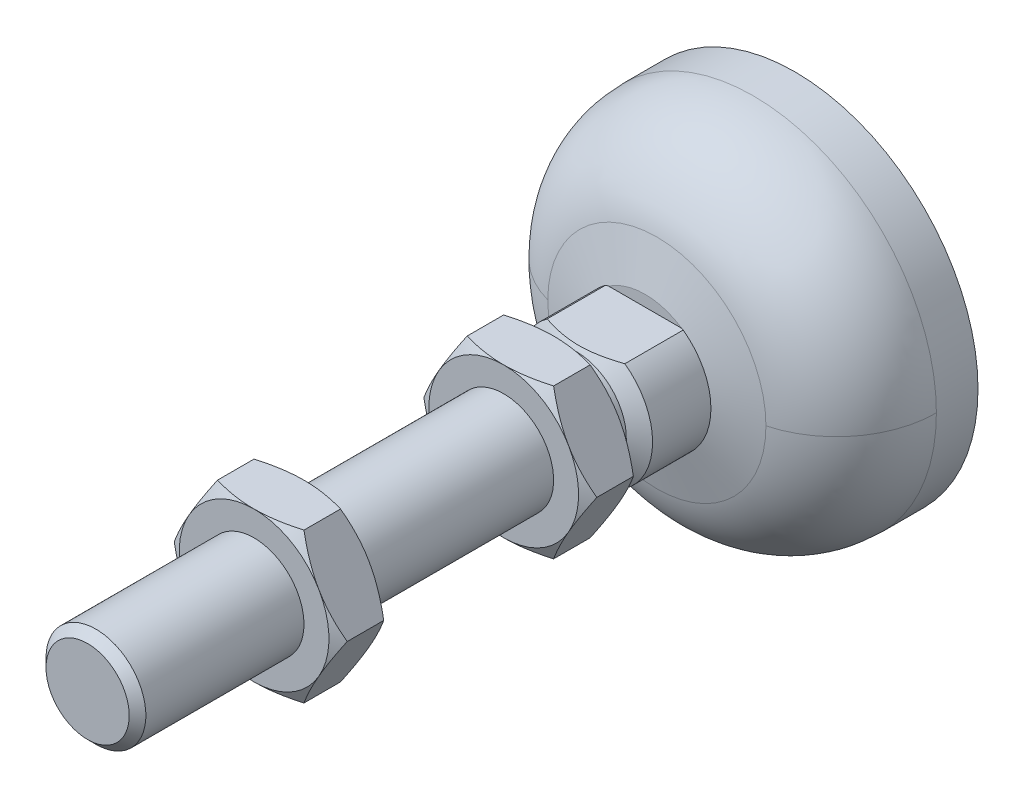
ISO-10303-21;
HEADER;
FILE_DESCRIPTION(('STEP AP214'),'2;1');
FILE_NAME('part.step','',(''),(''),'','','');
FILE_SCHEMA(('AUTOMOTIVE_DESIGN { 1 0 10303 214 1 1 1 1 }'));
ENDSEC;
DATA;
#1=APPLICATION_CONTEXT('core data for automotive mechanical design processes');
#2=APPLICATION_PROTOCOL_DEFINITION('international standard','automotive_design',2000,#1);
#3=PRODUCT_CONTEXT('',#1,'mechanical');
#4=PRODUCT('Part','Part','',(#3));
#5=PRODUCT_RELATED_PRODUCT_CATEGORY('part','',(#4));
#6=PRODUCT_DEFINITION_FORMATION('','',#4);
#7=PRODUCT_DEFINITION_CONTEXT('part definition',#1,'design');
#8=PRODUCT_DEFINITION('design','',#6,#7);
#9=PRODUCT_DEFINITION_SHAPE('','',#8);
#10=(LENGTH_UNIT() NAMED_UNIT(*) SI_UNIT(.MILLI.,.METRE.));
#11=(NAMED_UNIT(*) PLANE_ANGLE_UNIT() SI_UNIT($,.RADIAN.));
#12=(NAMED_UNIT(*) SI_UNIT($,.STERADIAN.) SOLID_ANGLE_UNIT());
#13=UNCERTAINTY_MEASURE_WITH_UNIT(LENGTH_MEASURE(1.E-05),#10,'distance_accuracy_value','');
#14=(GEOMETRIC_REPRESENTATION_CONTEXT(3) GLOBAL_UNCERTAINTY_ASSIGNED_CONTEXT((#13)) GLOBAL_UNIT_ASSIGNED_CONTEXT((#10,
#11,#12)) REPRESENTATION_CONTEXT('',''));
#15=CARTESIAN_POINT('',(0.,0.,0.));
#16=DIRECTION('',(0.,0.,1.));
#17=DIRECTION('',(1.,0.,0.));
#18=AXIS2_PLACEMENT_3D('',#15,#16,#17);
#19=CARTESIAN_POINT('',(0.,0.,85.));
#20=DIRECTION('',(0.,0.,1.));
#21=DIRECTION('',(1.,0.,0.));
#22=AXIS2_PLACEMENT_3D('',#19,#20,#21);
#23=PLANE('',#22);
#24=CARTESIAN_POINT('',(0.,0.,84.9999999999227));
#25=DIRECTION('',(0.,0.,-1.));
#26=DIRECTION('',(-1.,0.,0.));
#27=AXIS2_PLACEMENT_3D('',#24,#25,#26);
#28=CIRCLE('',#27,5.0000000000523);
#29=CARTESIAN_POINT('',(-5.0000000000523,0.,84.9999999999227));
#30=VERTEX_POINT('',#29);
#31=EDGE_CURVE('E508',#30,#30,#28,.T.);
#32=ORIENTED_EDGE('',*,*,#31,.F.);
#33=EDGE_LOOP('',(#32));
#34=FACE_BOUND('',#33,.T.);
#35=ADVANCED_FACE('F17',(#34),#23,.T.);
#36=CARTESIAN_POINT('',(0.,0.,84.0000000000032));
#37=DIRECTION('',(0.,0.,-1.));
#38=DIRECTION('',(-1.,0.,0.));
#39=AXIS2_PLACEMENT_3D('',#36,#37,#38);
#40=CONICAL_SURFACE('',#39,5.99999999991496,0.785398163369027);
#41=CARTESIAN_POINT('',(0.,0.,84.));
#42=DIRECTION('',(0.,0.,-1.));
#43=DIRECTION('',(-1.,0.,0.));
#44=AXIS2_PLACEMENT_3D('',#41,#42,#43);
#45=CIRCLE('',#44,6.);
#46=CARTESIAN_POINT('',(-6.,0.,84.));
#47=VERTEX_POINT('',#46);
#48=EDGE_CURVE('E505',#47,#47,#45,.T.);
#49=ORIENTED_EDGE('',*,*,#48,.F.);
#50=EDGE_LOOP('',(#49));
#51=FACE_BOUND('',#50,.T.);
#52=ORIENTED_EDGE('',*,*,#31,.T.);
#53=EDGE_LOOP('',(#52));
#54=FACE_BOUND('',#53,.T.);
#55=ADVANCED_FACE('F1213',(#51,#54),#40,.T.);
#56=CARTESIAN_POINT('',(0.,0.,7.236207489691));
#57=DIRECTION('',(0.,0.,-1.));
#58=DIRECTION('',(-1.,0.,0.));
#59=AXIS2_PLACEMENT_3D('',#56,#57,#58);
#60=CYLINDRICAL_SURFACE('',#59,6.);
#61=ORIENTED_EDGE('',*,*,#48,.T.);
#62=EDGE_LOOP('',(#61));
#63=FACE_BOUND('',#62,.T.);
#64=CARTESIAN_POINT('',(0.,0.,65.));
#65=DIRECTION('',(0.,0.,-1.));
#66=DIRECTION('',(-1.,0.,0.));
#67=AXIS2_PLACEMENT_3D('',#64,#65,#66);
#68=CIRCLE('',#67,6.);
#69=CARTESIAN_POINT('',(-6.,0.,65.));
#70=VERTEX_POINT('',#69);
#71=EDGE_CURVE('E248',#70,#70,#68,.F.);
#72=ORIENTED_EDGE('',*,*,#71,.T.);
#73=EDGE_LOOP('',(#72));
#74=FACE_BOUND('',#73,.T.);
#75=ADVANCED_FACE('F1206',(#63,#74),#60,.T.);
#76=CARTESIAN_POINT('',(0.,0.,65.));
#77=DIRECTION('',(0.,0.,-1.));
#78=DIRECTION('',(-1.,0.,0.));
#79=AXIS2_PLACEMENT_3D('',#76,#77,#78);
#80=PLANE('',#79);
#81=ORIENTED_EDGE('',*,*,#71,.F.);
#82=EDGE_LOOP('',(#81));
#83=FACE_BOUND('',#82,.T.);
#84=CARTESIAN_POINT('',(0.,0.,64.999999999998));
#85=DIRECTION('',(0.,0.,-1.));
#86=DIRECTION('',(-1.,0.,0.));
#87=AXIS2_PLACEMENT_3D('',#84,#85,#86);
#88=CIRCLE('',#87,8.99999999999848);
#89=CARTESIAN_POINT('',(-7.7942286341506,4.49999999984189,64.9999999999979));
#90=VERTEX_POINT('',#89);
#91=CARTESIAN_POINT('',(-1.82153567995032E-10,8.99999999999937,64.9999999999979));
#92=VERTEX_POINT('',#91);
#93=EDGE_CURVE('E228',#90,#92,#88,.T.);
#94=ORIENTED_EDGE('',*,*,#93,.F.);
#95=CARTESIAN_POINT('',(0.,0.,64.9999999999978));
#96=DIRECTION('',(0.,0.,-1.));
#97=DIRECTION('',(-1.,0.,0.));
#98=AXIS2_PLACEMENT_3D('',#95,#96,#97);
#99=CIRCLE('',#98,8.99999999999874);
#100=CARTESIAN_POINT('',(-7.79422863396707,-4.500000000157,64.9999999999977));
#101=VERTEX_POINT('',#100);
#102=EDGE_CURVE('E224',#101,#90,#99,.T.);
#103=ORIENTED_EDGE('',*,*,#102,.F.);
#104=CARTESIAN_POINT('',(0.,0.,64.9999999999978));
#105=DIRECTION('',(0.,0.,-1.));
#106=DIRECTION('',(-1.,0.,0.));
#107=AXIS2_PLACEMENT_3D('',#104,#105,#106);
#108=CIRCLE('',#107,8.99999999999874);
#109=CARTESIAN_POINT('',(1.82155118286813E-10,-8.99999999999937,64.9999999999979));
#110=VERTEX_POINT('',#109);
#111=EDGE_CURVE('E221',#110,#101,#108,.T.);
#112=ORIENTED_EDGE('',*,*,#111,.F.);
#113=CARTESIAN_POINT('',(0.,0.,64.999999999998));
#114=DIRECTION('',(0.,0.,-1.));
#115=DIRECTION('',(-1.,0.,0.));
#116=AXIS2_PLACEMENT_3D('',#113,#114,#115);
#117=CIRCLE('',#116,8.99999999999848);
#118=CARTESIAN_POINT('',(7.7942286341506,-4.49999999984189,64.9999999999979));
#119=VERTEX_POINT('',#118);
#120=EDGE_CURVE('E1075',#119,#110,#117,.T.);
#121=ORIENTED_EDGE('',*,*,#120,.F.);
#122=CARTESIAN_POINT('',(0.,0.,64.9999999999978));
#123=DIRECTION('',(0.,0.,-1.));
#124=DIRECTION('',(-1.,0.,0.));
#125=AXIS2_PLACEMENT_3D('',#122,#123,#124);
#126=CIRCLE('',#125,8.99999999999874);
#127=CARTESIAN_POINT('',(7.79422863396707,4.500000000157,64.9999999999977));
#128=VERTEX_POINT('',#127);
#129=EDGE_CURVE('E291',#128,#119,#126,.T.);
#130=ORIENTED_EDGE('',*,*,#129,.F.);
#131=CARTESIAN_POINT('',(0.,0.,64.9999999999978));
#132=DIRECTION('',(0.,0.,-1.));
#133=DIRECTION('',(-1.,0.,0.));
#134=AXIS2_PLACEMENT_3D('',#131,#132,#133);
#135=CIRCLE('',#134,8.99999999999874);
#136=EDGE_CURVE('E1073',#92,#128,#135,.T.);
#137=ORIENTED_EDGE('',*,*,#136,.F.);
#138=EDGE_LOOP('',(#94,#103,#112,#121,#130,#137));
#139=FACE_BOUND('',#138,.T.);
#140=ADVANCED_FACE('F226',(#83,#139),#80,.F.);
#141=CARTESIAN_POINT('',(0.,0.,64.1913293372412));
#142=DIRECTION('',(0.,0.,-1.));
#143=DIRECTION('',(-1.,0.,0.));
#144=AXIS2_PLACEMENT_3D('',#141,#142,#143);
#145=CONICAL_SURFACE('',#144,10.400658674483,1.0471975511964);
#146=ORIENTED_EDGE('',*,*,#111,.T.);
#147=CARTESIAN_POINT('',(-7.79422863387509,-4.50000000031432,64.9999999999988));
#148=CARTESIAN_POINT('',(-7.68395487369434,-4.69099975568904,65.0000367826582));
#149=CARTESIAN_POINT('',(-7.57368642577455,-4.88199030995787,64.9953203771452));
#150=CARTESIAN_POINT('',(-7.35336604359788,-5.26359640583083,64.9766545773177));
#151=CARTESIAN_POINT('',(-7.24331407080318,-5.45421201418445,64.9627070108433));
#152=CARTESIAN_POINT('',(-7.02413748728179,-5.83383699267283,64.9259441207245));
#153=CARTESIAN_POINT('',(-6.91501099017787,-6.02284963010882,64.9031734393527));
#154=CARTESIAN_POINT('',(-6.69727791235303,-6.39997438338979,64.8492541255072));
#155=CARTESIAN_POINT('',(-6.58867134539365,-6.58808647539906,64.8181052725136));
#156=CARTESIAN_POINT('',(-6.26408172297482,-7.15029219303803,64.7130537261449));
#157=CARTESIAN_POINT('',(-6.04904161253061,-7.52275258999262,64.6274950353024));
#158=CARTESIAN_POINT('',(-5.62081064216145,-8.2644703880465,64.430174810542));
#159=CARTESIAN_POINT('',(-5.40763471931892,-8.63370191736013,64.3182824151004));
#160=CARTESIAN_POINT('',(-5.19615242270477,-8.99999999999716,64.1961524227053));
#161=B_SPLINE_CURVE_WITH_KNOTS('',3,(#147,#148,#149,#150,#151,#152,#153,#154,#155,#156,#157,
#158,#159,#160),.UNSPECIFIED.,.F.,.F.,(4,2,2,2,2,2,4),(0.,0.661575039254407,1.3230191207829,
1.98115930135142,2.6393168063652,3.95390679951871,5.27517278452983),.UNSPECIFIED.);
#162=CARTESIAN_POINT('',(-5.19615242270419,-8.99999999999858,64.1961524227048));
#163=VERTEX_POINT('',#162);
#164=EDGE_CURVE('E240',#101,#163,#161,.T.);
#165=ORIENTED_EDGE('',*,*,#164,.T.);
#166=CARTESIAN_POINT('',(-5.1961524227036,-9.,64.1961524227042));
#167=CARTESIAN_POINT('',(-4.77318782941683,-9.,64.3182824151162));
#168=CARTESIAN_POINT('',(-4.34683598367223,-9.,64.4301748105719));
#169=CARTESIAN_POINT('',(-3.4903740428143,-9.,64.6274950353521));
#170=CARTESIAN_POINT('',(-3.06029382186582,-9.,64.7130537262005));
#171=CARTESIAN_POINT('',(-2.41111457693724,-9.,64.8181052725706));
#172=CARTESIAN_POINT('',(-2.19390144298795,-9.,64.8492541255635));
#173=CARTESIAN_POINT('',(-1.75843528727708,-9.,64.9031734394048));
#174=CARTESIAN_POINT('',(-1.54018229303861,-9.,64.9259441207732));
#175=CARTESIAN_POINT('',(-1.1018291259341,-9.,64.9627070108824));
#176=CARTESIAN_POINT('',(-0.881725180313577,-9.,64.9766545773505));
#177=CARTESIAN_POINT('',(-0.441084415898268,-9.,64.9953203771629));
#178=CARTESIAN_POINT('',(-0.220547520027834,-9.,65.0000367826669));
#179=CARTESIAN_POINT('',(3.64309417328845E-10,-9.,64.9999999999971));
#180=B_SPLINE_CURVE_WITH_KNOTS('',3,(#166,#167,#168,#169,#170,#171,#172,#173,#174,#175,#176,
#177,#178,#179),.UNSPECIFIED.,.F.,.F.,(4,2,2,2,2,2,4),(0.,1.32126598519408,2.63585597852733,
3.2940134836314,3.9521536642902,4.61359774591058,5.27517278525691),.UNSPECIFIED.);
#181=EDGE_CURVE('E246',#163,#110,#180,.T.);
#182=ORIENTED_EDGE('',*,*,#181,.T.);
#183=EDGE_LOOP('',(#146,#165,#182));
#184=FACE_BOUND('',#183,.T.);
#185=ADVANCED_FACE('F244',(#184),#145,.T.);
#186=CARTESIAN_POINT('',(0.,0.,64.1913293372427));
#187=DIRECTION('',(0.,0.,-1.));
#188=DIRECTION('',(-1.,0.,0.));
#189=AXIS2_PLACEMENT_3D('',#186,#187,#188);
#190=CONICAL_SURFACE('',#189,10.4006586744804,1.0471975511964);
#191=ORIENTED_EDGE('',*,*,#102,.T.);
#192=CARTESIAN_POINT('',(-7.79422863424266,4.49999999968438,64.9999999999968));
#193=CARTESIAN_POINT('',(-7.90450239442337,4.30900024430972,65.0000367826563));
#194=CARTESIAN_POINT('',(-8.01477084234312,4.11800969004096,64.9953203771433));
#195=CARTESIAN_POINT('',(-8.23509122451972,3.73640359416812,64.9766545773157));
#196=CARTESIAN_POINT('',(-8.34514319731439,3.54578798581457,64.9627070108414));
#197=CARTESIAN_POINT('',(-8.5643197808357,3.16616300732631,64.9259441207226));
#198=CARTESIAN_POINT('',(-8.67344627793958,2.97715036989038,64.9031734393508));
#199=CARTESIAN_POINT('',(-8.89117935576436,2.60002561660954,64.8492541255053));
#200=CARTESIAN_POINT('',(-8.99978592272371,2.41191352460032,64.8181052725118));
#201=CARTESIAN_POINT('',(-9.32437554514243,1.84970780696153,64.7130537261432));
#202=CARTESIAN_POINT('',(-9.53941565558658,1.47724741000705,64.6274950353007));
#203=CARTESIAN_POINT('',(-9.96764662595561,0.735529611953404,64.4301748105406));
#204=CARTESIAN_POINT('',(-10.1808225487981,0.366298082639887,64.318282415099));
#205=CARTESIAN_POINT('',(-10.3923048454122,2.96378191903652E-12,64.196152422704));
#206=B_SPLINE_CURVE_WITH_KNOTS('',3,(#192,#193,#194,#195,#196,#197,#198,#199,#200,#201,#202,
#203,#204,#205),.UNSPECIFIED.,.F.,.F.,(4,2,2,2,2,2,4),(0.,0.661575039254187,1.32301912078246,
1.98115930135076,2.63931680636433,3.95390679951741,5.2751727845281),.UNSPECIFIED.);
#207=CARTESIAN_POINT('',(-10.3923048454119,0.,64.1961524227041));
#208=VERTEX_POINT('',#207);
#209=EDGE_CURVE('E236',#90,#208,#206,.T.);
#210=ORIENTED_EDGE('',*,*,#209,.T.);
#211=CARTESIAN_POINT('',(-10.3923048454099,-1.32433121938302E-13,64.1961524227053));
#212=CARTESIAN_POINT('',(-10.1808225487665,-0.366298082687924,64.3182824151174));
#213=CARTESIAN_POINT('',(-9.9676466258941,-0.735529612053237,64.4301748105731));
#214=CARTESIAN_POINT('',(-9.539415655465,-1.47724741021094,64.6274950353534));
#215=CARTESIAN_POINT('',(-9.32437554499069,-1.84970780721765,64.713053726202));
#216=CARTESIAN_POINT('',(-8.99978592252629,-2.41191352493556,64.8181052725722));
#217=CARTESIAN_POINT('',(-8.89117935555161,-2.60002561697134,64.849254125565));
#218=CARTESIAN_POINT('',(-8.6734462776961,-2.97715037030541,64.9031734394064));
#219=CARTESIAN_POINT('',(-8.56431978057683,-3.166163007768,64.9259441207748));
#220=CARTESIAN_POINT('',(-8.34514319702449,-3.54578798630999,64.962707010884));
#221=CARTESIAN_POINT('',(-8.23509122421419,-3.73640359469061,64.9766545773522));
#222=CARTESIAN_POINT('',(-8.01477084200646,-4.11800969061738,64.9953203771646));
#223=CARTESIAN_POINT('',(-7.9045023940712,-4.309000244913,65.0000367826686));
#224=CARTESIAN_POINT('',(-7.79422863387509,-4.50000000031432,64.9999999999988));
#225=B_SPLINE_CURVE_WITH_KNOTS('',3,(#211,#212,#213,#214,#215,#216,#217,#218,#219,#220,#221,
#222,#223,#224),.UNSPECIFIED.,.F.,.F.,(4,2,2,2,2,2,4),(0.,1.32126598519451,2.63585597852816,
3.29401348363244,3.95215366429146,4.61359774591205,5.27517278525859),.UNSPECIFIED.);
#226=EDGE_CURVE('E234',#208,#101,#225,.T.);
#227=ORIENTED_EDGE('',*,*,#226,.T.);
#228=EDGE_LOOP('',(#191,#210,#227));
#229=FACE_BOUND('',#228,.T.);
#230=ADVANCED_FACE('F235',(#229),#190,.T.);
#231=CARTESIAN_POINT('',(0.,0.,64.1913293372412));
#232=DIRECTION('',(0.,0.,-1.));
#233=DIRECTION('',(-1.,0.,0.));
#234=AXIS2_PLACEMENT_3D('',#231,#232,#233);
#235=CONICAL_SURFACE('',#234,10.400658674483,1.0471975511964);
#236=ORIENTED_EDGE('',*,*,#93,.T.);
#237=CARTESIAN_POINT('',(-3.64306953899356E-10,9.,64.9999999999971));
#238=CARTESIAN_POINT('',(-0.220547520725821,9.,65.0000367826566));
#239=CARTESIAN_POINT('',(-0.441084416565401,9.,64.9953203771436));
#240=CARTESIAN_POINT('',(-0.88172518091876,9.,64.976654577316));
#241=CARTESIAN_POINT('',(-1.10182912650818,9.,64.9627070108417));
#242=CARTESIAN_POINT('',(-1.54018229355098,9.,64.9259441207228));
#243=CARTESIAN_POINT('',(-1.75843528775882,9.,64.9031734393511));
#244=CARTESIAN_POINT('',(-2.19390144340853,9.,64.8492541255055));
#245=CARTESIAN_POINT('',(-2.41111457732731,9.,64.8181052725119));
#246=CARTESIAN_POINT('',(-3.06029382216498,9.,64.7130537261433));
#247=CARTESIAN_POINT('',(-3.49037404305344,9.,64.6274950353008));
#248=CARTESIAN_POINT('',(-4.34683598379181,9.,64.4301748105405));
#249=CARTESIAN_POINT('',(-4.77318782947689,9.,64.3182824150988));
#250=CARTESIAN_POINT('',(-5.1961524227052,9.,64.1961524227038));
#251=B_SPLINE_CURVE_WITH_KNOTS('',3,(#237,#238,#239,#240,#241,#242,#243,#244,#245,#246,#247,
#248,#249,#250),.UNSPECIFIED.,.F.,.F.,(4,2,2,2,2,2,4),(0.,0.661575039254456,1.323019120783,
1.98115930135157,2.6393168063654,3.95390679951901,5.27517278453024),.UNSPECIFIED.);
#252=CARTESIAN_POINT('',(-5.19615242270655,8.99999999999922,64.1961524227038));
#253=VERTEX_POINT('',#252);
#254=EDGE_CURVE('E402',#92,#253,#251,.T.);
#255=ORIENTED_EDGE('',*,*,#254,.T.);
#256=CARTESIAN_POINT('',(-5.1961524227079,8.99999999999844,64.1961524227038));
#257=CARTESIAN_POINT('',(-5.40763471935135,8.63370191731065,64.3182824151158));
#258=CARTESIAN_POINT('',(-5.62081064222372,8.26447038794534,64.4301748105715));
#259=CARTESIAN_POINT('',(-6.04904161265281,7.52275258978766,64.6274950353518));
#260=CARTESIAN_POINT('',(-6.26408172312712,7.15029219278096,64.7130537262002));
#261=CARTESIAN_POINT('',(-6.58867134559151,6.58808647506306,64.8181052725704));
#262=CARTESIAN_POINT('',(-6.69727791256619,6.39997438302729,64.8492541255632));
#263=CARTESIAN_POINT('',(-6.91501099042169,6.02284962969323,64.9031734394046));
#264=CARTESIAN_POINT('',(-7.02413748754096,5.83383699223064,64.925944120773));
#265=CARTESIAN_POINT('',(-7.24331407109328,5.45421201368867,64.9627070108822));
#266=CARTESIAN_POINT('',(-7.35336604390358,5.26359640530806,64.9766545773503));
#267=CARTESIAN_POINT('',(-7.5736864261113,4.8819903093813,64.9953203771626));
#268=CARTESIAN_POINT('',(-7.68395487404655,4.69099975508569,65.0000367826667));
#269=CARTESIAN_POINT('',(-7.79422863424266,4.49999999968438,64.9999999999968));
#270=B_SPLINE_CURVE_WITH_KNOTS('',3,(#256,#257,#258,#259,#260,#261,#262,#263,#264,#265,#266,
#267,#268,#269),.UNSPECIFIED.,.F.,.F.,(4,2,2,2,2,2,4),(0.,1.32126598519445,2.63585597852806,
3.29401348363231,3.95215366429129,4.61359774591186,5.27517278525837),.UNSPECIFIED.);
#271=EDGE_CURVE('E255',#253,#90,#270,.T.);
#272=ORIENTED_EDGE('',*,*,#271,.T.);
#273=EDGE_LOOP('',(#236,#255,#272));
#274=FACE_BOUND('',#273,.T.);
#275=ADVANCED_FACE('F390',(#274),#235,.T.);
#276=CARTESIAN_POINT('',(0.,0.,64.1913293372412));
#277=DIRECTION('',(0.,0.,-1.));
#278=DIRECTION('',(-1.,0.,0.));
#279=AXIS2_PLACEMENT_3D('',#276,#277,#278);
#280=CONICAL_SURFACE('',#279,10.400658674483,1.0471975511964);
#281=ORIENTED_EDGE('',*,*,#136,.T.);
#282=CARTESIAN_POINT('',(7.79422863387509,4.50000000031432,64.9999999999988));
#283=CARTESIAN_POINT('',(7.68395487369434,4.69099975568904,65.0000367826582));
#284=CARTESIAN_POINT('',(7.57368642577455,4.88199030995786,64.9953203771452));
#285=CARTESIAN_POINT('',(7.35336604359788,5.26359640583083,64.9766545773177));
#286=CARTESIAN_POINT('',(7.24331407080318,5.45421201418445,64.9627070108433));
#287=CARTESIAN_POINT('',(7.02413748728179,5.83383699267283,64.9259441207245));
#288=CARTESIAN_POINT('',(6.91501099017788,6.02284963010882,64.9031734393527));
#289=CARTESIAN_POINT('',(6.69727791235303,6.39997438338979,64.8492541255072));
#290=CARTESIAN_POINT('',(6.58867134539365,6.58808647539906,64.8181052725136));
#291=CARTESIAN_POINT('',(6.26408172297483,7.15029219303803,64.7130537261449));
#292=CARTESIAN_POINT('',(6.04904161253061,7.52275258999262,64.6274950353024));
#293=CARTESIAN_POINT('',(5.62081064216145,8.2644703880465,64.4301748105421));
#294=CARTESIAN_POINT('',(5.40763471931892,8.63370191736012,64.3182824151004));
#295=CARTESIAN_POINT('',(5.19615242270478,8.99999999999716,64.1961524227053));
#296=B_SPLINE_CURVE_WITH_KNOTS('',3,(#282,#283,#284,#285,#286,#287,#288,#289,#290,#291,#292,
#293,#294,#295),.UNSPECIFIED.,.F.,.F.,(4,2,2,2,2,2,4),(0.,0.661575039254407,1.3230191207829,
1.98115930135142,2.6393168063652,3.9539067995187,5.27517278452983),.UNSPECIFIED.);
#297=CARTESIAN_POINT('',(5.19615242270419,8.99999999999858,64.1961524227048));
#298=VERTEX_POINT('',#297);
#299=EDGE_CURVE('E375',#128,#298,#296,.T.);
#300=ORIENTED_EDGE('',*,*,#299,.T.);
#301=CARTESIAN_POINT('',(5.1961524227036,9.,64.1961524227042));
#302=CARTESIAN_POINT('',(4.77318782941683,9.,64.3182824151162));
#303=CARTESIAN_POINT('',(4.34683598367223,9.,64.4301748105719));
#304=CARTESIAN_POINT('',(3.4903740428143,9.,64.6274950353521));
#305=CARTESIAN_POINT('',(3.06029382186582,9.,64.7130537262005));
#306=CARTESIAN_POINT('',(2.41111457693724,9.,64.8181052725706));
#307=CARTESIAN_POINT('',(2.19390144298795,9.,64.8492541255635));
#308=CARTESIAN_POINT('',(1.75843528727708,9.,64.9031734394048));
#309=CARTESIAN_POINT('',(1.54018229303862,9.,64.9259441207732));
#310=CARTESIAN_POINT('',(1.1018291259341,9.,64.9627070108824));
#311=CARTESIAN_POINT('',(0.88172518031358,9.,64.9766545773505));
#312=CARTESIAN_POINT('',(0.441084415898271,9.,64.9953203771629));
#313=CARTESIAN_POINT('',(0.220547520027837,9.,65.0000367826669));
#314=CARTESIAN_POINT('',(-3.64305920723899E-10,9.,64.9999999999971));
#315=B_SPLINE_CURVE_WITH_KNOTS('',3,(#301,#302,#303,#304,#305,#306,#307,#308,#309,#310,#311,
#312,#313,#314),.UNSPECIFIED.,.F.,.F.,(4,2,2,2,2,2,4),(0.,1.32126598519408,2.63585597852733,
3.29401348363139,3.9521536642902,4.61359774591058,5.27517278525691),.UNSPECIFIED.);
#316=EDGE_CURVE('E395',#298,#92,#315,.T.);
#317=ORIENTED_EDGE('',*,*,#316,.T.);
#318=EDGE_LOOP('',(#281,#300,#317));
#319=FACE_BOUND('',#318,.T.);
#320=ADVANCED_FACE('F385',(#319),#280,.T.);
#321=CARTESIAN_POINT('',(0.,0.,64.1913293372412));
#322=DIRECTION('',(0.,0.,-1.));
#323=DIRECTION('',(-1.,0.,0.));
#324=AXIS2_PLACEMENT_3D('',#321,#322,#323);
#325=CONICAL_SURFACE('',#324,10.400658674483,1.0471975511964);
#326=ORIENTED_EDGE('',*,*,#120,.T.);
#327=CARTESIAN_POINT('',(3.64310203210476E-10,-9.,64.9999999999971));
#328=CARTESIAN_POINT('',(0.220547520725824,-9.,65.0000367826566));
#329=CARTESIAN_POINT('',(0.441084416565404,-9.,64.9953203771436));
#330=CARTESIAN_POINT('',(0.881725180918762,-9.,64.976654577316));
#331=CARTESIAN_POINT('',(1.10182912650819,-9.,64.9627070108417));
#332=CARTESIAN_POINT('',(1.54018229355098,-9.,64.9259441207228));
#333=CARTESIAN_POINT('',(1.75843528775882,-9.,64.9031734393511));
#334=CARTESIAN_POINT('',(2.19390144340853,-9.,64.8492541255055));
#335=CARTESIAN_POINT('',(2.4111145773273,-9.,64.8181052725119));
#336=CARTESIAN_POINT('',(3.06029382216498,-9.,64.7130537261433));
#337=CARTESIAN_POINT('',(3.49037404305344,-9.,64.6274950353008));
#338=CARTESIAN_POINT('',(4.3468359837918,-9.,64.4301748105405));
#339=CARTESIAN_POINT('',(4.77318782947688,-9.,64.3182824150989));
#340=CARTESIAN_POINT('',(5.1961524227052,-9.,64.1961524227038));
#341=B_SPLINE_CURVE_WITH_KNOTS('',3,(#327,#328,#329,#330,#331,#332,#333,#334,#335,#336,#337,
#338,#339,#340),.UNSPECIFIED.,.F.,.F.,(4,2,2,2,2,2,4),(0.,0.661575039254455,1.323019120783,
1.98115930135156,2.63931680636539,3.953906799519,5.27517278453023),.UNSPECIFIED.);
#342=CARTESIAN_POINT('',(5.1961524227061,-9.,64.1961524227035));
#343=VERTEX_POINT('',#342);
#344=EDGE_CURVE('E241',#110,#343,#341,.T.);
#345=ORIENTED_EDGE('',*,*,#344,.T.);
#346=CARTESIAN_POINT('',(5.1961524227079,-8.99999999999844,64.1961524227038));
#347=CARTESIAN_POINT('',(5.40763471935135,-8.63370191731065,64.3182824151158));
#348=CARTESIAN_POINT('',(5.62081064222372,-8.26447038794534,64.4301748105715));
#349=CARTESIAN_POINT('',(6.04904161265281,-7.52275258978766,64.6274950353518));
#350=CARTESIAN_POINT('',(6.26408172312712,-7.15029219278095,64.7130537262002));
#351=CARTESIAN_POINT('',(6.58867134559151,-6.58808647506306,64.8181052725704));
#352=CARTESIAN_POINT('',(6.69727791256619,-6.39997438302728,64.8492541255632));
#353=CARTESIAN_POINT('',(6.91501099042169,-6.02284962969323,64.9031734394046));
#354=CARTESIAN_POINT('',(7.02413748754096,-5.83383699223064,64.925944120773));
#355=CARTESIAN_POINT('',(7.24331407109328,-5.45421201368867,64.9627070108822));
#356=CARTESIAN_POINT('',(7.35336604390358,-5.26359640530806,64.9766545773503));
#357=CARTESIAN_POINT('',(7.5736864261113,-4.8819903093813,64.9953203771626));
#358=CARTESIAN_POINT('',(7.68395487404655,-4.69099975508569,65.0000367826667));
#359=CARTESIAN_POINT('',(7.79422863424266,-4.49999999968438,64.9999999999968));
#360=B_SPLINE_CURVE_WITH_KNOTS('',3,(#346,#347,#348,#349,#350,#351,#352,#353,#354,#355,#356,
#357,#358,#359),.UNSPECIFIED.,.F.,.F.,(4,2,2,2,2,2,4),(0.,1.32126598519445,2.63585597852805,
3.2940134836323,3.95215366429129,4.61359774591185,5.27517278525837),.UNSPECIFIED.);
#361=EDGE_CURVE('E367',#343,#119,#360,.T.);
#362=ORIENTED_EDGE('',*,*,#361,.T.);
#363=EDGE_LOOP('',(#326,#345,#362));
#364=FACE_BOUND('',#363,.T.);
#365=ADVANCED_FACE('F382',(#364),#325,.T.);
#366=CARTESIAN_POINT('',(0.,0.,64.1913293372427));
#367=DIRECTION('',(0.,0.,-1.));
#368=DIRECTION('',(-1.,0.,0.));
#369=AXIS2_PLACEMENT_3D('',#366,#367,#368);
#370=CONICAL_SURFACE('',#369,10.4006586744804,1.0471975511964);
#371=ORIENTED_EDGE('',*,*,#129,.T.);
#372=CARTESIAN_POINT('',(7.79422863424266,-4.49999999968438,64.9999999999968));
#373=CARTESIAN_POINT('',(7.90450239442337,-4.30900024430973,65.0000367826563));
#374=CARTESIAN_POINT('',(8.01477084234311,-4.11800969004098,64.9953203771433));
#375=CARTESIAN_POINT('',(8.2350912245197,-3.73640359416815,64.9766545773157));
#376=CARTESIAN_POINT('',(8.34514319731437,-3.54578798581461,64.9627070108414));
#377=CARTESIAN_POINT('',(8.56431978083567,-3.16616300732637,64.9259441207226));
#378=CARTESIAN_POINT('',(8.67344627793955,-2.97715036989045,64.9031734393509));
#379=CARTESIAN_POINT('',(8.89117935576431,-2.60002561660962,64.8492541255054));
#380=CARTESIAN_POINT('',(8.99978592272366,-2.41191352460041,64.8181052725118));
#381=CARTESIAN_POINT('',(9.32437554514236,-1.84970780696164,64.7130537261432));
#382=CARTESIAN_POINT('',(9.5394156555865,-1.47724741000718,64.6274950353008));
#383=CARTESIAN_POINT('',(9.96764662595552,-0.735529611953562,64.4301748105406));
#384=CARTESIAN_POINT('',(10.180822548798,-0.366298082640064,64.3182824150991));
#385=CARTESIAN_POINT('',(10.392304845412,-3.15724820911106E-12,64.1961524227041));
#386=B_SPLINE_CURVE_WITH_KNOTS('',3,(#372,#373,#374,#375,#376,#377,#378,#379,#380,#381,#382,
#383,#384,#385),.UNSPECIFIED.,.F.,.F.,(4,2,2,2,2,2,4),(0.,0.661575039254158,1.3230191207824,
1.98115930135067,2.63931680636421,3.95390679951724,5.27517278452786),.UNSPECIFIED.);
#387=CARTESIAN_POINT('',(10.3923048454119,0.,64.1961524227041));
#388=VERTEX_POINT('',#387);
#389=EDGE_CURVE('E361',#119,#388,#386,.T.);
#390=ORIENTED_EDGE('',*,*,#389,.T.);
#391=CARTESIAN_POINT('',(10.39230484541,0.,64.1961524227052));
#392=CARTESIAN_POINT('',(10.1808225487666,0.366298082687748,64.3182824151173));
#393=CARTESIAN_POINT('',(9.9676466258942,0.735529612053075,64.430174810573));
#394=CARTESIAN_POINT('',(9.53941565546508,1.47724741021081,64.6274950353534));
#395=CARTESIAN_POINT('',(9.32437554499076,1.84970780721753,64.7130537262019));
#396=CARTESIAN_POINT('',(8.99978592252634,2.41191352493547,64.8181052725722));
#397=CARTESIAN_POINT('',(8.89117935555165,2.60002561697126,64.849254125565));
#398=CARTESIAN_POINT('',(8.67344627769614,2.97715037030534,64.9031734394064));
#399=CARTESIAN_POINT('',(8.56431978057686,3.16616300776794,64.9259441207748));
#400=CARTESIAN_POINT('',(8.34514319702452,3.54578798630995,64.962707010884));
#401=CARTESIAN_POINT('',(8.23509122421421,3.73640359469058,64.9766545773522));
#402=CARTESIAN_POINT('',(8.01477084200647,4.11800969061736,64.9953203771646));
#403=CARTESIAN_POINT('',(7.90450239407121,4.30900024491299,65.0000367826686));
#404=CARTESIAN_POINT('',(7.79422863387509,4.50000000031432,64.9999999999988));
#405=B_SPLINE_CURVE_WITH_KNOTS('',3,(#391,#392,#393,#394,#395,#396,#397,#398,#399,#400,#401,
#402,#403,#404),.UNSPECIFIED.,.F.,.F.,(4,2,2,2,2,2,4),(0.,1.32126598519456,2.63585597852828,
3.29401348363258,3.95215366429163,4.61359774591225,5.27517278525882),.UNSPECIFIED.);
#406=EDGE_CURVE('E503',#388,#128,#405,.T.);
#407=ORIENTED_EDGE('',*,*,#406,.T.);
#408=EDGE_LOOP('',(#371,#390,#407));
#409=FACE_BOUND('',#408,.T.);
#410=ADVANCED_FACE('F302',(#409),#370,.T.);
#411=CARTESIAN_POINT('',(-5.196152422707,-9.,29.));
#412=DIRECTION('',(0.,1.,0.));
#413=DIRECTION('',(0.,0.,1.));
#414=AXIS2_PLACEMENT_3D('',#411,#412,#413);
#415=PLANE('',#414);
#416=ORIENTED_EDGE('',*,*,#344,.F.);
#417=ORIENTED_EDGE('',*,*,#181,.F.);
#418=DIRECTION('',(0.,0.,1.));
#419=VECTOR('',#418,1.);
#420=CARTESIAN_POINT('',(-5.1961524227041,-8.99999999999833,29.));
#421=LINE('',#420,#419);
#422=CARTESIAN_POINT('',(-5.1961524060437,-9.00000002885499,59.803847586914));
#423=VERTEX_POINT('',#422);
#424=EDGE_CURVE('E253',#163,#423,#421,.F.);
#425=ORIENTED_EDGE('',*,*,#424,.T.);
#426=CARTESIAN_POINT('',(3.64304553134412E-10,-9.,59.0000000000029));
#427=CARTESIAN_POINT('',(-0.220547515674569,-9.,58.999963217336));
#428=CARTESIAN_POINT('',(-0.441084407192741,-9.,59.0046796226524));
#429=CARTESIAN_POINT('',(-0.881725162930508,-9.,59.0233454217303));
#430=CARTESIAN_POINT('',(-1.10182910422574,-9.,59.0372929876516));
#431=CARTESIAN_POINT('',(-1.54018226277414,-9.,59.0740558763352));
#432=CARTESIAN_POINT('',(-1.75843525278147,-9.,59.0968265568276));
#433=CARTESIAN_POINT('',(-2.19390140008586,-9.,59.1507458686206));
#434=CARTESIAN_POINT('',(-2.41111452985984,-9.,59.1818947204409));
#435=CARTESIAN_POINT('',(-3.06029376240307,-9.,59.286946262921));
#436=CARTESIAN_POINT('',(-3.49037397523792,-9.,59.3725049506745));
#437=CARTESIAN_POINT('',(-4.346835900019,-9.,59.5698251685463));
#438=CARTESIAN_POINT('',(-4.7731877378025,-9.,59.6817175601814));
#439=CARTESIAN_POINT('',(-5.19615232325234,-9.,59.8038475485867));
#440=B_SPLINE_CURVE_WITH_KNOTS('',3,(#426,#427,#428,#429,#430,#431,#432,#433,#434,#435,#436,
#437,#438,#439),.UNSPECIFIED.,.F.,.F.,(4,2,2,2,2,2,4),(0.,0.661575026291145,1.32301909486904,
1.98115926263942,2.6393167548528,3.95390672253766,5.27517268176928),.UNSPECIFIED.);
#441=CARTESIAN_POINT('',(3.64301744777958E-10,-8.99999999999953,59.0000000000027));
#442=VERTEX_POINT('',#441);
#443=EDGE_CURVE('E308',#442,#423,#440,.T.);
#444=ORIENTED_EDGE('',*,*,#443,.F.);
#445=CARTESIAN_POINT('',(5.19615248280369,-8.99999996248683,59.8038476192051));
#446=CARTESIAN_POINT('',(4.77318788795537,-8.99999998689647,59.6817176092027));
#447=CARTESIAN_POINT('',(4.34683603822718,-8.99999999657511,59.5698252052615));
#448=CARTESIAN_POINT('',(3.49037408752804,-9.00000000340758,59.3725049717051));
#449=CARTESIAN_POINT('',(3.06029386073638,-9.00000000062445,59.2869462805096));
#450=CARTESIAN_POINT('',(2.41111460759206,-8.99999999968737,59.1818947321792));
#451=CARTESIAN_POINT('',(2.19390147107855,-8.99999999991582,59.1507458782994));
#452=CARTESIAN_POINT('',(1.75843531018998,-9.00000000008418,59.0968265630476));
#453=CARTESIAN_POINT('',(1.54018231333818,-9.00000000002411,59.0740558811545));
#454=CARTESIAN_POINT('',(1.10182914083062,-8.99999999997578,59.037292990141));
#455=CARTESIAN_POINT('',(0.881725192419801,-8.99999999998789,59.0233454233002));
#456=CARTESIAN_POINT('',(0.441084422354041,-9.00000000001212,59.0046796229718));
#457=CARTESIAN_POINT('',(0.220547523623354,-9.00000000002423,58.9999632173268));
#458=CARTESIAN_POINT('',(3.64305316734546E-10,-9.,59.0000000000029));
#459=B_SPLINE_CURVE_WITH_KNOTS('',3,(#445,#446,#447,#448,#449,#450,#451,#452,#453,#454,#455,
#456,#457,#458),.UNSPECIFIED.,.F.,.F.,(4,2,2,2,2,2,4),(0.,1.32126600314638,2.63585601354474,
3.29401352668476,3.95215371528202,4.61359780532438,5.27517285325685),.UNSPECIFIED.);
#460=CARTESIAN_POINT('',(5.19615245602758,-9.,59.8038475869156));
#461=VERTEX_POINT('',#460);
#462=EDGE_CURVE('E317',#461,#442,#459,.T.);
#463=ORIENTED_EDGE('',*,*,#462,.F.);
#464=DIRECTION('',(0.,0.,1.));
#465=VECTOR('',#464,1.);
#466=CARTESIAN_POINT('',(5.196152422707,-9.,29.));
#467=LINE('',#466,#465);
#468=EDGE_CURVE('E374',#461,#343,#467,.T.);
#469=ORIENTED_EDGE('',*,*,#468,.T.);
#470=EDGE_LOOP('',(#416,#417,#425,#444,#463,#469));
#471=FACE_BOUND('',#470,.T.);
#472=ADVANCED_FACE('F298',(#471),#415,.F.);
#473=CARTESIAN_POINT('',(-10.39230484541,0.,29.));
#474=DIRECTION('',(0.866025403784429,0.500000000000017,0.));
#475=DIRECTION('',(-0.500000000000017,0.866025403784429,0.));
#476=AXIS2_PLACEMENT_3D('',#473,#474,#475);
#477=PLANE('',#476);
#478=ORIENTED_EDGE('',*,*,#164,.F.);
#479=ORIENTED_EDGE('',*,*,#226,.F.);
#480=DIRECTION('',(0.,0.,1.));
#481=VECTOR('',#480,1.);
#482=CARTESIAN_POINT('',(-10.3923048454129,1.67227343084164E-12,29.));
#483=LINE('',#482,#481);
#484=CARTESIAN_POINT('',(-10.3923048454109,1.41688983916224E-12,59.8038475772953));
#485=VERTEX_POINT('',#484);
#486=EDGE_CURVE('E403',#208,#485,#483,.F.);
#487=ORIENTED_EDGE('',*,*,#486,.T.);
#488=CARTESIAN_POINT('',(-7.7942286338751,-4.50000000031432,59.0000000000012));
#489=CARTESIAN_POINT('',(-7.9045023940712,-4.309000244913,58.9999632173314));
#490=CARTESIAN_POINT('',(-8.01477084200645,-4.1180096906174,59.0046796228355));
#491=CARTESIAN_POINT('',(-8.23509122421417,-3.73640359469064,59.0233454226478));
#492=CARTESIAN_POINT('',(-8.34514319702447,-3.54578798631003,59.0372929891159));
#493=CARTESIAN_POINT('',(-8.56431978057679,-3.16616300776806,59.0740558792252));
#494=CARTESIAN_POINT('',(-8.67344627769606,-2.97715037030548,59.0968265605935));
#495=CARTESIAN_POINT('',(-8.89117935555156,-2.60002561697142,59.1507458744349));
#496=CARTESIAN_POINT('',(-8.99978592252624,-2.41191352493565,59.1818947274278));
#497=CARTESIAN_POINT('',(-9.32437554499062,-1.84970780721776,59.286946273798));
#498=CARTESIAN_POINT('',(-9.53941565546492,-1.47724741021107,59.3725049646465));
#499=CARTESIAN_POINT('',(-9.96764662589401,-0.735529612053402,59.5698251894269));
#500=CARTESIAN_POINT('',(-10.1808225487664,-0.366298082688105,59.6817175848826));
#501=CARTESIAN_POINT('',(-10.3923048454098,-3.27700687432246E-13,59.8038475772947));
#502=B_SPLINE_CURVE_WITH_KNOTS('',3,(#488,#489,#490,#491,#492,#493,#494,#495,#496,#497,#498,
#499,#500,#501),.UNSPECIFIED.,.F.,.F.,(4,2,2,2,2,2,4),(0.,0.661575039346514,1.32301912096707,
1.98115930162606,2.63931680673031,3.95390680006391,5.27517278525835),.UNSPECIFIED.);
#503=CARTESIAN_POINT('',(-7.79422863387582,-4.50000000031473,59.0000000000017));
#504=VERTEX_POINT('',#503);
#505=EDGE_CURVE('E462',#504,#485,#502,.T.);
#506=ORIENTED_EDGE('',*,*,#505,.F.);
#507=CARTESIAN_POINT('',(-5.19615236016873,-9.00000003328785,59.8038476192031));
#508=CARTESIAN_POINT('',(-5.40763467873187,-8.63370196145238,59.681717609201));
#509=CARTESIAN_POINT('',(-5.62081061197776,-8.26447043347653,59.5698252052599));
#510=CARTESIAN_POINT('',(-6.0490415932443,-7.52275263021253,59.3725049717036));
#511=CARTESIAN_POINT('',(-6.26408170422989,-7.15029222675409,59.286946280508));
#512=CARTESIAN_POINT('',(-6.58867132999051,-6.58808650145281,59.1818947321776));
#513=CARTESIAN_POINT('',(-6.6972778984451,-6.39997440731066,59.1507458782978));
#514=CARTESIAN_POINT('',(-6.91501097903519,-6.02284964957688,59.096826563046));
#515=CARTESIAN_POINT('',(-7.02413747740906,-5.83383700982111,59.0740558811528));
#516=CARTESIAN_POINT('',(-7.24331406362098,-5.45421202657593,59.0372929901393));
#517=CARTESIAN_POINT('',(-7.35336603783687,-5.26359641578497,59.0233454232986));
#518=CARTESIAN_POINT('',(-7.57368642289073,-4.88199031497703,59.0046796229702));
#519=CARTESIAN_POINT('',(-7.68395487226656,-4.6909997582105,58.9999632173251));
#520=CARTESIAN_POINT('',(-7.7942286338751,-4.50000000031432,59.0000000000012));
#521=B_SPLINE_CURVE_WITH_KNOTS('',3,(#507,#508,#509,#510,#511,#512,#513,#514,#515,#516,#517,
#518,#519,#520),.UNSPECIFIED.,.F.,.F.,(4,2,2,2,2,2,4),(0.,1.32126600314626,2.63585601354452,
3.2940135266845,3.95215371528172,4.61359780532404,5.27517285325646),.UNSPECIFIED.);
#522=EDGE_CURVE('E468',#423,#504,#521,.T.);
#523=ORIENTED_EDGE('',*,*,#522,.F.);
#524=ORIENTED_EDGE('',*,*,#424,.F.);
#525=EDGE_LOOP('',(#478,#479,#487,#506,#523,#524));
#526=FACE_BOUND('',#525,.T.);
#527=ADVANCED_FACE('F251',(#526),#477,.F.);
#528=CARTESIAN_POINT('',(-5.196152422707,9.,29.));
#529=DIRECTION('',(0.866025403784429,-0.500000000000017,0.));
#530=DIRECTION('',(0.500000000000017,0.866025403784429,0.));
#531=AXIS2_PLACEMENT_3D('',#528,#529,#530);
#532=PLANE('',#531);
#533=ORIENTED_EDGE('',*,*,#209,.F.);
#534=ORIENTED_EDGE('',*,*,#271,.F.);
#535=DIRECTION('',(0.,0.,-1.));
#536=VECTOR('',#535,1.);
#537=CARTESIAN_POINT('',(-5.196152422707,9.,29.));
#538=LINE('',#537,#536);
#539=CARTESIAN_POINT('',(-5.19615245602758,9.,59.8038475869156));
#540=VERTEX_POINT('',#539);
#541=EDGE_CURVE('E501',#253,#540,#538,.T.);
#542=ORIENTED_EDGE('',*,*,#541,.T.);
#543=CARTESIAN_POINT('',(-7.79422863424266,4.49999999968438,59.0000000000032));
#544=CARTESIAN_POINT('',(-7.6839548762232,4.69099975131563,58.9999632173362));
#545=CARTESIAN_POINT('',(-7.57368643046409,4.88199030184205,59.0046796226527));
#546=CARTESIAN_POINT('',(-7.35336605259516,5.2635963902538,59.0233454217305));
#547=CARTESIAN_POINT('',(-7.24331408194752,5.45421199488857,59.0372929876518));
#548=CARTESIAN_POINT('',(-7.02413750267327,5.8338369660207,59.0740558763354));
#549=CARTESIAN_POINT('',(-6.91501100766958,6.02284959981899,59.0968265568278));
#550=CARTESIAN_POINT('',(-6.69727793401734,6.3999743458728,59.1507458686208));
#551=CARTESIAN_POINT('',(-6.58867136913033,6.58808643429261,59.1818947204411));
#552=CARTESIAN_POINT('',(-6.26408175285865,7.15029214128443,59.2869462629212));
#553=CARTESIAN_POINT('',(-6.04904164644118,7.52275253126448,59.3725049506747));
#554=CARTESIAN_POINT('',(-5.62081068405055,8.26447031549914,59.5698251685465));
#555=CARTESIAN_POINT('',(-5.40763476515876,8.63370183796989,59.6817175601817));
#556=CARTESIAN_POINT('',(-5.19615247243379,8.99999991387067,59.803847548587));
#557=B_SPLINE_CURVE_WITH_KNOTS('',3,(#543,#544,#545,#546,#547,#548,#549,#550,#551,#552,#553,
#554,#555,#556),.UNSPECIFIED.,.F.,.F.,(4,2,2,2,2,2,4),(0.,0.661575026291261,1.32301909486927,
1.98115926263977,2.63931675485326,3.95390672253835,5.27517268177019),.UNSPECIFIED.);
#558=CARTESIAN_POINT('',(-7.79422863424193,4.49999999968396,59.0000000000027));
#559=VERTEX_POINT('',#558);
#560=EDGE_CURVE('E438',#559,#540,#557,.T.);
#561=ORIENTED_EDGE('',*,*,#560,.F.);
#562=CARTESIAN_POINT('',(-10.392304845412,3.16027038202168E-12,59.803847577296));
#563=CARTESIAN_POINT('',(-10.180822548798,0.366298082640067,59.681717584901));
#564=CARTESIAN_POINT('',(-9.96764662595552,0.735529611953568,59.5698251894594));
#565=CARTESIAN_POINT('',(-9.5394156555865,1.47724741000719,59.3725049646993));
#566=CARTESIAN_POINT('',(-9.32437554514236,1.84970780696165,59.2869462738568));
#567=CARTESIAN_POINT('',(-8.99978592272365,2.41191352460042,59.1818947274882));
#568=CARTESIAN_POINT('',(-8.89117935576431,2.60002561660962,59.1507458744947));
#569=CARTESIAN_POINT('',(-8.67344627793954,2.97715036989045,59.0968265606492));
#570=CARTESIAN_POINT('',(-8.56431978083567,3.16616300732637,59.0740558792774));
#571=CARTESIAN_POINT('',(-8.34514319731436,3.54578798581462,59.0372929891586));
#572=CARTESIAN_POINT('',(-8.2350912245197,3.73640359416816,59.0233454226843));
#573=CARTESIAN_POINT('',(-8.01477084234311,4.11800969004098,59.0046796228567));
#574=CARTESIAN_POINT('',(-7.90450239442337,4.30900024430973,58.9999632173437));
#575=CARTESIAN_POINT('',(-7.79422863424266,4.49999999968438,59.0000000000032));
#576=B_SPLINE_CURVE_WITH_KNOTS('',3,(#562,#563,#564,#565,#566,#567,#568,#569,#570,#571,#572,
#573,#574,#575),.UNSPECIFIED.,.F.,.F.,(4,2,2,2,2,2,4),(0.,1.32126598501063,2.63585597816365,
3.29401348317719,3.95215366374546,4.6135977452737,5.27517278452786),.UNSPECIFIED.);
#577=EDGE_CURVE('E456',#485,#559,#576,.T.);
#578=ORIENTED_EDGE('',*,*,#577,.F.);
#579=ORIENTED_EDGE('',*,*,#486,.F.);
#580=EDGE_LOOP('',(#533,#534,#542,#561,#578,#579));
#581=FACE_BOUND('',#580,.T.);
#582=ADVANCED_FACE('F415',(#581),#532,.F.);
#583=CARTESIAN_POINT('',(5.196152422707,9.,29.));
#584=DIRECTION('',(0.,-1.,0.));
#585=DIRECTION('',(0.,0.,-1.));
#586=AXIS2_PLACEMENT_3D('',#583,#584,#585);
#587=PLANE('',#586);
#588=ORIENTED_EDGE('',*,*,#254,.F.);
#589=ORIENTED_EDGE('',*,*,#316,.F.);
#590=DIRECTION('',(0.,0.,1.));
#591=VECTOR('',#590,1.);
#592=CARTESIAN_POINT('',(5.1961524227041,8.99999999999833,29.));
#593=LINE('',#592,#591);
#594=CARTESIAN_POINT('',(5.1961524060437,9.00000002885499,59.803847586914));
#595=VERTEX_POINT('',#594);
#596=EDGE_CURVE('E499',#298,#595,#593,.F.);
#597=ORIENTED_EDGE('',*,*,#596,.T.);
#598=CARTESIAN_POINT('',(-3.643064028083E-10,9.,59.0000000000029));
#599=CARTESIAN_POINT('',(0.220547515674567,9.,58.999963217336));
#600=CARTESIAN_POINT('',(0.441084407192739,9.,59.0046796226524));
#601=CARTESIAN_POINT('',(0.881725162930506,9.,59.0233454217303));
#602=CARTESIAN_POINT('',(1.10182910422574,9.,59.0372929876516));
#603=CARTESIAN_POINT('',(1.54018226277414,9.,59.0740558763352));
#604=CARTESIAN_POINT('',(1.75843525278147,9.,59.0968265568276));
#605=CARTESIAN_POINT('',(2.19390140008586,9.,59.1507458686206));
#606=CARTESIAN_POINT('',(2.41111452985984,9.,59.1818947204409));
#607=CARTESIAN_POINT('',(3.06029376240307,9.,59.286946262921));
#608=CARTESIAN_POINT('',(3.49037397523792,9.,59.3725049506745));
#609=CARTESIAN_POINT('',(4.346835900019,9.,59.5698251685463));
#610=CARTESIAN_POINT('',(4.77318773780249,9.,59.6817175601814));
#611=CARTESIAN_POINT('',(5.19615232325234,9.,59.8038475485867));
#612=B_SPLINE_CURVE_WITH_KNOTS('',3,(#598,#599,#600,#601,#602,#603,#604,#605,#606,#607,#608,
#609,#610,#611),.UNSPECIFIED.,.F.,.F.,(4,2,2,2,2,2,4),(0.,0.661575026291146,1.32301909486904,
1.98115926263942,2.6393167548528,3.95390672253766,5.27517268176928),.UNSPECIFIED.);
#613=CARTESIAN_POINT('',(-3.64306218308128E-10,8.99999999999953,59.0000000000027));
#614=VERTEX_POINT('',#613);
#615=EDGE_CURVE('E421',#614,#595,#612,.T.);
#616=ORIENTED_EDGE('',*,*,#615,.F.);
#617=CARTESIAN_POINT('',(-5.19615248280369,8.99999996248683,59.8038476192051));
#618=CARTESIAN_POINT('',(-4.77318788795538,8.99999998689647,59.6817176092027));
#619=CARTESIAN_POINT('',(-4.34683603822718,8.99999999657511,59.5698252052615));
#620=CARTESIAN_POINT('',(-3.49037408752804,9.00000000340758,59.3725049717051));
#621=CARTESIAN_POINT('',(-3.06029386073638,9.00000000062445,59.2869462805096));
#622=CARTESIAN_POINT('',(-2.41111460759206,8.99999999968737,59.1818947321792));
#623=CARTESIAN_POINT('',(-2.19390147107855,8.99999999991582,59.1507458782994));
#624=CARTESIAN_POINT('',(-1.75843531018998,9.00000000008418,59.0968265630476));
#625=CARTESIAN_POINT('',(-1.54018231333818,9.00000000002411,59.0740558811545));
#626=CARTESIAN_POINT('',(-1.10182914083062,8.99999999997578,59.037292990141));
#627=CARTESIAN_POINT('',(-0.881725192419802,8.99999999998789,59.0233454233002));
#628=CARTESIAN_POINT('',(-0.441084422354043,9.00000000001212,59.0046796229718));
#629=CARTESIAN_POINT('',(-0.220547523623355,9.00000000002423,58.9999632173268));
#630=CARTESIAN_POINT('',(-3.64307078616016E-10,9.,59.0000000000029));
#631=B_SPLINE_CURVE_WITH_KNOTS('',3,(#617,#618,#619,#620,#621,#622,#623,#624,#625,#626,#627,
#628,#629,#630),.UNSPECIFIED.,.F.,.F.,(4,2,2,2,2,2,4),(0.,1.32126600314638,2.63585601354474,
3.29401352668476,3.95215371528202,4.61359780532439,5.27517285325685),.UNSPECIFIED.);
#632=EDGE_CURVE('E430',#540,#614,#631,.T.);
#633=ORIENTED_EDGE('',*,*,#632,.F.);
#634=ORIENTED_EDGE('',*,*,#541,.F.);
#635=EDGE_LOOP('',(#588,#589,#597,#616,#633,#634));
#636=FACE_BOUND('',#635,.T.);
#637=ADVANCED_FACE('F412',(#636),#587,.F.);
#638=CARTESIAN_POINT('',(10.39230484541,0.,29.));
#639=DIRECTION('',(-0.866025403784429,-0.500000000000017,0.));
#640=DIRECTION('',(0.500000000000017,-0.866025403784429,0.));
#641=AXIS2_PLACEMENT_3D('',#638,#639,#640);
#642=PLANE('',#641);
#643=ORIENTED_EDGE('',*,*,#299,.F.);
#644=ORIENTED_EDGE('',*,*,#406,.F.);
#645=DIRECTION('',(0.,0.,1.));
#646=VECTOR('',#645,1.);
#647=CARTESIAN_POINT('',(10.3923048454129,-1.67227343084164E-12,29.));
#648=LINE('',#647,#646);
#649=CARTESIAN_POINT('',(10.3923048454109,-1.41665331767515E-12,59.8038475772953));
#650=VERTEX_POINT('',#649);
#651=EDGE_CURVE('E366',#388,#650,#648,.F.);
#652=ORIENTED_EDGE('',*,*,#651,.T.);
#653=CARTESIAN_POINT('',(7.79422863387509,4.50000000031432,59.0000000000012));
#654=CARTESIAN_POINT('',(7.9045023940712,4.30900024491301,58.9999632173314));
#655=CARTESIAN_POINT('',(8.01477084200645,4.1180096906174,59.0046796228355));
#656=CARTESIAN_POINT('',(8.23509122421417,3.73640359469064,59.0233454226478));
#657=CARTESIAN_POINT('',(8.34514319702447,3.54578798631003,59.0372929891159));
#658=CARTESIAN_POINT('',(8.56431978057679,3.16616300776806,59.0740558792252));
#659=CARTESIAN_POINT('',(8.67344627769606,2.97715037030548,59.0968265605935));
#660=CARTESIAN_POINT('',(8.89117935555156,2.60002561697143,59.1507458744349));
#661=CARTESIAN_POINT('',(8.99978592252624,2.41191352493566,59.1818947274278));
#662=CARTESIAN_POINT('',(9.32437554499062,1.84970780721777,59.286946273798));
#663=CARTESIAN_POINT('',(9.53941565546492,1.47724741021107,59.3725049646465));
#664=CARTESIAN_POINT('',(9.96764662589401,0.735529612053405,59.5698251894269));
#665=CARTESIAN_POINT('',(10.1808225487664,0.366298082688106,59.6817175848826));
#666=CARTESIAN_POINT('',(10.3923048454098,3.28071444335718E-13,59.8038475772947));
#667=B_SPLINE_CURVE_WITH_KNOTS('',3,(#653,#654,#655,#656,#657,#658,#659,#660,#661,#662,#663,
#664,#665,#666),.UNSPECIFIED.,.F.,.F.,(4,2,2,2,2,2,4),(0.,0.661575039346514,1.32301912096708,
1.98115930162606,2.63931680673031,3.95390680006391,5.27517278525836),.UNSPECIFIED.);
#668=CARTESIAN_POINT('',(7.79422863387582,4.50000000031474,59.0000000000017));
#669=VERTEX_POINT('',#668);
#670=EDGE_CURVE('E1083',#669,#650,#667,.T.);
#671=ORIENTED_EDGE('',*,*,#670,.F.);
#672=CARTESIAN_POINT('',(5.19615236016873,9.00000003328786,59.8038476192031));
#673=CARTESIAN_POINT('',(5.40763467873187,8.63370196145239,59.681717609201));
#674=CARTESIAN_POINT('',(5.62081061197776,8.26447043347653,59.5698252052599));
#675=CARTESIAN_POINT('',(6.0490415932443,7.52275263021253,59.3725049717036));
#676=CARTESIAN_POINT('',(6.26408170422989,7.15029222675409,59.286946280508));
#677=CARTESIAN_POINT('',(6.58867132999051,6.58808650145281,59.1818947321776));
#678=CARTESIAN_POINT('',(6.6972778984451,6.39997440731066,59.1507458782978));
#679=CARTESIAN_POINT('',(6.91501097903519,6.02284964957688,59.096826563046));
#680=CARTESIAN_POINT('',(7.02413747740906,5.83383700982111,59.0740558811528));
#681=CARTESIAN_POINT('',(7.24331406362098,5.45421202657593,59.0372929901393));
#682=CARTESIAN_POINT('',(7.35336603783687,5.26359641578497,59.0233454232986));
#683=CARTESIAN_POINT('',(7.57368642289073,4.88199031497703,59.0046796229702));
#684=CARTESIAN_POINT('',(7.68395487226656,4.6909997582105,58.9999632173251));
#685=CARTESIAN_POINT('',(7.79422863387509,4.50000000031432,59.0000000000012));
#686=B_SPLINE_CURVE_WITH_KNOTS('',3,(#672,#673,#674,#675,#676,#677,#678,#679,#680,#681,#682,
#683,#684,#685),.UNSPECIFIED.,.F.,.F.,(4,2,2,2,2,2,4),(0.,1.32126600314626,2.63585601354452,
3.2940135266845,3.95215371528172,4.61359780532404,5.27517285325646),.UNSPECIFIED.);
#687=EDGE_CURVE('E1084',#595,#669,#686,.T.);
#688=ORIENTED_EDGE('',*,*,#687,.F.);
#689=ORIENTED_EDGE('',*,*,#596,.F.);
#690=EDGE_LOOP('',(#643,#644,#652,#671,#688,#689));
#691=FACE_BOUND('',#690,.T.);
#692=ADVANCED_FACE('F344',(#691),#642,.F.);
#693=CARTESIAN_POINT('',(5.196152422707,-9.,29.));
#694=DIRECTION('',(-0.866025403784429,0.500000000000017,0.));
#695=DIRECTION('',(-0.500000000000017,-0.866025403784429,0.));
#696=AXIS2_PLACEMENT_3D('',#693,#694,#695);
#697=PLANE('',#696);
#698=ORIENTED_EDGE('',*,*,#389,.F.);
#699=ORIENTED_EDGE('',*,*,#361,.F.);
#700=ORIENTED_EDGE('',*,*,#468,.F.);
#701=CARTESIAN_POINT('',(7.79422863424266,-4.49999999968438,59.0000000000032));
#702=CARTESIAN_POINT('',(7.6839548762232,-4.69099975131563,58.9999632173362));
#703=CARTESIAN_POINT('',(7.57368643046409,-4.88199030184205,59.0046796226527));
#704=CARTESIAN_POINT('',(7.35336605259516,-5.2635963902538,59.0233454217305));
#705=CARTESIAN_POINT('',(7.24331408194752,-5.45421199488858,59.0372929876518));
#706=CARTESIAN_POINT('',(7.02413750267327,-5.8338369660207,59.0740558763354));
#707=CARTESIAN_POINT('',(6.91501100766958,-6.02284959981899,59.0968265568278));
#708=CARTESIAN_POINT('',(6.69727793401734,-6.3999743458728,59.1507458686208));
#709=CARTESIAN_POINT('',(6.58867136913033,-6.58808643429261,59.1818947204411));
#710=CARTESIAN_POINT('',(6.26408175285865,-7.15029214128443,59.2869462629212));
#711=CARTESIAN_POINT('',(6.04904164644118,-7.52275253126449,59.3725049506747));
#712=CARTESIAN_POINT('',(5.62081068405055,-8.26447031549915,59.5698251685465));
#713=CARTESIAN_POINT('',(5.40763476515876,-8.63370183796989,59.6817175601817));
#714=CARTESIAN_POINT('',(5.19615247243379,-8.99999991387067,59.803847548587));
#715=B_SPLINE_CURVE_WITH_KNOTS('',3,(#701,#702,#703,#704,#705,#706,#707,#708,#709,#710,#711,
#712,#713,#714),.UNSPECIFIED.,.F.,.F.,(4,2,2,2,2,2,4),(0.,0.661575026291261,1.32301909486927,
1.98115926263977,2.63931675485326,3.95390672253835,5.27517268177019),.UNSPECIFIED.);
#716=CARTESIAN_POINT('',(7.79422863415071,-4.49999999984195,59.0000000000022));
#717=VERTEX_POINT('',#716);
#718=EDGE_CURVE('E325',#717,#461,#715,.T.);
#719=ORIENTED_EDGE('',*,*,#718,.F.);
#720=CARTESIAN_POINT('',(10.392304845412,-3.16005826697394E-12,59.803847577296));
#721=CARTESIAN_POINT('',(10.180822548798,-0.366298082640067,59.681717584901));
#722=CARTESIAN_POINT('',(9.96764662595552,-0.735529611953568,59.5698251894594));
#723=CARTESIAN_POINT('',(9.5394156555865,-1.47724741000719,59.3725049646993));
#724=CARTESIAN_POINT('',(9.32437554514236,-1.84970780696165,59.2869462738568));
#725=CARTESIAN_POINT('',(8.99978592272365,-2.41191352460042,59.1818947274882));
#726=CARTESIAN_POINT('',(8.89117935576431,-2.60002561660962,59.1507458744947));
#727=CARTESIAN_POINT('',(8.67344627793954,-2.97715036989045,59.0968265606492));
#728=CARTESIAN_POINT('',(8.56431978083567,-3.16616300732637,59.0740558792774));
#729=CARTESIAN_POINT('',(8.34514319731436,-3.54578798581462,59.0372929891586));
#730=CARTESIAN_POINT('',(8.2350912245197,-3.73640359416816,59.0233454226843));
#731=CARTESIAN_POINT('',(8.01477084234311,-4.11800969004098,59.0046796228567));
#732=CARTESIAN_POINT('',(7.90450239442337,-4.30900024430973,58.9999632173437));
#733=CARTESIAN_POINT('',(7.79422863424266,-4.49999999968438,59.0000000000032));
#734=B_SPLINE_CURVE_WITH_KNOTS('',3,(#720,#721,#722,#723,#724,#725,#726,#727,#728,#729,#730,
#731,#732,#733),.UNSPECIFIED.,.F.,.F.,(4,2,2,2,2,2,4),(0.,1.32126598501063,2.63585597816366,
3.29401348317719,3.95215366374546,4.61359774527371,5.27517278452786),.UNSPECIFIED.);
#735=EDGE_CURVE('E353',#650,#717,#734,.T.);
#736=ORIENTED_EDGE('',*,*,#735,.F.);
#737=ORIENTED_EDGE('',*,*,#651,.F.);
#738=EDGE_LOOP('',(#698,#699,#700,#719,#736,#737));
#739=FACE_BOUND('',#738,.T.);
#740=ADVANCED_FACE('F336',(#739),#697,.F.);
#741=CARTESIAN_POINT('',(0.,0.,59.8086706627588));
#742=DIRECTION('',(0.,0.,1.));
#743=DIRECTION('',(1.,0.,0.));
#744=AXIS2_PLACEMENT_3D('',#741,#742,#743);
#745=CONICAL_SURFACE('',#744,10.400658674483,1.0471975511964);
#746=ORIENTED_EDGE('',*,*,#718,.T.);
#747=ORIENTED_EDGE('',*,*,#462,.T.);
#748=CARTESIAN_POINT('',(0.,0.,59.0000000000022));
#749=DIRECTION('',(0.,0.,1.));
#750=DIRECTION('',(1.,0.,0.));
#751=AXIS2_PLACEMENT_3D('',#748,#749,#750);
#752=CIRCLE('',#751,8.99999999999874);
#753=EDGE_CURVE('E485',#717,#442,#752,.F.);
#754=ORIENTED_EDGE('',*,*,#753,.F.);
#755=EDGE_LOOP('',(#746,#747,#754));
#756=FACE_BOUND('',#755,.T.);
#757=ADVANCED_FACE('F332',(#756),#745,.T.);
#758=CARTESIAN_POINT('',(0.,0.,59.8086706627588));
#759=DIRECTION('',(0.,0.,1.));
#760=DIRECTION('',(1.,0.,0.));
#761=AXIS2_PLACEMENT_3D('',#758,#759,#760);
#762=CONICAL_SURFACE('',#761,10.400658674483,1.0471975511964);
#763=ORIENTED_EDGE('',*,*,#443,.T.);
#764=ORIENTED_EDGE('',*,*,#522,.T.);
#765=CARTESIAN_POINT('',(0.,0.,59.0000000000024));
#766=DIRECTION('',(0.,0.,1.));
#767=DIRECTION('',(1.,0.,0.));
#768=AXIS2_PLACEMENT_3D('',#765,#766,#767);
#769=CIRCLE('',#768,8.99999999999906);
#770=EDGE_CURVE('E478',#442,#504,#769,.F.);
#771=ORIENTED_EDGE('',*,*,#770,.F.);
#772=EDGE_LOOP('',(#763,#764,#771));
#773=FACE_BOUND('',#772,.T.);
#774=ADVANCED_FACE('F335',(#773),#762,.T.);
#775=CARTESIAN_POINT('',(0.,0.,59.8086706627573));
#776=DIRECTION('',(0.,0.,1.));
#777=DIRECTION('',(1.,0.,0.));
#778=AXIS2_PLACEMENT_3D('',#775,#776,#777);
#779=CONICAL_SURFACE('',#778,10.4006586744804,1.0471975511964);
#780=ORIENTED_EDGE('',*,*,#577,.T.);
#781=CARTESIAN_POINT('',(0.,0.,59.0000000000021));
#782=DIRECTION('',(0.,0.,1.));
#783=DIRECTION('',(1.,0.,0.));
#784=AXIS2_PLACEMENT_3D('',#781,#782,#783);
#785=CIRCLE('',#784,8.99999999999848);
#786=EDGE_CURVE('E1162',#504,#559,#785,.F.);
#787=ORIENTED_EDGE('',*,*,#786,.F.);
#788=ORIENTED_EDGE('',*,*,#505,.T.);
#789=EDGE_LOOP('',(#780,#787,#788));
#790=FACE_BOUND('',#789,.T.);
#791=ADVANCED_FACE('F448',(#790),#779,.T.);
#792=CARTESIAN_POINT('',(0.,0.,59.8086706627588));
#793=DIRECTION('',(0.,0.,1.));
#794=DIRECTION('',(1.,0.,0.));
#795=AXIS2_PLACEMENT_3D('',#792,#793,#794);
#796=CONICAL_SURFACE('',#795,10.400658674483,1.0471975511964);
#797=ORIENTED_EDGE('',*,*,#560,.T.);
#798=ORIENTED_EDGE('',*,*,#632,.T.);
#799=CARTESIAN_POINT('',(0.,0.,59.0000000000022));
#800=DIRECTION('',(0.,0.,1.));
#801=DIRECTION('',(1.,0.,0.));
#802=AXIS2_PLACEMENT_3D('',#799,#800,#801);
#803=CIRCLE('',#802,8.99999999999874);
#804=EDGE_CURVE('E1159',#559,#614,#803,.F.);
#805=ORIENTED_EDGE('',*,*,#804,.F.);
#806=EDGE_LOOP('',(#797,#798,#805));
#807=FACE_BOUND('',#806,.T.);
#808=ADVANCED_FACE('F444',(#807),#796,.T.);
#809=CARTESIAN_POINT('',(0.,0.,59.8086706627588));
#810=DIRECTION('',(0.,0.,1.));
#811=DIRECTION('',(1.,0.,0.));
#812=AXIS2_PLACEMENT_3D('',#809,#810,#811);
#813=CONICAL_SURFACE('',#812,10.400658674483,1.0471975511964);
#814=ORIENTED_EDGE('',*,*,#615,.T.);
#815=ORIENTED_EDGE('',*,*,#687,.T.);
#816=CARTESIAN_POINT('',(0.,0.,59.0000000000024));
#817=DIRECTION('',(0.,0.,1.));
#818=DIRECTION('',(1.,0.,0.));
#819=AXIS2_PLACEMENT_3D('',#816,#817,#818);
#820=CIRCLE('',#819,8.99999999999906);
#821=EDGE_CURVE('E1156',#614,#669,#820,.F.);
#822=ORIENTED_EDGE('',*,*,#821,.F.);
#823=EDGE_LOOP('',(#814,#815,#822));
#824=FACE_BOUND('',#823,.T.);
#825=ADVANCED_FACE('F447',(#824),#813,.T.);
#826=CARTESIAN_POINT('',(0.,0.,59.8086706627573));
#827=DIRECTION('',(0.,0.,1.));
#828=DIRECTION('',(1.,0.,0.));
#829=AXIS2_PLACEMENT_3D('',#826,#827,#828);
#830=CONICAL_SURFACE('',#829,10.4006586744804,1.0471975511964);
#831=ORIENTED_EDGE('',*,*,#735,.T.);
#832=CARTESIAN_POINT('',(0.,0.,59.0000000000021));
#833=DIRECTION('',(0.,0.,1.));
#834=DIRECTION('',(1.,0.,0.));
#835=AXIS2_PLACEMENT_3D('',#832,#833,#834);
#836=CIRCLE('',#835,8.99999999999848);
#837=EDGE_CURVE('E1154',#669,#717,#836,.F.);
#838=ORIENTED_EDGE('',*,*,#837,.F.);
#839=ORIENTED_EDGE('',*,*,#670,.T.);
#840=EDGE_LOOP('',(#831,#838,#839));
#841=FACE_BOUND('',#840,.T.);
#842=ADVANCED_FACE('F1094',(#841),#830,.T.);
#843=CARTESIAN_POINT('',(0.,0.,59.));
#844=DIRECTION('',(0.,0.,-1.));
#845=DIRECTION('',(-1.,0.,0.));
#846=AXIS2_PLACEMENT_3D('',#843,#844,#845);
#847=PLANE('',#846);
#848=CARTESIAN_POINT('',(0.,0.,59.));
#849=DIRECTION('',(0.,0.,-1.));
#850=DIRECTION('',(-1.,0.,0.));
#851=AXIS2_PLACEMENT_3D('',#848,#849,#850);
#852=CIRCLE('',#851,6.);
#853=CARTESIAN_POINT('',(-6.,0.,59.));
#854=VERTEX_POINT('',#853);
#855=EDGE_CURVE('E1151',#854,#854,#852,.T.);
#856=ORIENTED_EDGE('',*,*,#855,.F.);
#857=EDGE_LOOP('',(#856));
#858=FACE_BOUND('',#857,.T.);
#859=ORIENTED_EDGE('',*,*,#821,.T.);
#860=ORIENTED_EDGE('',*,*,#837,.T.);
#861=ORIENTED_EDGE('',*,*,#753,.T.);
#862=ORIENTED_EDGE('',*,*,#770,.T.);
#863=ORIENTED_EDGE('',*,*,#786,.T.);
#864=ORIENTED_EDGE('',*,*,#804,.T.);
#865=EDGE_LOOP('',(#859,#860,#861,#862,#863,#864));
#866=FACE_BOUND('',#865,.T.);
#867=ADVANCED_FACE('F1098',(#858,#866),#847,.T.);
#868=CARTESIAN_POINT('',(0.,0.,7.236207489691));
#869=DIRECTION('',(0.,0.,-1.));
#870=DIRECTION('',(-1.,0.,0.));
#871=AXIS2_PLACEMENT_3D('',#868,#869,#870);
#872=CYLINDRICAL_SURFACE('',#871,6.);
#873=ORIENTED_EDGE('',*,*,#855,.T.);
#874=EDGE_LOOP('',(#873));
#875=FACE_BOUND('',#874,.T.);
#876=CARTESIAN_POINT('',(0.,0.,35.));
#877=DIRECTION('',(0.,0.,-1.));
#878=DIRECTION('',(-1.,0.,0.));
#879=AXIS2_PLACEMENT_3D('',#876,#877,#878);
#880=CIRCLE('',#879,6.);
#881=CARTESIAN_POINT('',(-6.,0.,35.));
#882=VERTEX_POINT('',#881);
#883=EDGE_CURVE('E1148',#882,#882,#880,.F.);
#884=ORIENTED_EDGE('',*,*,#883,.T.);
#885=EDGE_LOOP('',(#884));
#886=FACE_BOUND('',#885,.T.);
#887=ADVANCED_FACE('F1102',(#875,#886),#872,.T.);
#888=CARTESIAN_POINT('',(0.,0.,35.));
#889=DIRECTION('',(0.,0.,-1.));
#890=DIRECTION('',(-1.,0.,0.));
#891=AXIS2_PLACEMENT_3D('',#888,#889,#890);
#892=PLANE('',#891);
#893=ORIENTED_EDGE('',*,*,#883,.F.);
#894=EDGE_LOOP('',(#893));
#895=FACE_BOUND('',#894,.T.);
#896=CARTESIAN_POINT('',(0.,0.,34.999999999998));
#897=DIRECTION('',(0.,0.,-1.));
#898=DIRECTION('',(-1.,0.,0.));
#899=AXIS2_PLACEMENT_3D('',#896,#897,#898);
#900=CIRCLE('',#899,8.99999999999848);
#901=CARTESIAN_POINT('',(-7.7942286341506,4.49999999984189,34.9999999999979));
#902=VERTEX_POINT('',#901);
#903=CARTESIAN_POINT('',(-1.82153567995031E-10,8.99999999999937,34.9999999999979));
#904=VERTEX_POINT('',#903);
#905=EDGE_CURVE('E1140',#902,#904,#900,.T.);
#906=ORIENTED_EDGE('',*,*,#905,.F.);
#907=CARTESIAN_POINT('',(0.,0.,34.9999999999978));
#908=DIRECTION('',(0.,0.,-1.));
#909=DIRECTION('',(-1.,0.,0.));
#910=AXIS2_PLACEMENT_3D('',#907,#908,#909);
#911=CIRCLE('',#910,8.99999999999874);
#912=CARTESIAN_POINT('',(-7.79422863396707,-4.500000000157,34.9999999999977));
#913=VERTEX_POINT('',#912);
#914=EDGE_CURVE('E1143',#913,#902,#911,.T.);
#915=ORIENTED_EDGE('',*,*,#914,.F.);
#916=CARTESIAN_POINT('',(0.,0.,34.9999999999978));
#917=DIRECTION('',(0.,0.,-1.));
#918=DIRECTION('',(-1.,0.,0.));
#919=AXIS2_PLACEMENT_3D('',#916,#917,#918);
#920=CIRCLE('',#919,8.99999999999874);
#921=CARTESIAN_POINT('',(1.82155118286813E-10,-8.99999999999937,34.9999999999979));
#922=VERTEX_POINT('',#921);
#923=EDGE_CURVE('E1145',#922,#913,#920,.T.);
#924=ORIENTED_EDGE('',*,*,#923,.F.);
#925=CARTESIAN_POINT('',(0.,0.,34.999999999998));
#926=DIRECTION('',(0.,0.,-1.));
#927=DIRECTION('',(-1.,0.,0.));
#928=AXIS2_PLACEMENT_3D('',#925,#926,#927);
#929=CIRCLE('',#928,8.99999999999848);
#930=CARTESIAN_POINT('',(7.7942286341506,-4.49999999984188,34.9999999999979));
#931=VERTEX_POINT('',#930);
#932=EDGE_CURVE('E1128',#931,#922,#929,.T.);
#933=ORIENTED_EDGE('',*,*,#932,.F.);
#934=CARTESIAN_POINT('',(0.,0.,34.9999999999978));
#935=DIRECTION('',(0.,0.,-1.));
#936=DIRECTION('',(-1.,0.,0.));
#937=AXIS2_PLACEMENT_3D('',#934,#935,#936);
#938=CIRCLE('',#937,8.99999999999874);
#939=CARTESIAN_POINT('',(7.79422863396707,4.500000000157,34.9999999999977));
#940=VERTEX_POINT('',#939);
#941=EDGE_CURVE('E1124',#940,#931,#938,.T.);
#942=ORIENTED_EDGE('',*,*,#941,.F.);
#943=CARTESIAN_POINT('',(0.,0.,34.9999999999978));
#944=DIRECTION('',(0.,0.,-1.));
#945=DIRECTION('',(-1.,0.,0.));
#946=AXIS2_PLACEMENT_3D('',#943,#944,#945);
#947=CIRCLE('',#946,8.99999999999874);
#948=EDGE_CURVE('E1137',#904,#940,#947,.T.);
#949=ORIENTED_EDGE('',*,*,#948,.F.);
#950=EDGE_LOOP('',(#906,#915,#924,#933,#942,#949));
#951=FACE_BOUND('',#950,.T.);
#952=ADVANCED_FACE('F1106',(#895,#951),#892,.F.);
#953=CARTESIAN_POINT('',(0.,0.,10.9392452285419));
#954=DIRECTION('',(0.,0.,-1.));
#955=DIRECTION('',(-1.,0.,0.));
#956=AXIS2_PLACEMENT_3D('',#953,#954,#955);
#957=CONICAL_SURFACE('',#956,1.89056035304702,0.610865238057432);
#958=CARTESIAN_POINT('',(-2.8421709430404E-11,0.,13.63924522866));
#959=VERTEX_POINT('',#958);
#960=VERTEX_LOOP('',#959);
#961=FACE_BOUND('',#960,.T.);
#962=CARTESIAN_POINT('',(0.,0.,10.9392452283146));
#963=DIRECTION('',(0.,0.,-1.));
#964=DIRECTION('',(-1.,0.,0.));
#965=AXIS2_PLACEMENT_3D('',#962,#963,#964);
#966=CIRCLE('',#965,1.89056035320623);
#967=CARTESIAN_POINT('',(-1.89056035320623,0.,10.9392452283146));
#968=VERTEX_POINT('',#967);
#969=EDGE_CURVE('E1121',#968,#968,#966,.T.);
#970=ORIENTED_EDGE('',*,*,#969,.T.);
#971=EDGE_LOOP('',(#970));
#972=FACE_BOUND('',#971,.T.);
#973=ADVANCED_FACE('F1109',(#961,#972),#957,.F.);
#974=CARTESIAN_POINT('',(0.,0.,34.1913293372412));
#975=DIRECTION('',(0.,0.,-1.));
#976=DIRECTION('',(-1.,0.,0.));
#977=AXIS2_PLACEMENT_3D('',#974,#975,#976);
#978=CONICAL_SURFACE('',#977,10.400658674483,1.0471975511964);
#979=ORIENTED_EDGE('',*,*,#923,.T.);
#980=CARTESIAN_POINT('',(-7.79422863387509,-4.50000000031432,34.9999999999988));
#981=CARTESIAN_POINT('',(-7.68395487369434,-4.69099975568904,35.0000367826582));
#982=CARTESIAN_POINT('',(-7.57368642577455,-4.88199030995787,34.9953203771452));
#983=CARTESIAN_POINT('',(-7.35336604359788,-5.26359640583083,34.9766545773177));
#984=CARTESIAN_POINT('',(-7.24331407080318,-5.45421201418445,34.9627070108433));
#985=CARTESIAN_POINT('',(-7.02413748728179,-5.83383699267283,34.9259441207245));
#986=CARTESIAN_POINT('',(-6.91501099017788,-6.02284963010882,34.9031734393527));
#987=CARTESIAN_POINT('',(-6.69727791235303,-6.39997438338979,34.8492541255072));
#988=CARTESIAN_POINT('',(-6.58867134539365,-6.58808647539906,34.8181052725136));
#989=CARTESIAN_POINT('',(-6.26408172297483,-7.15029219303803,34.7130537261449));
#990=CARTESIAN_POINT('',(-6.04904161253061,-7.52275258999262,34.6274950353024));
#991=CARTESIAN_POINT('',(-5.62081064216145,-8.2644703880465,34.430174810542));
#992=CARTESIAN_POINT('',(-5.40763471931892,-8.63370191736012,34.3182824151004));
#993=CARTESIAN_POINT('',(-5.19615242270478,-8.99999999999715,34.1961524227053));
#994=B_SPLINE_CURVE_WITH_KNOTS('',3,(#980,#981,#982,#983,#984,#985,#986,#987,#988,#989,#990,
#991,#992,#993),.UNSPECIFIED.,.F.,.F.,(4,2,2,2,2,2,4),(0.,0.661575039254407,1.3230191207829,
1.98115930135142,2.6393168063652,3.9539067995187,5.27517278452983),.UNSPECIFIED.);
#995=CARTESIAN_POINT('',(-5.19615242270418,-8.99999999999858,34.1961524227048));
#996=VERTEX_POINT('',#995);
#997=EDGE_CURVE('E705',#913,#996,#994,.T.);
#998=ORIENTED_EDGE('',*,*,#997,.T.);
#999=CARTESIAN_POINT('',(-5.19615242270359,-9.,34.1961524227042));
#1000=CARTESIAN_POINT('',(-4.77318782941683,-9.,34.3182824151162));
#1001=CARTESIAN_POINT('',(-4.34683598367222,-9.,34.4301748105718));
#1002=CARTESIAN_POINT('',(-3.4903740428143,-9.,34.627495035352));
#1003=CARTESIAN_POINT('',(-3.06029382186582,-9.,34.7130537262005));
#1004=CARTESIAN_POINT('',(-2.41111457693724,-9.,34.8181052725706));
#1005=CARTESIAN_POINT('',(-2.19390144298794,-9.,34.8492541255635));
#1006=CARTESIAN_POINT('',(-1.75843528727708,-9.,34.9031734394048));
#1007=CARTESIAN_POINT('',(-1.54018229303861,-9.,34.9259441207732));
#1008=CARTESIAN_POINT('',(-1.1018291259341,-9.,34.9627070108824));
#1009=CARTESIAN_POINT('',(-0.881725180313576,-9.,34.9766545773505));
#1010=CARTESIAN_POINT('',(-0.441084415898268,-9.,34.9953203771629));
#1011=CARTESIAN_POINT('',(-0.220547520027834,-9.,35.0000367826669));
#1012=CARTESIAN_POINT('',(3.64309544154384E-10,-9.,34.9999999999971));
#1013=B_SPLINE_CURVE_WITH_KNOTS('',3,(#999,#1000,#1001,#1002,#1003,#1004,#1005,#1006,#1007,
#1008,#1009,#1010,#1011,#1012),.UNSPECIFIED.,.F.,.F.,(4,2,2,2,2,2,4),(0.,1.32126598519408,
2.63585597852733,3.29401348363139,3.9521536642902,4.61359774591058,5.27517278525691),.UNSPECIFIED.);
#1014=EDGE_CURVE('E1123',#996,#922,#1013,.T.);
#1015=ORIENTED_EDGE('',*,*,#1014,.T.);
#1016=EDGE_LOOP('',(#979,#998,#1015));
#1017=FACE_BOUND('',#1016,.T.);
#1018=ADVANCED_FACE('F693',(#1017),#978,.T.);
#1019=CARTESIAN_POINT('',(0.,0.,34.1913293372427));
#1020=DIRECTION('',(0.,0.,-1.));
#1021=DIRECTION('',(-1.,0.,0.));
#1022=AXIS2_PLACEMENT_3D('',#1019,#1020,#1021);
#1023=CONICAL_SURFACE('',#1022,10.4006586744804,1.0471975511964);
#1024=ORIENTED_EDGE('',*,*,#914,.T.);
#1025=CARTESIAN_POINT('',(-7.79422863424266,4.49999999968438,34.9999999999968));
#1026=CARTESIAN_POINT('',(-7.90450239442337,4.30900024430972,35.0000367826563));
#1027=CARTESIAN_POINT('',(-8.01477084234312,4.11800969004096,34.9953203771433));
#1028=CARTESIAN_POINT('',(-8.23509122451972,3.73640359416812,34.9766545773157));
#1029=CARTESIAN_POINT('',(-8.34514319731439,3.54578798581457,34.9627070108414));
#1030=CARTESIAN_POINT('',(-8.5643197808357,3.16616300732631,34.9259441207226));
#1031=CARTESIAN_POINT('',(-8.67344627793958,2.97715036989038,34.9031734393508));
#1032=CARTESIAN_POINT('',(-8.89117935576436,2.60002561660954,34.8492541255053));
#1033=CARTESIAN_POINT('',(-8.99978592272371,2.41191352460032,34.8181052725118));
#1034=CARTESIAN_POINT('',(-9.32437554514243,1.84970780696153,34.7130537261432));
#1035=CARTESIAN_POINT('',(-9.53941565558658,1.47724741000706,34.6274950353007));
#1036=CARTESIAN_POINT('',(-9.96764662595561,0.735529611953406,34.4301748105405));
#1037=CARTESIAN_POINT('',(-10.1808225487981,0.366298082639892,34.318282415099));
#1038=CARTESIAN_POINT('',(-10.3923048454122,2.96855240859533E-12,34.196152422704));
#1039=B_SPLINE_CURVE_WITH_KNOTS('',3,(#1025,#1026,#1027,#1028,#1029,#1030,#1031,#1032,#1033,
#1034,#1035,#1036,#1037,#1038),.UNSPECIFIED.,.F.,.F.,(4,2,2,2,2,2,4),(0.,0.661575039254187,
1.32301912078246,1.98115930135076,2.63931680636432,3.9539067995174,5.27517278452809),.UNSPECIFIED.);
#1040=CARTESIAN_POINT('',(-10.3923048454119,0.,34.1961524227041));
#1041=VERTEX_POINT('',#1040);
#1042=EDGE_CURVE('E650',#902,#1041,#1039,.T.);
#1043=ORIENTED_EDGE('',*,*,#1042,.T.);
#1044=CARTESIAN_POINT('',(-10.3923048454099,-1.37922348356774E-13,34.1961524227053));
#1045=CARTESIAN_POINT('',(-10.1808225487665,-0.366298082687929,34.3182824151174));
#1046=CARTESIAN_POINT('',(-9.9676466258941,-0.735529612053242,34.4301748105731));
#1047=CARTESIAN_POINT('',(-9.539415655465,-1.47724741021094,34.6274950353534));
#1048=CARTESIAN_POINT('',(-9.32437554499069,-1.84970780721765,34.713053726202));
#1049=CARTESIAN_POINT('',(-8.99978592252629,-2.41191352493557,34.8181052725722));
#1050=CARTESIAN_POINT('',(-8.89117935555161,-2.60002561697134,34.849254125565));
#1051=CARTESIAN_POINT('',(-8.6734462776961,-2.97715037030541,34.9031734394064));
#1052=CARTESIAN_POINT('',(-8.56431978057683,-3.166163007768,34.9259441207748));
#1053=CARTESIAN_POINT('',(-8.34514319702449,-3.54578798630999,34.9627070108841));
#1054=CARTESIAN_POINT('',(-8.23509122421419,-3.73640359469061,34.9766545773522));
#1055=CARTESIAN_POINT('',(-8.01477084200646,-4.11800969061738,34.9953203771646));
#1056=CARTESIAN_POINT('',(-7.9045023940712,-4.309000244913,35.0000367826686));
#1057=CARTESIAN_POINT('',(-7.79422863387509,-4.50000000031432,34.9999999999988));
#1058=B_SPLINE_CURVE_WITH_KNOTS('',3,(#1044,#1045,#1046,#1047,#1048,#1049,#1050,#1051,#1052,
#1053,#1054,#1055,#1056,#1057),.UNSPECIFIED.,.F.,.F.,(4,2,2,2,2,2,4),(0.,1.3212659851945,
2.63585597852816,3.29401348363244,3.95215366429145,4.61359774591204,5.27517278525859),.UNSPECIFIED.);
#1059=EDGE_CURVE('E699',#1041,#913,#1058,.T.);
#1060=ORIENTED_EDGE('',*,*,#1059,.T.);
#1061=EDGE_LOOP('',(#1024,#1043,#1060));
#1062=FACE_BOUND('',#1061,.T.);
#1063=ADVANCED_FACE('F688',(#1062),#1023,.T.);
#1064=CARTESIAN_POINT('',(0.,0.,34.1913293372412));
#1065=DIRECTION('',(0.,0.,-1.));
#1066=DIRECTION('',(-1.,0.,0.));
#1067=AXIS2_PLACEMENT_3D('',#1064,#1065,#1066);
#1068=CONICAL_SURFACE('',#1067,10.400658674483,1.0471975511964);
#1069=ORIENTED_EDGE('',*,*,#905,.T.);
#1070=CARTESIAN_POINT('',(-3.64306953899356E-10,9.,34.9999999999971));
#1071=CARTESIAN_POINT('',(-0.220547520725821,9.,35.0000367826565));
#1072=CARTESIAN_POINT('',(-0.441084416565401,9.,34.9953203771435));
#1073=CARTESIAN_POINT('',(-0.88172518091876,9.,34.976654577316));
#1074=CARTESIAN_POINT('',(-1.10182912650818,9.,34.9627070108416));
#1075=CARTESIAN_POINT('',(-1.54018229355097,9.,34.9259441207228));
#1076=CARTESIAN_POINT('',(-1.75843528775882,9.,34.9031734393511));
#1077=CARTESIAN_POINT('',(-2.19390144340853,9.,34.8492541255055));
#1078=CARTESIAN_POINT('',(-2.41111457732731,9.,34.8181052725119));
#1079=CARTESIAN_POINT('',(-3.06029382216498,9.,34.7130537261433));
#1080=CARTESIAN_POINT('',(-3.49037404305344,9.,34.6274950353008));
#1081=CARTESIAN_POINT('',(-4.3468359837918,9.,34.4301748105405));
#1082=CARTESIAN_POINT('',(-4.77318782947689,9.,34.3182824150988));
#1083=CARTESIAN_POINT('',(-5.1961524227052,9.,34.1961524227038));
#1084=B_SPLINE_CURVE_WITH_KNOTS('',3,(#1070,#1071,#1072,#1073,#1074,#1075,#1076,#1077,#1078,
#1079,#1080,#1081,#1082,#1083),.UNSPECIFIED.,.F.,.F.,(4,2,2,2,2,2,4),(0.,0.661575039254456,
1.323019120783,1.98115930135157,2.6393168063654,3.95390679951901,5.27517278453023),.UNSPECIFIED.);
#1085=CARTESIAN_POINT('',(-5.19615242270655,8.99999999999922,34.1961524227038));
#1086=VERTEX_POINT('',#1085);
#1087=EDGE_CURVE('E647',#904,#1086,#1084,.T.);
#1088=ORIENTED_EDGE('',*,*,#1087,.T.);
#1089=CARTESIAN_POINT('',(-5.1961524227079,8.99999999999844,34.1961524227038));
#1090=CARTESIAN_POINT('',(-5.40763471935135,8.63370191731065,34.3182824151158));
#1091=CARTESIAN_POINT('',(-5.62081064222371,8.26447038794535,34.4301748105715));
#1092=CARTESIAN_POINT('',(-6.04904161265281,7.52275258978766,34.6274950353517));
#1093=CARTESIAN_POINT('',(-6.26408172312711,7.15029219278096,34.7130537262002));
#1094=CARTESIAN_POINT('',(-6.58867134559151,6.58808647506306,34.8181052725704));
#1095=CARTESIAN_POINT('',(-6.69727791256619,6.39997438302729,34.8492541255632));
#1096=CARTESIAN_POINT('',(-6.91501099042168,6.02284962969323,34.9031734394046));
#1097=CARTESIAN_POINT('',(-7.02413748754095,5.83383699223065,34.925944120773));
#1098=CARTESIAN_POINT('',(-7.24331407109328,5.45421201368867,34.9627070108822));
#1099=CARTESIAN_POINT('',(-7.35336604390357,5.26359640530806,34.9766545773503));
#1100=CARTESIAN_POINT('',(-7.5736864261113,4.88199030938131,34.9953203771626));
#1101=CARTESIAN_POINT('',(-7.68395487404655,4.6909997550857,35.0000367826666));
#1102=CARTESIAN_POINT('',(-7.79422863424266,4.49999999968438,34.9999999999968));
#1103=B_SPLINE_CURVE_WITH_KNOTS('',3,(#1089,#1090,#1091,#1092,#1093,#1094,#1095,#1096,#1097,
#1098,#1099,#1100,#1101,#1102),.UNSPECIFIED.,.F.,.F.,(4,2,2,2,2,2,4),(0.,1.32126598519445,
2.63585597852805,3.2940134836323,3.95215366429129,4.61359774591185,5.27517278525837),.UNSPECIFIED.);
#1104=EDGE_CURVE('E658',#1086,#902,#1103,.T.);
#1105=ORIENTED_EDGE('',*,*,#1104,.T.);
#1106=EDGE_LOOP('',(#1069,#1088,#1105));
#1107=FACE_BOUND('',#1106,.T.);
#1108=ADVANCED_FACE('F692',(#1107),#1068,.T.);
#1109=CARTESIAN_POINT('',(0.,0.,34.1913293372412));
#1110=DIRECTION('',(0.,0.,-1.));
#1111=DIRECTION('',(-1.,0.,0.));
#1112=AXIS2_PLACEMENT_3D('',#1109,#1110,#1111);
#1113=CONICAL_SURFACE('',#1112,10.400658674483,1.0471975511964);
#1114=ORIENTED_EDGE('',*,*,#948,.T.);
#1115=CARTESIAN_POINT('',(7.79422863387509,4.50000000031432,34.9999999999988));
#1116=CARTESIAN_POINT('',(7.68395487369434,4.69099975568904,35.0000367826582));
#1117=CARTESIAN_POINT('',(7.57368642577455,4.88199030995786,34.9953203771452));
#1118=CARTESIAN_POINT('',(7.35336604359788,5.26359640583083,34.9766545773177));
#1119=CARTESIAN_POINT('',(7.24331407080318,5.45421201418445,34.9627070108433));
#1120=CARTESIAN_POINT('',(7.02413748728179,5.83383699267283,34.9259441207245));
#1121=CARTESIAN_POINT('',(6.91501099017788,6.02284963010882,34.9031734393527));
#1122=CARTESIAN_POINT('',(6.69727791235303,6.39997438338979,34.8492541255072));
#1123=CARTESIAN_POINT('',(6.58867134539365,6.58808647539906,34.8181052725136));
#1124=CARTESIAN_POINT('',(6.26408172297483,7.15029219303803,34.7130537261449));
#1125=CARTESIAN_POINT('',(6.04904161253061,7.52275258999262,34.6274950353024));
#1126=CARTESIAN_POINT('',(5.62081064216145,8.2644703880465,34.430174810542));
#1127=CARTESIAN_POINT('',(5.40763471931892,8.63370191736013,34.3182824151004));
#1128=CARTESIAN_POINT('',(5.19615242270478,8.99999999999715,34.1961524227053));
#1129=B_SPLINE_CURVE_WITH_KNOTS('',3,(#1115,#1116,#1117,#1118,#1119,#1120,#1121,#1122,#1123,
#1124,#1125,#1126,#1127,#1128),.UNSPECIFIED.,.F.,.F.,(4,2,2,2,2,2,4),(0.,0.661575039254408,
1.3230191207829,1.98115930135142,2.6393168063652,3.95390679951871,5.27517278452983),.UNSPECIFIED.);
#1130=CARTESIAN_POINT('',(5.19615242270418,8.99999999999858,34.1961524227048));
#1131=VERTEX_POINT('',#1130);
#1132=EDGE_CURVE('E644',#940,#1131,#1129,.T.);
#1133=ORIENTED_EDGE('',*,*,#1132,.T.);
#1134=CARTESIAN_POINT('',(5.19615242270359,9.,34.1961524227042));
#1135=CARTESIAN_POINT('',(4.77318782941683,9.,34.3182824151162));
#1136=CARTESIAN_POINT('',(4.34683598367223,9.,34.4301748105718));
#1137=CARTESIAN_POINT('',(3.4903740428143,9.,34.627495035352));
#1138=CARTESIAN_POINT('',(3.06029382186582,9.,34.7130537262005));
#1139=CARTESIAN_POINT('',(2.41111457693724,9.,34.8181052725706));
#1140=CARTESIAN_POINT('',(2.19390144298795,9.,34.8492541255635));
#1141=CARTESIAN_POINT('',(1.75843528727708,9.,34.9031734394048));
#1142=CARTESIAN_POINT('',(1.54018229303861,9.,34.9259441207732));
#1143=CARTESIAN_POINT('',(1.1018291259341,9.,34.9627070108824));
#1144=CARTESIAN_POINT('',(0.881725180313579,9.,34.9766545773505));
#1145=CARTESIAN_POINT('',(0.441084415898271,9.,34.9953203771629));
#1146=CARTESIAN_POINT('',(0.220547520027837,9.,35.0000367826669));
#1147=CARTESIAN_POINT('',(-3.64306047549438E-10,9.,34.9999999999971));
#1148=B_SPLINE_CURVE_WITH_KNOTS('',3,(#1134,#1135,#1136,#1137,#1138,#1139,#1140,#1141,#1142,
#1143,#1144,#1145,#1146,#1147),.UNSPECIFIED.,.F.,.F.,(4,2,2,2,2,2,4),(0.,1.32126598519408,
2.63585597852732,3.29401348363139,3.9521536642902,4.61359774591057,5.2751727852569),.UNSPECIFIED.);
#1149=EDGE_CURVE('E649',#1131,#904,#1148,.T.);
#1150=ORIENTED_EDGE('',*,*,#1149,.T.);
#1151=EDGE_LOOP('',(#1114,#1133,#1150));
#1152=FACE_BOUND('',#1151,.T.);
#1153=ADVANCED_FACE('F1365',(#1152),#1113,.T.);
#1154=CARTESIAN_POINT('',(0.,0.,34.1913293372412));
#1155=DIRECTION('',(0.,0.,-1.));
#1156=DIRECTION('',(-1.,0.,0.));
#1157=AXIS2_PLACEMENT_3D('',#1154,#1155,#1156);
#1158=CONICAL_SURFACE('',#1157,10.400658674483,1.0471975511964);
#1159=ORIENTED_EDGE('',*,*,#932,.T.);
#1160=CARTESIAN_POINT('',(3.64310203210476E-10,-9.,34.9999999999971));
#1161=CARTESIAN_POINT('',(0.220547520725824,-9.,35.0000367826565));
#1162=CARTESIAN_POINT('',(0.441084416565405,-9.,34.9953203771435));
#1163=CARTESIAN_POINT('',(0.881725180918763,-9.,34.976654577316));
#1164=CARTESIAN_POINT('',(1.10182912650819,-9.,34.9627070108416));
#1165=CARTESIAN_POINT('',(1.54018229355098,-9.,34.9259441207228));
#1166=CARTESIAN_POINT('',(1.75843528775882,-9.,34.9031734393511));
#1167=CARTESIAN_POINT('',(2.19390144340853,-9.,34.8492541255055));
#1168=CARTESIAN_POINT('',(2.41111457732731,-9.,34.8181052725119));
#1169=CARTESIAN_POINT('',(3.06029382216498,-9.,34.7130537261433));
#1170=CARTESIAN_POINT('',(3.49037404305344,-9.,34.6274950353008));
#1171=CARTESIAN_POINT('',(4.34683598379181,-9.,34.4301748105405));
#1172=CARTESIAN_POINT('',(4.77318782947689,-9.,34.3182824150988));
#1173=CARTESIAN_POINT('',(5.1961524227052,-9.,34.1961524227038));
#1174=B_SPLINE_CURVE_WITH_KNOTS('',3,(#1160,#1161,#1162,#1163,#1164,#1165,#1166,#1167,#1168,
#1169,#1170,#1171,#1172,#1173),.UNSPECIFIED.,.F.,.F.,(4,2,2,2,2,2,4),(0.,0.661575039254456,
1.323019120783,1.98115930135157,2.6393168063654,3.95390679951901,5.27517278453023),.UNSPECIFIED.);
#1175=CARTESIAN_POINT('',(5.1961524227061,-9.,34.1961524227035));
#1176=VERTEX_POINT('',#1175);
#1177=EDGE_CURVE('E706',#922,#1176,#1174,.T.);
#1178=ORIENTED_EDGE('',*,*,#1177,.T.);
#1179=CARTESIAN_POINT('',(5.1961524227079,-8.99999999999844,34.1961524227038));
#1180=CARTESIAN_POINT('',(5.40763471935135,-8.63370191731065,34.3182824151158));
#1181=CARTESIAN_POINT('',(5.62081064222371,-8.26447038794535,34.4301748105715));
#1182=CARTESIAN_POINT('',(6.04904161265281,-7.52275258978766,34.6274950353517));
#1183=CARTESIAN_POINT('',(6.26408172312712,-7.15029219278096,34.7130537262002));
#1184=CARTESIAN_POINT('',(6.58867134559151,-6.58808647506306,34.8181052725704));
#1185=CARTESIAN_POINT('',(6.69727791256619,-6.39997438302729,34.8492541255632));
#1186=CARTESIAN_POINT('',(6.91501099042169,-6.02284962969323,34.9031734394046));
#1187=CARTESIAN_POINT('',(7.02413748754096,-5.83383699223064,34.925944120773));
#1188=CARTESIAN_POINT('',(7.24331407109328,-5.45421201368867,34.9627070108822));
#1189=CARTESIAN_POINT('',(7.35336604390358,-5.26359640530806,34.9766545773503));
#1190=CARTESIAN_POINT('',(7.5736864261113,-4.8819903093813,34.9953203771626));
#1191=CARTESIAN_POINT('',(7.68395487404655,-4.69099975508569,35.0000367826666));
#1192=CARTESIAN_POINT('',(7.79422863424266,-4.49999999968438,34.9999999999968));
#1193=B_SPLINE_CURVE_WITH_KNOTS('',3,(#1179,#1180,#1181,#1182,#1183,#1184,#1185,#1186,#1187,
#1188,#1189,#1190,#1191,#1192),.UNSPECIFIED.,.F.,.F.,(4,2,2,2,2,2,4),(0.,1.32126598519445,
2.63585597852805,3.29401348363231,3.95215366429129,4.61359774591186,5.27517278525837),.UNSPECIFIED.);
#1194=EDGE_CURVE('E641',#1176,#931,#1193,.T.);
#1195=ORIENTED_EDGE('',*,*,#1194,.T.);
#1196=EDGE_LOOP('',(#1159,#1178,#1195));
#1197=FACE_BOUND('',#1196,.T.);
#1198=ADVANCED_FACE('F814',(#1197),#1158,.T.);
#1199=CARTESIAN_POINT('',(0.,0.,34.1913293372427));
#1200=DIRECTION('',(0.,0.,-1.));
#1201=DIRECTION('',(-1.,0.,0.));
#1202=AXIS2_PLACEMENT_3D('',#1199,#1200,#1201);
#1203=CONICAL_SURFACE('',#1202,10.4006586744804,1.0471975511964);
#1204=ORIENTED_EDGE('',*,*,#941,.T.);
#1205=CARTESIAN_POINT('',(7.79422863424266,-4.49999999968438,34.9999999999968));
#1206=CARTESIAN_POINT('',(7.90450239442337,-4.30900024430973,35.0000367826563));
#1207=CARTESIAN_POINT('',(8.01477084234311,-4.11800969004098,34.9953203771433));
#1208=CARTESIAN_POINT('',(8.2350912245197,-3.73640359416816,34.9766545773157));
#1209=CARTESIAN_POINT('',(8.34514319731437,-3.54578798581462,34.9627070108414));
#1210=CARTESIAN_POINT('',(8.56431978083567,-3.16616300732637,34.9259441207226));
#1211=CARTESIAN_POINT('',(8.67344627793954,-2.97715036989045,34.9031734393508));
#1212=CARTESIAN_POINT('',(8.89117935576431,-2.60002561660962,34.8492541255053));
#1213=CARTESIAN_POINT('',(8.99978592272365,-2.41191352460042,34.8181052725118));
#1214=CARTESIAN_POINT('',(9.32437554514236,-1.84970780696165,34.7130537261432));
#1215=CARTESIAN_POINT('',(9.5394156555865,-1.47724741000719,34.6274950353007));
#1216=CARTESIAN_POINT('',(9.96764662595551,-0.735529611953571,34.4301748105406));
#1217=CARTESIAN_POINT('',(10.180822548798,-0.366298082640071,34.318282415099));
#1218=CARTESIAN_POINT('',(10.392304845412,-3.16254162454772E-12,34.1961524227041));
#1219=B_SPLINE_CURVE_WITH_KNOTS('',3,(#1205,#1206,#1207,#1208,#1209,#1210,#1211,#1212,#1213,
#1214,#1215,#1216,#1217,#1218),.UNSPECIFIED.,.F.,.F.,(4,2,2,2,2,2,4),(0.,0.661575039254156,
1.3230191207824,1.98115930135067,2.63931680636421,3.95390679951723,5.27517278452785),.UNSPECIFIED.);
#1220=CARTESIAN_POINT('',(10.3923048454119,0.,34.1961524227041));
#1221=VERTEX_POINT('',#1220);
#1222=EDGE_CURVE('E637',#931,#1221,#1219,.T.);
#1223=ORIENTED_EDGE('',*,*,#1222,.T.);
#1224=CARTESIAN_POINT('',(10.39230484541,0.,34.1961524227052));
#1225=CARTESIAN_POINT('',(10.1808225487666,0.366298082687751,34.3182824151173));
#1226=CARTESIAN_POINT('',(9.9676466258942,0.735529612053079,34.430174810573));
#1227=CARTESIAN_POINT('',(9.53941565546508,1.47724741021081,34.6274950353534));
#1228=CARTESIAN_POINT('',(9.32437554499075,1.84970780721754,34.7130537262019));
#1229=CARTESIAN_POINT('',(8.99978592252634,2.41191352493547,34.8181052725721));
#1230=CARTESIAN_POINT('',(8.89117935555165,2.60002561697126,34.849254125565));
#1231=CARTESIAN_POINT('',(8.67344627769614,2.97715037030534,34.9031734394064));
#1232=CARTESIAN_POINT('',(8.56431978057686,3.16616300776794,34.9259441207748));
#1233=CARTESIAN_POINT('',(8.34514319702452,3.54578798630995,34.962707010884));
#1234=CARTESIAN_POINT('',(8.23509122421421,3.73640359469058,34.9766545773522));
#1235=CARTESIAN_POINT('',(8.01477084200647,4.11800969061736,34.9953203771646));
#1236=CARTESIAN_POINT('',(7.90450239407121,4.30900024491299,35.0000367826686));
#1237=CARTESIAN_POINT('',(7.7942286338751,4.50000000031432,34.9999999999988));
#1238=B_SPLINE_CURVE_WITH_KNOTS('',3,(#1224,#1225,#1226,#1227,#1228,#1229,#1230,#1231,#1232,
#1233,#1234,#1235,#1236,#1237),.UNSPECIFIED.,.F.,.F.,(4,2,2,2,2,2,4),(0.,1.32126598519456,
2.63585597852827,3.29401348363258,3.95215366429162,4.61359774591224,5.27517278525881),.UNSPECIFIED.);
#1239=EDGE_CURVE('E646',#1221,#940,#1238,.T.);
#1240=ORIENTED_EDGE('',*,*,#1239,.T.);
#1241=EDGE_LOOP('',(#1204,#1223,#1240));
#1242=FACE_BOUND('',#1241,.T.);
#1243=ADVANCED_FACE('F810',(#1242),#1203,.T.);
#1244=CARTESIAN_POINT('',(0.,0.,10.93924522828));
#1245=DIRECTION('',(0.,0.,1.));
#1246=DIRECTION('',(1.,0.,0.));
#1247=AXIS2_PLACEMENT_3D('',#1244,#1245,#1246);
#1248=PLANE('',#1247);
#1249=ORIENTED_EDGE('',*,*,#969,.F.);
#1250=EDGE_LOOP('',(#1249));
#1251=FACE_BOUND('',#1250,.T.);
#1252=CARTESIAN_POINT('',(0.,0.,10.93924522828));
#1253=DIRECTION('',(0.,0.,-1.));
#1254=DIRECTION('',(-1.,0.,0.));
#1255=AXIS2_PLACEMENT_3D('',#1252,#1253,#1254);
#1256=CIRCLE('',#1255,5.);
#1257=CARTESIAN_POINT('',(-5.,0.,10.93924522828));
#1258=VERTEX_POINT('',#1257);
#1259=EDGE_CURVE('E636',#1258,#1258,#1256,.F.);
#1260=ORIENTED_EDGE('',*,*,#1259,.F.);
#1261=EDGE_LOOP('',(#1260));
#1262=FACE_BOUND('',#1261,.T.);
#1263=ADVANCED_FACE('F813',(#1251,#1262),#1248,.F.);
#1264=CARTESIAN_POINT('',(-5.196152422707,-9.,29.));
#1265=DIRECTION('',(0.,1.,0.));
#1266=DIRECTION('',(0.,0.,1.));
#1267=AXIS2_PLACEMENT_3D('',#1264,#1265,#1266);
#1268=PLANE('',#1267);
#1269=ORIENTED_EDGE('',*,*,#1177,.F.);
#1270=ORIENTED_EDGE('',*,*,#1014,.F.);
#1271=DIRECTION('',(0.,0.,1.));
#1272=VECTOR('',#1271,1.);
#1273=CARTESIAN_POINT('',(-5.1961524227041,-8.99999999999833,29.));
#1274=LINE('',#1273,#1272);
#1275=CARTESIAN_POINT('',(-5.1961524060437,-9.00000002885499,29.803847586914));
#1276=VERTEX_POINT('',#1275);
#1277=EDGE_CURVE('E496',#996,#1276,#1274,.F.);
#1278=ORIENTED_EDGE('',*,*,#1277,.T.);
#1279=CARTESIAN_POINT('',(3.64304553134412E-10,-9.,29.0000000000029));
#1280=CARTESIAN_POINT('',(-0.220547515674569,-9.,28.999963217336));
#1281=CARTESIAN_POINT('',(-0.441084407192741,-9.,29.0046796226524));
#1282=CARTESIAN_POINT('',(-0.881725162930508,-9.,29.0233454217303));
#1283=CARTESIAN_POINT('',(-1.10182910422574,-9.,29.0372929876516));
#1284=CARTESIAN_POINT('',(-1.54018226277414,-9.,29.0740558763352));
#1285=CARTESIAN_POINT('',(-1.75843525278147,-9.,29.0968265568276));
#1286=CARTESIAN_POINT('',(-2.19390140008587,-9.,29.1507458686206));
#1287=CARTESIAN_POINT('',(-2.41111452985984,-9.,29.1818947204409));
#1288=CARTESIAN_POINT('',(-3.06029376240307,-9.,29.286946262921));
#1289=CARTESIAN_POINT('',(-3.49037397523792,-9.,29.3725049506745));
#1290=CARTESIAN_POINT('',(-4.346835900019,-9.,29.5698251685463));
#1291=CARTESIAN_POINT('',(-4.7731877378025,-9.,29.6817175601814));
#1292=CARTESIAN_POINT('',(-5.19615232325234,-9.,29.8038475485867));
#1293=B_SPLINE_CURVE_WITH_KNOTS('',3,(#1279,#1280,#1281,#1282,#1283,#1284,#1285,#1286,#1287,
#1288,#1289,#1290,#1291,#1292),.UNSPECIFIED.,.F.,.F.,(4,2,2,2,2,2,4),(0.,0.661575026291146,
1.32301909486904,1.98115926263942,2.6393167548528,3.95390672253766,5.27517268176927),.UNSPECIFIED.);
#1294=CARTESIAN_POINT('',(3.64301744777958E-10,-8.99999999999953,29.0000000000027));
#1295=VERTEX_POINT('',#1294);
#1296=EDGE_CURVE('E744',#1295,#1276,#1293,.T.);
#1297=ORIENTED_EDGE('',*,*,#1296,.F.);
#1298=CARTESIAN_POINT('',(5.19615248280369,-8.99999996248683,29.8038476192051));
#1299=CARTESIAN_POINT('',(4.77318788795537,-8.99999998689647,29.6817176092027));
#1300=CARTESIAN_POINT('',(4.34683603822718,-8.99999999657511,29.5698252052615));
#1301=CARTESIAN_POINT('',(3.49037408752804,-9.00000000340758,29.3725049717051));
#1302=CARTESIAN_POINT('',(3.06029386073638,-9.00000000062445,29.2869462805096));
#1303=CARTESIAN_POINT('',(2.41111460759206,-8.99999999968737,29.1818947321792));
#1304=CARTESIAN_POINT('',(2.19390147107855,-8.99999999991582,29.1507458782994));
#1305=CARTESIAN_POINT('',(1.75843531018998,-9.00000000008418,29.0968265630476));
#1306=CARTESIAN_POINT('',(1.54018231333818,-9.00000000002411,29.0740558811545));
#1307=CARTESIAN_POINT('',(1.10182914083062,-8.99999999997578,29.037292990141));
#1308=CARTESIAN_POINT('',(0.881725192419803,-8.99999999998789,29.0233454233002));
#1309=CARTESIAN_POINT('',(0.441084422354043,-9.00000000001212,29.0046796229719));
#1310=CARTESIAN_POINT('',(0.220547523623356,-9.00000000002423,28.9999632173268));
#1311=CARTESIAN_POINT('',(3.64306655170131E-10,-9.,29.0000000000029));
#1312=B_SPLINE_CURVE_WITH_KNOTS('',3,(#1298,#1299,#1300,#1301,#1302,#1303,#1304,#1305,#1306,
#1307,#1308,#1309,#1310,#1311),.UNSPECIFIED.,.F.,.F.,(4,2,2,2,2,2,4),(0.,1.32126600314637,
2.63585601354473,3.29401352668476,3.95215371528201,4.61359780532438,5.27517285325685),.UNSPECIFIED.);
#1313=CARTESIAN_POINT('',(5.19615245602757,-9.,29.8038475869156));
#1314=VERTEX_POINT('',#1313);
#1315=EDGE_CURVE('E767',#1314,#1295,#1312,.T.);
#1316=ORIENTED_EDGE('',*,*,#1315,.F.);
#1317=DIRECTION('',(0.,0.,1.));
#1318=VECTOR('',#1317,1.);
#1319=CARTESIAN_POINT('',(5.196152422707,-9.,29.));
#1320=LINE('',#1319,#1318);
#1321=EDGE_CURVE('E638',#1314,#1176,#1320,.T.);
#1322=ORIENTED_EDGE('',*,*,#1321,.T.);
#1323=EDGE_LOOP('',(#1269,#1270,#1278,#1297,#1316,#1322));
#1324=FACE_BOUND('',#1323,.T.);
#1325=ADVANCED_FACE('F721',(#1324),#1268,.F.);
#1326=CARTESIAN_POINT('',(-10.39230484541,0.,29.));
#1327=DIRECTION('',(0.866025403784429,0.500000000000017,0.));
#1328=DIRECTION('',(-0.500000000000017,0.866025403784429,0.));
#1329=AXIS2_PLACEMENT_3D('',#1326,#1327,#1328);
#1330=PLANE('',#1329);
#1331=ORIENTED_EDGE('',*,*,#997,.F.);
#1332=ORIENTED_EDGE('',*,*,#1059,.F.);
#1333=DIRECTION('',(0.,0.,1.));
#1334=VECTOR('',#1333,1.);
#1335=CARTESIAN_POINT('',(-10.3923048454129,1.67227343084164E-12,29.));
#1336=LINE('',#1335,#1334);
#1337=CARTESIAN_POINT('',(-10.3923048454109,1.41663538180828E-12,29.8038475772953));
#1338=VERTEX_POINT('',#1337);
#1339=EDGE_CURVE('E648',#1041,#1338,#1336,.F.);
#1340=ORIENTED_EDGE('',*,*,#1339,.T.);
#1341=CARTESIAN_POINT('',(-7.7942286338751,-4.50000000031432,29.0000000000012));
#1342=CARTESIAN_POINT('',(-7.9045023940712,-4.309000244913,28.9999632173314));
#1343=CARTESIAN_POINT('',(-8.01477084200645,-4.1180096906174,29.0046796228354));
#1344=CARTESIAN_POINT('',(-8.23509122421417,-3.73640359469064,29.0233454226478));
#1345=CARTESIAN_POINT('',(-8.34514319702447,-3.54578798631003,29.0372929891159));
#1346=CARTESIAN_POINT('',(-8.56431978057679,-3.16616300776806,29.0740558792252));
#1347=CARTESIAN_POINT('',(-8.67344627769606,-2.97715037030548,29.0968265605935));
#1348=CARTESIAN_POINT('',(-8.89117935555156,-2.60002561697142,29.1507458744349));
#1349=CARTESIAN_POINT('',(-8.99978592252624,-2.41191352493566,29.1818947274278));
#1350=CARTESIAN_POINT('',(-9.32437554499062,-1.84970780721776,29.286946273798));
#1351=CARTESIAN_POINT('',(-9.53941565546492,-1.47724741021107,29.3725049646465));
#1352=CARTESIAN_POINT('',(-9.96764662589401,-0.735529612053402,29.5698251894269));
#1353=CARTESIAN_POINT('',(-10.1808225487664,-0.366298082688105,29.6817175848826));
#1354=CARTESIAN_POINT('',(-10.3923048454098,-3.27617020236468E-13,29.8038475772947));
#1355=B_SPLINE_CURVE_WITH_KNOTS('',3,(#1341,#1342,#1343,#1344,#1345,#1346,#1347,#1348,#1349,
#1350,#1351,#1352,#1353,#1354),.UNSPECIFIED.,.F.,.F.,(4,2,2,2,2,2,4),(0.,0.661575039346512,
1.32301912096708,1.98115930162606,2.63931680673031,3.95390680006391,5.27517278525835),.UNSPECIFIED.);
#1356=CARTESIAN_POINT('',(-7.79422863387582,-4.50000000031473,29.0000000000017));
#1357=VERTEX_POINT('',#1356);
#1358=EDGE_CURVE('E727',#1357,#1338,#1355,.T.);
#1359=ORIENTED_EDGE('',*,*,#1358,.F.);
#1360=CARTESIAN_POINT('',(-5.19615236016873,-9.00000003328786,29.8038476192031));
#1361=CARTESIAN_POINT('',(-5.40763467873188,-8.63370196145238,29.681717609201));
#1362=CARTESIAN_POINT('',(-5.62081061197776,-8.26447043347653,29.5698252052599));
#1363=CARTESIAN_POINT('',(-6.0490415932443,-7.52275263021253,29.3725049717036));
#1364=CARTESIAN_POINT('',(-6.26408170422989,-7.15029222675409,29.286946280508));
#1365=CARTESIAN_POINT('',(-6.58867132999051,-6.58808650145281,29.1818947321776));
#1366=CARTESIAN_POINT('',(-6.69727789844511,-6.39997440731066,29.1507458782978));
#1367=CARTESIAN_POINT('',(-6.91501097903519,-6.02284964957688,29.096826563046));
#1368=CARTESIAN_POINT('',(-7.02413747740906,-5.83383700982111,29.0740558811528));
#1369=CARTESIAN_POINT('',(-7.24331406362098,-5.45421202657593,29.0372929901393));
#1370=CARTESIAN_POINT('',(-7.35336603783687,-5.26359641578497,29.0233454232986));
#1371=CARTESIAN_POINT('',(-7.57368642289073,-4.88199031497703,29.0046796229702));
#1372=CARTESIAN_POINT('',(-7.68395487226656,-4.69099975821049,28.9999632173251));
#1373=CARTESIAN_POINT('',(-7.7942286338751,-4.50000000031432,29.0000000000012));
#1374=B_SPLINE_CURVE_WITH_KNOTS('',3,(#1360,#1361,#1362,#1363,#1364,#1365,#1366,#1367,#1368,
#1369,#1370,#1371,#1372,#1373),.UNSPECIFIED.,.F.,.F.,(4,2,2,2,2,2,4),(0.,1.32126600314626,
2.63585601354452,3.2940135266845,3.95215371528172,4.61359780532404,5.27517285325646),.UNSPECIFIED.);
#1375=EDGE_CURVE('E736',#1276,#1357,#1374,.T.);
#1376=ORIENTED_EDGE('',*,*,#1375,.F.);
#1377=ORIENTED_EDGE('',*,*,#1277,.F.);
#1378=EDGE_LOOP('',(#1331,#1332,#1340,#1359,#1376,#1377));
#1379=FACE_BOUND('',#1378,.T.);
#1380=ADVANCED_FACE('F718',(#1379),#1330,.F.);
#1381=CARTESIAN_POINT('',(-5.196152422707,9.,29.));
#1382=DIRECTION('',(0.866025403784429,-0.500000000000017,0.));
#1383=DIRECTION('',(0.500000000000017,0.866025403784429,0.));
#1384=AXIS2_PLACEMENT_3D('',#1381,#1382,#1383);
#1385=PLANE('',#1384);
#1386=ORIENTED_EDGE('',*,*,#1042,.F.);
#1387=ORIENTED_EDGE('',*,*,#1104,.F.);
#1388=DIRECTION('',(0.,0.,-1.));
#1389=VECTOR('',#1388,1.);
#1390=CARTESIAN_POINT('',(-5.196152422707,9.,29.));
#1391=LINE('',#1390,#1389);
#1392=CARTESIAN_POINT('',(-5.19615245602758,9.,29.8038475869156));
#1393=VERTEX_POINT('',#1392);
#1394=EDGE_CURVE('E645',#1086,#1393,#1391,.T.);
#1395=ORIENTED_EDGE('',*,*,#1394,.T.);
#1396=CARTESIAN_POINT('',(-7.79422863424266,4.49999999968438,29.0000000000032));
#1397=CARTESIAN_POINT('',(-7.6839548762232,4.69099975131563,28.9999632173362));
#1398=CARTESIAN_POINT('',(-7.57368643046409,4.88199030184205,29.0046796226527));
#1399=CARTESIAN_POINT('',(-7.35336605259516,5.2635963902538,29.0233454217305));
#1400=CARTESIAN_POINT('',(-7.24331408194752,5.45421199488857,29.0372929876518));
#1401=CARTESIAN_POINT('',(-7.02413750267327,5.8338369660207,29.0740558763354));
#1402=CARTESIAN_POINT('',(-6.91501100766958,6.02284959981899,29.0968265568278));
#1403=CARTESIAN_POINT('',(-6.69727793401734,6.3999743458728,29.1507458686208));
#1404=CARTESIAN_POINT('',(-6.58867136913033,6.58808643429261,29.1818947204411));
#1405=CARTESIAN_POINT('',(-6.26408175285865,7.15029214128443,29.2869462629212));
#1406=CARTESIAN_POINT('',(-6.04904164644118,7.52275253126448,29.3725049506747));
#1407=CARTESIAN_POINT('',(-5.62081068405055,8.26447031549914,29.5698251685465));
#1408=CARTESIAN_POINT('',(-5.40763476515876,8.63370183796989,29.6817175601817));
#1409=CARTESIAN_POINT('',(-5.1961524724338,8.99999991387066,29.803847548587));
#1410=B_SPLINE_CURVE_WITH_KNOTS('',3,(#1396,#1397,#1398,#1399,#1400,#1401,#1402,#1403,#1404,
#1405,#1406,#1407,#1408,#1409),.UNSPECIFIED.,.F.,.F.,(4,2,2,2,2,2,4),(0.,0.661575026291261,
1.32301909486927,1.98115926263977,2.63931675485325,3.95390672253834,5.27517268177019),.UNSPECIFIED.);
#1411=CARTESIAN_POINT('',(-7.79422863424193,4.49999999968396,29.0000000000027));
#1412=VERTEX_POINT('',#1411);
#1413=EDGE_CURVE('E854',#1412,#1393,#1410,.T.);
#1414=ORIENTED_EDGE('',*,*,#1413,.F.);
#1415=CARTESIAN_POINT('',(-10.392304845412,3.16018151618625E-12,29.8038475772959));
#1416=CARTESIAN_POINT('',(-10.180822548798,0.366298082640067,29.681717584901));
#1417=CARTESIAN_POINT('',(-9.96764662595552,0.735529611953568,29.5698251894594));
#1418=CARTESIAN_POINT('',(-9.5394156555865,1.47724741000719,29.3725049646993));
#1419=CARTESIAN_POINT('',(-9.32437554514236,1.84970780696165,29.2869462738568));
#1420=CARTESIAN_POINT('',(-8.99978592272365,2.41191352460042,29.1818947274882));
#1421=CARTESIAN_POINT('',(-8.89117935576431,2.60002561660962,29.1507458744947));
#1422=CARTESIAN_POINT('',(-8.67344627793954,2.97715036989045,29.0968265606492));
#1423=CARTESIAN_POINT('',(-8.56431978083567,3.16616300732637,29.0740558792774));
#1424=CARTESIAN_POINT('',(-8.34514319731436,3.54578798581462,29.0372929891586));
#1425=CARTESIAN_POINT('',(-8.2350912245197,3.73640359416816,29.0233454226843));
#1426=CARTESIAN_POINT('',(-8.01477084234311,4.11800969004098,29.0046796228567));
#1427=CARTESIAN_POINT('',(-7.90450239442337,4.30900024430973,28.9999632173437));
#1428=CARTESIAN_POINT('',(-7.79422863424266,4.49999999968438,29.0000000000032));
#1429=B_SPLINE_CURVE_WITH_KNOTS('',3,(#1415,#1416,#1417,#1418,#1419,#1420,#1421,#1422,#1423,
#1424,#1425,#1426,#1427,#1428),.UNSPECIFIED.,.F.,.F.,(4,2,2,2,2,2,4),(0.,1.32126598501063,
2.63585597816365,3.29401348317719,3.95215366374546,4.6135977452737,5.27517278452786),.UNSPECIFIED.);
#1430=EDGE_CURVE('E1664',#1338,#1412,#1429,.T.);
#1431=ORIENTED_EDGE('',*,*,#1430,.F.);
#1432=ORIENTED_EDGE('',*,*,#1339,.F.);
#1433=EDGE_LOOP('',(#1386,#1387,#1395,#1414,#1431,#1432));
#1434=FACE_BOUND('',#1433,.T.);
#1435=ADVANCED_FACE('F685',(#1434),#1385,.F.);
#1436=CARTESIAN_POINT('',(5.196152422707,9.,29.));
#1437=DIRECTION('',(0.,-1.,0.));
#1438=DIRECTION('',(0.,0.,-1.));
#1439=AXIS2_PLACEMENT_3D('',#1436,#1437,#1438);
#1440=PLANE('',#1439);
#1441=ORIENTED_EDGE('',*,*,#1087,.F.);
#1442=ORIENTED_EDGE('',*,*,#1149,.F.);
#1443=DIRECTION('',(0.,0.,1.));
#1444=VECTOR('',#1443,1.);
#1445=CARTESIAN_POINT('',(5.1961524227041,8.99999999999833,29.));
#1446=LINE('',#1445,#1444);
#1447=CARTESIAN_POINT('',(5.1961524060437,9.00000002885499,29.803847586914));
#1448=VERTEX_POINT('',#1447);
#1449=EDGE_CURVE('E642',#1131,#1448,#1446,.F.);
#1450=ORIENTED_EDGE('',*,*,#1449,.T.);
#1451=CARTESIAN_POINT('',(-3.64309278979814E-10,9.,29.0000000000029));
#1452=CARTESIAN_POINT('',(0.220547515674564,9.,28.999963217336));
#1453=CARTESIAN_POINT('',(0.441084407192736,9.,29.0046796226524));
#1454=CARTESIAN_POINT('',(0.881725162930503,9.,29.0233454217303));
#1455=CARTESIAN_POINT('',(1.10182910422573,9.,29.0372929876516));
#1456=CARTESIAN_POINT('',(1.54018226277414,9.,29.0740558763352));
#1457=CARTESIAN_POINT('',(1.75843525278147,9.,29.0968265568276));
#1458=CARTESIAN_POINT('',(2.19390140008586,9.,29.1507458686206));
#1459=CARTESIAN_POINT('',(2.41111452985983,9.,29.1818947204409));
#1460=CARTESIAN_POINT('',(3.06029376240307,9.,29.286946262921));
#1461=CARTESIAN_POINT('',(3.49037397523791,9.,29.3725049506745));
#1462=CARTESIAN_POINT('',(4.346835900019,9.,29.5698251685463));
#1463=CARTESIAN_POINT('',(4.77318773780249,9.,29.6817175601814));
#1464=CARTESIAN_POINT('',(5.19615232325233,9.,29.8038475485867));
#1465=B_SPLINE_CURVE_WITH_KNOTS('',3,(#1451,#1452,#1453,#1454,#1455,#1456,#1457,#1458,#1459,
#1460,#1461,#1462,#1463,#1464),.UNSPECIFIED.,.F.,.F.,(4,2,2,2,2,2,4),(0.,0.661575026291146,
1.32301909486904,1.98115926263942,2.6393167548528,3.95390672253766,5.27517268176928),.UNSPECIFIED.);
#1466=CARTESIAN_POINT('',(-3.64309654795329E-10,8.99999999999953,29.0000000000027));
#1467=VERTEX_POINT('',#1466);
#1468=EDGE_CURVE('E839',#1467,#1448,#1465,.T.);
#1469=ORIENTED_EDGE('',*,*,#1468,.F.);
#1470=CARTESIAN_POINT('',(-5.19615248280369,8.99999996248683,29.8038476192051));
#1471=CARTESIAN_POINT('',(-4.77318788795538,8.99999998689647,29.6817176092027));
#1472=CARTESIAN_POINT('',(-4.34683603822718,8.99999999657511,29.5698252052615));
#1473=CARTESIAN_POINT('',(-3.49037408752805,9.00000000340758,29.3725049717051));
#1474=CARTESIAN_POINT('',(-3.06029386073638,9.00000000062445,29.2869462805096));
#1475=CARTESIAN_POINT('',(-2.41111460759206,8.99999999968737,29.1818947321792));
#1476=CARTESIAN_POINT('',(-2.19390147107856,8.99999999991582,29.1507458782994));
#1477=CARTESIAN_POINT('',(-1.75843531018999,9.00000000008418,29.0968265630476));
#1478=CARTESIAN_POINT('',(-1.54018231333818,9.00000000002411,29.0740558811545));
#1479=CARTESIAN_POINT('',(-1.10182914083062,8.99999999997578,29.037292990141));
#1480=CARTESIAN_POINT('',(-0.881725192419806,8.99999999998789,29.0233454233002));
#1481=CARTESIAN_POINT('',(-0.441084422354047,9.00000000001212,29.0046796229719));
#1482=CARTESIAN_POINT('',(-0.22054752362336,9.00000000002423,28.9999632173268));
#1483=CARTESIAN_POINT('',(-3.6431066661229E-10,9.,29.0000000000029));
#1484=B_SPLINE_CURVE_WITH_KNOTS('',3,(#1470,#1471,#1472,#1473,#1474,#1475,#1476,#1477,#1478,
#1479,#1480,#1481,#1482,#1483),.UNSPECIFIED.,.F.,.F.,(4,2,2,2,2,2,4),(0.,1.32126600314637,
2.63585601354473,3.29401352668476,3.95215371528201,4.61359780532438,5.27517285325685),.UNSPECIFIED.);
#1485=EDGE_CURVE('E847',#1393,#1467,#1484,.T.);
#1486=ORIENTED_EDGE('',*,*,#1485,.F.);
#1487=ORIENTED_EDGE('',*,*,#1394,.F.);
#1488=EDGE_LOOP('',(#1441,#1442,#1450,#1469,#1486,#1487));
#1489=FACE_BOUND('',#1488,.T.);
#1490=ADVANCED_FACE('F832',(#1489),#1440,.F.);
#1491=CARTESIAN_POINT('',(10.39230484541,0.,29.));
#1492=DIRECTION('',(-0.866025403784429,-0.500000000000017,0.));
#1493=DIRECTION('',(0.500000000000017,-0.866025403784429,0.));
#1494=AXIS2_PLACEMENT_3D('',#1491,#1492,#1493);
#1495=PLANE('',#1494);
#1496=ORIENTED_EDGE('',*,*,#1132,.F.);
#1497=ORIENTED_EDGE('',*,*,#1239,.F.);
#1498=DIRECTION('',(0.,0.,1.));
#1499=VECTOR('',#1498,1.);
#1500=CARTESIAN_POINT('',(10.3923048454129,-1.67227343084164E-12,29.));
#1501=LINE('',#1500,#1499);
#1502=CARTESIAN_POINT('',(10.3923048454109,-1.41591626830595E-12,29.8038475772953));
#1503=VERTEX_POINT('',#1502);
#1504=EDGE_CURVE('E634',#1221,#1503,#1501,.F.);
#1505=ORIENTED_EDGE('',*,*,#1504,.T.);
#1506=CARTESIAN_POINT('',(7.79422863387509,4.50000000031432,29.0000000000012));
#1507=CARTESIAN_POINT('',(7.9045023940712,4.30900024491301,28.9999632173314));
#1508=CARTESIAN_POINT('',(8.01477084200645,4.1180096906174,29.0046796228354));
#1509=CARTESIAN_POINT('',(8.23509122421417,3.73640359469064,29.0233454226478));
#1510=CARTESIAN_POINT('',(8.34514319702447,3.54578798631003,29.0372929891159));
#1511=CARTESIAN_POINT('',(8.56431978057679,3.16616300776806,29.0740558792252));
#1512=CARTESIAN_POINT('',(8.67344627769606,2.97715037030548,29.0968265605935));
#1513=CARTESIAN_POINT('',(8.89117935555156,2.60002561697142,29.1507458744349));
#1514=CARTESIAN_POINT('',(8.99978592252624,2.41191352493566,29.1818947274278));
#1515=CARTESIAN_POINT('',(9.32437554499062,1.84970780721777,29.286946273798));
#1516=CARTESIAN_POINT('',(9.53941565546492,1.47724741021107,29.3725049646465));
#1517=CARTESIAN_POINT('',(9.96764662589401,0.735529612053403,29.5698251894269));
#1518=CARTESIAN_POINT('',(10.1808225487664,0.366298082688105,29.6817175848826));
#1519=CARTESIAN_POINT('',(10.3923048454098,3.26708172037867E-13,29.8038475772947));
#1520=B_SPLINE_CURVE_WITH_KNOTS('',3,(#1506,#1507,#1508,#1509,#1510,#1511,#1512,#1513,#1514,
#1515,#1516,#1517,#1518,#1519),.UNSPECIFIED.,.F.,.F.,(4,2,2,2,2,2,4),(0.,0.661575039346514,
1.32301912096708,1.98115930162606,2.63931680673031,3.95390680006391,5.27517278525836),.UNSPECIFIED.);
#1521=CARTESIAN_POINT('',(7.79422863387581,4.50000000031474,29.0000000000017));
#1522=VERTEX_POINT('',#1521);
#1523=EDGE_CURVE('E875',#1522,#1503,#1520,.T.);
#1524=ORIENTED_EDGE('',*,*,#1523,.F.);
#1525=CARTESIAN_POINT('',(5.19615236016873,9.00000003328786,29.8038476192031));
#1526=CARTESIAN_POINT('',(5.40763467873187,8.63370196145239,29.681717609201));
#1527=CARTESIAN_POINT('',(5.62081061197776,8.26447043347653,29.5698252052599));
#1528=CARTESIAN_POINT('',(6.0490415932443,7.52275263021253,29.3725049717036));
#1529=CARTESIAN_POINT('',(6.26408170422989,7.15029222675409,29.286946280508));
#1530=CARTESIAN_POINT('',(6.58867132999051,6.58808650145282,29.1818947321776));
#1531=CARTESIAN_POINT('',(6.6972778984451,6.39997440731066,29.1507458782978));
#1532=CARTESIAN_POINT('',(6.91501097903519,6.02284964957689,29.096826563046));
#1533=CARTESIAN_POINT('',(7.02413747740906,5.83383700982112,29.0740558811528));
#1534=CARTESIAN_POINT('',(7.24331406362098,5.45421202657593,29.0372929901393));
#1535=CARTESIAN_POINT('',(7.35336603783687,5.26359641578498,29.0233454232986));
#1536=CARTESIAN_POINT('',(7.57368642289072,4.88199031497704,29.0046796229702));
#1537=CARTESIAN_POINT('',(7.68395487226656,4.6909997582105,28.9999632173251));
#1538=CARTESIAN_POINT('',(7.79422863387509,4.50000000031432,29.0000000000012));
#1539=B_SPLINE_CURVE_WITH_KNOTS('',3,(#1525,#1526,#1527,#1528,#1529,#1530,#1531,#1532,#1533,
#1534,#1535,#1536,#1537,#1538),.UNSPECIFIED.,.F.,.F.,(4,2,2,2,2,2,4),(0.,1.32126600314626,
2.63585601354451,3.2940135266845,3.95215371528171,4.61359780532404,5.27517285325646),.UNSPECIFIED.);
#1540=EDGE_CURVE('E869',#1448,#1522,#1539,.T.);
#1541=ORIENTED_EDGE('',*,*,#1540,.F.);
#1542=ORIENTED_EDGE('',*,*,#1449,.F.);
#1543=EDGE_LOOP('',(#1496,#1497,#1505,#1524,#1541,#1542));
#1544=FACE_BOUND('',#1543,.T.);
#1545=ADVANCED_FACE('F785',(#1544),#1495,.F.);
#1546=CARTESIAN_POINT('',(5.196152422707,-9.,29.));
#1547=DIRECTION('',(-0.866025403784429,0.500000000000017,0.));
#1548=DIRECTION('',(-0.500000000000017,-0.866025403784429,0.));
#1549=AXIS2_PLACEMENT_3D('',#1546,#1547,#1548);
#1550=PLANE('',#1549);
#1551=ORIENTED_EDGE('',*,*,#1222,.F.);
#1552=ORIENTED_EDGE('',*,*,#1194,.F.);
#1553=ORIENTED_EDGE('',*,*,#1321,.F.);
#1554=CARTESIAN_POINT('',(7.79422863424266,-4.49999999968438,29.0000000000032));
#1555=CARTESIAN_POINT('',(7.6839548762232,-4.69099975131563,28.9999632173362));
#1556=CARTESIAN_POINT('',(7.57368643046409,-4.88199030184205,29.0046796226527));
#1557=CARTESIAN_POINT('',(7.35336605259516,-5.2635963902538,29.0233454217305));
#1558=CARTESIAN_POINT('',(7.24331408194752,-5.45421199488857,29.0372929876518));
#1559=CARTESIAN_POINT('',(7.02413750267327,-5.8338369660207,29.0740558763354));
#1560=CARTESIAN_POINT('',(6.91501100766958,-6.02284959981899,29.0968265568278));
#1561=CARTESIAN_POINT('',(6.69727793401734,-6.3999743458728,29.1507458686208));
#1562=CARTESIAN_POINT('',(6.58867136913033,-6.58808643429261,29.1818947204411));
#1563=CARTESIAN_POINT('',(6.26408175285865,-7.15029214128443,29.2869462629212));
#1564=CARTESIAN_POINT('',(6.04904164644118,-7.52275253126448,29.3725049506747));
#1565=CARTESIAN_POINT('',(5.62081068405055,-8.26447031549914,29.5698251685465));
#1566=CARTESIAN_POINT('',(5.40763476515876,-8.63370183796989,29.6817175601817));
#1567=CARTESIAN_POINT('',(5.19615247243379,-8.99999991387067,29.803847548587));
#1568=B_SPLINE_CURVE_WITH_KNOTS('',3,(#1554,#1555,#1556,#1557,#1558,#1559,#1560,#1561,#1562,
#1563,#1564,#1565,#1566,#1567),.UNSPECIFIED.,.F.,.F.,(4,2,2,2,2,2,4),(0.,0.661575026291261,
1.32301909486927,1.98115926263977,2.63931675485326,3.95390672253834,5.27517268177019),.UNSPECIFIED.);
#1569=CARTESIAN_POINT('',(7.79422863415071,-4.49999999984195,29.0000000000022));
#1570=VERTEX_POINT('',#1569);
#1571=EDGE_CURVE('E773',#1570,#1314,#1568,.T.);
#1572=ORIENTED_EDGE('',*,*,#1571,.F.);
#1573=CARTESIAN_POINT('',(10.392304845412,-3.16007946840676E-12,29.8038475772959));
#1574=CARTESIAN_POINT('',(10.180822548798,-0.366298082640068,29.681717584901));
#1575=CARTESIAN_POINT('',(9.96764662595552,-0.735529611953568,29.5698251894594));
#1576=CARTESIAN_POINT('',(9.5394156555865,-1.47724741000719,29.3725049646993));
#1577=CARTESIAN_POINT('',(9.32437554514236,-1.84970780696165,29.2869462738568));
#1578=CARTESIAN_POINT('',(8.99978592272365,-2.41191352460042,29.1818947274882));
#1579=CARTESIAN_POINT('',(8.89117935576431,-2.60002561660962,29.1507458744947));
#1580=CARTESIAN_POINT('',(8.67344627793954,-2.97715036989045,29.0968265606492));
#1581=CARTESIAN_POINT('',(8.56431978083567,-3.16616300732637,29.0740558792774));
#1582=CARTESIAN_POINT('',(8.34514319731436,-3.54578798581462,29.0372929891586));
#1583=CARTESIAN_POINT('',(8.2350912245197,-3.73640359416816,29.0233454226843));
#1584=CARTESIAN_POINT('',(8.01477084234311,-4.11800969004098,29.0046796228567));
#1585=CARTESIAN_POINT('',(7.90450239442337,-4.30900024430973,28.9999632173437));
#1586=CARTESIAN_POINT('',(7.79422863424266,-4.49999999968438,29.0000000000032));
#1587=B_SPLINE_CURVE_WITH_KNOTS('',3,(#1573,#1574,#1575,#1576,#1577,#1578,#1579,#1580,#1581,
#1582,#1583,#1584,#1585,#1586),.UNSPECIFIED.,.F.,.F.,(4,2,2,2,2,2,4),(0.,1.32126598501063,
2.63585597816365,3.29401348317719,3.95215366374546,4.61359774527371,5.27517278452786),.UNSPECIFIED.);
#1588=EDGE_CURVE('E793',#1503,#1570,#1587,.T.);
#1589=ORIENTED_EDGE('',*,*,#1588,.F.);
#1590=ORIENTED_EDGE('',*,*,#1504,.F.);
#1591=EDGE_LOOP('',(#1551,#1552,#1553,#1572,#1589,#1590));
#1592=FACE_BOUND('',#1591,.T.);
#1593=ADVANCED_FACE('F781',(#1592),#1550,.F.);
#1594=CARTESIAN_POINT('',(0.,0.,7.236207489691));
#1595=DIRECTION('',(0.,0.,-1.));
#1596=DIRECTION('',(-1.,0.,0.));
#1597=AXIS2_PLACEMENT_3D('',#1594,#1595,#1596);
#1598=CYLINDRICAL_SURFACE('',#1597,5.);
#1599=ORIENTED_EDGE('',*,*,#1259,.T.);
#1600=EDGE_LOOP('',(#1599));
#1601=FACE_BOUND('',#1600,.T.);
#1602=CARTESIAN_POINT('',(0.,0.,12.52079715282));
#1603=DIRECTION('',(0.,0.,-1.));
#1604=DIRECTION('',(-1.,0.,0.));
#1605=AXIS2_PLACEMENT_3D('',#1602,#1603,#1604);
#1606=CIRCLE('',#1605,5.);
#1607=CARTESIAN_POINT('',(-5.,0.,12.52079715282));
#1608=VERTEX_POINT('',#1607);
#1609=EDGE_CURVE('E885',#1608,#1608,#1606,.F.);
#1610=ORIENTED_EDGE('',*,*,#1609,.F.);
#1611=EDGE_LOOP('',(#1610));
#1612=FACE_BOUND('',#1611,.T.);
#1613=ADVANCED_FACE('F763',(#1601,#1612),#1598,.T.);
#1614=CARTESIAN_POINT('',(0.,0.,29.8086706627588));
#1615=DIRECTION('',(0.,0.,1.));
#1616=DIRECTION('',(1.,0.,0.));
#1617=AXIS2_PLACEMENT_3D('',#1614,#1615,#1616);
#1618=CONICAL_SURFACE('',#1617,10.400658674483,1.0471975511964);
#1619=ORIENTED_EDGE('',*,*,#1571,.T.);
#1620=ORIENTED_EDGE('',*,*,#1315,.T.);
#1621=CARTESIAN_POINT('',(0.,0.,29.0000000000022));
#1622=DIRECTION('',(0.,0.,1.));
#1623=DIRECTION('',(1.,0.,0.));
#1624=AXIS2_PLACEMENT_3D('',#1621,#1622,#1623);
#1625=CIRCLE('',#1624,8.99999999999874);
#1626=EDGE_CURVE('E888',#1570,#1295,#1625,.F.);
#1627=ORIENTED_EDGE('',*,*,#1626,.F.);
#1628=EDGE_LOOP('',(#1619,#1620,#1627));
#1629=FACE_BOUND('',#1628,.T.);
#1630=ADVANCED_FACE('F755',(#1629),#1618,.T.);
#1631=CARTESIAN_POINT('',(0.,0.,29.8086706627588));
#1632=DIRECTION('',(0.,0.,1.));
#1633=DIRECTION('',(1.,0.,0.));
#1634=AXIS2_PLACEMENT_3D('',#1631,#1632,#1633);
#1635=CONICAL_SURFACE('',#1634,10.400658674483,1.0471975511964);
#1636=ORIENTED_EDGE('',*,*,#1296,.T.);
#1637=ORIENTED_EDGE('',*,*,#1375,.T.);
#1638=CARTESIAN_POINT('',(0.,0.,29.0000000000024));
#1639=DIRECTION('',(0.,0.,1.));
#1640=DIRECTION('',(1.,0.,0.));
#1641=AXIS2_PLACEMENT_3D('',#1638,#1639,#1640);
#1642=CIRCLE('',#1641,8.99999999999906);
#1643=EDGE_CURVE('E892',#1295,#1357,#1642,.F.);
#1644=ORIENTED_EDGE('',*,*,#1643,.F.);
#1645=EDGE_LOOP('',(#1636,#1637,#1644));
#1646=FACE_BOUND('',#1645,.T.);
#1647=ADVANCED_FACE('F750',(#1646),#1635,.T.);
#1648=CARTESIAN_POINT('',(0.,0.,29.8086706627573));
#1649=DIRECTION('',(0.,0.,1.));
#1650=DIRECTION('',(0.,-1.,0.));
#1651=AXIS2_PLACEMENT_3D('',#1648,#1649,#1650);
#1652=CONICAL_SURFACE('',#1651,10.4006586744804,1.0471975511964);
#1653=ORIENTED_EDGE('',*,*,#1430,.T.);
#1654=CARTESIAN_POINT('',(0.,0.,29.000000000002));
#1655=DIRECTION('',(0.,0.,1.));
#1656=DIRECTION('',(0.,-1.,0.));
#1657=AXIS2_PLACEMENT_3D('',#1654,#1655,#1656);
#1658=CIRCLE('',#1657,8.99999999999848);
#1659=EDGE_CURVE('E897',#1357,#1412,#1658,.F.);
#1660=ORIENTED_EDGE('',*,*,#1659,.F.);
#1661=ORIENTED_EDGE('',*,*,#1358,.T.);
#1662=EDGE_LOOP('',(#1653,#1660,#1661));
#1663=FACE_BOUND('',#1662,.T.);
#1664=ADVANCED_FACE('F754',(#1663),#1652,.T.);
#1665=CARTESIAN_POINT('',(0.,0.,29.8086706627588));
#1666=DIRECTION('',(0.,0.,1.));
#1667=DIRECTION('',(1.,0.,0.));
#1668=AXIS2_PLACEMENT_3D('',#1665,#1666,#1667);
#1669=CONICAL_SURFACE('',#1668,10.400658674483,1.0471975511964);
#1670=ORIENTED_EDGE('',*,*,#1413,.T.);
#1671=ORIENTED_EDGE('',*,*,#1485,.T.);
#1672=CARTESIAN_POINT('',(0.,0.,29.0000000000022));
#1673=DIRECTION('',(0.,0.,1.));
#1674=DIRECTION('',(1.,0.,0.));
#1675=AXIS2_PLACEMENT_3D('',#1672,#1673,#1674);
#1676=CIRCLE('',#1675,8.99999999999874);
#1677=EDGE_CURVE('E900',#1412,#1467,#1676,.F.);
#1678=ORIENTED_EDGE('',*,*,#1677,.F.);
#1679=EDGE_LOOP('',(#1670,#1671,#1678));
#1680=FACE_BOUND('',#1679,.T.);
#1681=ADVANCED_FACE('F859',(#1680),#1669,.T.);
#1682=CARTESIAN_POINT('',(0.,0.,29.8086706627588));
#1683=DIRECTION('',(0.,0.,1.));
#1684=DIRECTION('',(1.,0.,0.));
#1685=AXIS2_PLACEMENT_3D('',#1682,#1683,#1684);
#1686=CONICAL_SURFACE('',#1685,10.400658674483,1.0471975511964);
#1687=ORIENTED_EDGE('',*,*,#1468,.T.);
#1688=ORIENTED_EDGE('',*,*,#1540,.T.);
#1689=CARTESIAN_POINT('',(0.,0.,29.0000000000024));
#1690=DIRECTION('',(0.,0.,1.));
#1691=DIRECTION('',(1.,0.,0.));
#1692=AXIS2_PLACEMENT_3D('',#1689,#1690,#1691);
#1693=CIRCLE('',#1692,8.99999999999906);
#1694=EDGE_CURVE('E903',#1467,#1522,#1693,.F.);
#1695=ORIENTED_EDGE('',*,*,#1694,.F.);
#1696=EDGE_LOOP('',(#1687,#1688,#1695));
#1697=FACE_BOUND('',#1696,.T.);
#1698=ADVANCED_FACE('F862',(#1697),#1686,.T.);
#1699=CARTESIAN_POINT('',(0.,0.,29.8086706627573));
#1700=DIRECTION('',(0.,0.,1.));
#1701=DIRECTION('',(0.,-1.,0.));
#1702=AXIS2_PLACEMENT_3D('',#1699,#1700,#1701);
#1703=CONICAL_SURFACE('',#1702,10.4006586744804,1.0471975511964);
#1704=ORIENTED_EDGE('',*,*,#1588,.T.);
#1705=CARTESIAN_POINT('',(0.,0.,29.000000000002));
#1706=DIRECTION('',(0.,0.,1.));
#1707=DIRECTION('',(0.,-1.,0.));
#1708=AXIS2_PLACEMENT_3D('',#1705,#1706,#1707);
#1709=CIRCLE('',#1708,8.99999999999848);
#1710=EDGE_CURVE('E906',#1522,#1570,#1709,.F.);
#1711=ORIENTED_EDGE('',*,*,#1710,.F.);
#1712=ORIENTED_EDGE('',*,*,#1523,.T.);
#1713=EDGE_LOOP('',(#1704,#1711,#1712));
#1714=FACE_BOUND('',#1713,.T.);
#1715=ADVANCED_FACE('F627',(#1714),#1703,.T.);
#1716=CARTESIAN_POINT('',(0.,0.,26.66293277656));
#1717=DIRECTION('',(1.,0.,0.));
#1718=DIRECTION('',(0.,1.,0.));
#1719=AXIS2_PLACEMENT_3D('',#1716,#1717,#1718);
#1720=SPHERICAL_SURFACE('',#1719,15.);
#1721=CARTESIAN_POINT('',(0.,0.,13.1703708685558));
#1722=DIRECTION('',(0.,0.,-1.));
#1723=DIRECTION('',(0.,1.,0.));
#1724=AXIS2_PLACEMENT_3D('',#1721,#1722,#1723);
#1725=CIRCLE('',#1724,6.55368393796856);
#1726=CARTESIAN_POINT('',(0.,6.55368393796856,13.1703708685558));
#1727=VERTEX_POINT('',#1726);
#1728=EDGE_CURVE('E908',#1727,#1727,#1725,.T.);
#1729=ORIENTED_EDGE('',*,*,#1728,.T.);
#1730=EDGE_LOOP('',(#1729));
#1731=FACE_BOUND('',#1730,.T.);
#1732=ORIENTED_EDGE('',*,*,#1609,.T.);
#1733=EDGE_LOOP('',(#1732));
#1734=FACE_BOUND('',#1733,.T.);
#1735=ADVANCED_FACE('F622',(#1731,#1734),#1720,.T.);
#1736=CARTESIAN_POINT('',(0.,0.,29.));
#1737=DIRECTION('',(0.,0.,-1.));
#1738=DIRECTION('',(-1.,0.,0.));
#1739=AXIS2_PLACEMENT_3D('',#1736,#1737,#1738);
#1740=PLANE('',#1739);
#1741=CARTESIAN_POINT('',(0.,0.,29.));
#1742=DIRECTION('',(0.,0.,-1.));
#1743=DIRECTION('',(-1.,0.,0.));
#1744=AXIS2_PLACEMENT_3D('',#1741,#1742,#1743);
#1745=CIRCLE('',#1744,6.);
#1746=CARTESIAN_POINT('',(-6.,0.,29.));
#1747=VERTEX_POINT('',#1746);
#1748=EDGE_CURVE('E911',#1747,#1747,#1745,.T.);
#1749=ORIENTED_EDGE('',*,*,#1748,.F.);
#1750=EDGE_LOOP('',(#1749));
#1751=FACE_BOUND('',#1750,.T.);
#1752=ORIENTED_EDGE('',*,*,#1694,.T.);
#1753=ORIENTED_EDGE('',*,*,#1710,.T.);
#1754=ORIENTED_EDGE('',*,*,#1626,.T.);
#1755=ORIENTED_EDGE('',*,*,#1643,.T.);
#1756=ORIENTED_EDGE('',*,*,#1659,.T.);
#1757=ORIENTED_EDGE('',*,*,#1677,.T.);
#1758=EDGE_LOOP('',(#1752,#1753,#1754,#1755,#1756,#1757));
#1759=FACE_BOUND('',#1758,.T.);
#1760=ADVANCED_FACE('F618',(#1751,#1759),#1740,.T.);
#1761=CARTESIAN_POINT('',(0.,0.,11.7614807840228));
#1762=DIRECTION('',(0.,0.,-1.));
#1763=DIRECTION('',(0.,1.,0.));
#1764=AXIS2_PLACEMENT_3D('',#1761,#1762,#1763);
#1765=CONICAL_SURFACE('',#1764,11.8117333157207,1.3089969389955);
#1766=ORIENTED_EDGE('',*,*,#1728,.F.);
#1767=EDGE_LOOP('',(#1766));
#1768=FACE_BOUND('',#1767,.T.);
#1769=CARTESIAN_POINT('',(0.,0.,11.7614807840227));
#1770=DIRECTION('',(0.,0.,1.));
#1771=DIRECTION('',(1.,0.,0.));
#1772=AXIS2_PLACEMENT_3D('',#1769,#1770,#1771);
#1773=CIRCLE('',#1772,11.8117333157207);
#1774=CARTESIAN_POINT('',(11.8117333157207,0.,11.7614807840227));
#1775=VERTEX_POINT('',#1774);
#1776=EDGE_CURVE('E633',#1775,#1775,#1773,.F.);
#1777=ORIENTED_EDGE('',*,*,#1776,.T.);
#1778=EDGE_LOOP('',(#1777));
#1779=FACE_BOUND('',#1778,.T.);
#1780=ADVANCED_FACE('F614',(#1768,#1779),#1765,.F.);
#1781=CARTESIAN_POINT('',(0.,0.,7.236207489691));
#1782=DIRECTION('',(0.,0.,-1.));
#1783=DIRECTION('',(-1.,0.,0.));
#1784=AXIS2_PLACEMENT_3D('',#1781,#1782,#1783);
#1785=CYLINDRICAL_SURFACE('',#1784,6.);
#1786=CARTESIAN_POINT('',(0.,0.,26.2595969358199));
#1787=DIRECTION('',(0.,0.,-1.));
#1788=DIRECTION('',(-1.,0.,0.));
#1789=AXIS2_PLACEMENT_3D('',#1786,#1787,#1788);
#1790=CIRCLE('',#1789,5.99999999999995);
#1791=CARTESIAN_POINT('',(-5.99999999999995,0.,26.2595969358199));
#1792=VERTEX_POINT('',#1791);
#1793=EDGE_CURVE('E600',#1792,#1792,#1790,.T.);
#1794=ORIENTED_EDGE('',*,*,#1793,.F.);
#1795=EDGE_LOOP('',(#1794));
#1796=FACE_BOUND('',#1795,.T.);
#1797=ORIENTED_EDGE('',*,*,#1748,.T.);
#1798=EDGE_LOOP('',(#1797));
#1799=FACE_BOUND('',#1798,.T.);
#1800=ADVANCED_FACE('F608',(#1796,#1799),#1785,.T.);
#1801=CARTESIAN_POINT('',(0.,0.,5.));
#1802=DIRECTION('',(0.,0.,1.));
#1803=DIRECTION('',(1.,0.,0.));
#1804=AXIS2_PLACEMENT_3D('',#1801,#1802,#1803);
#1805=TOROIDAL_SURFACE('',#1804,10.,7.);
#1806=ORIENTED_EDGE('',*,*,#1776,.F.);
#1807=EDGE_LOOP('',(#1806));
#1808=FACE_BOUND('',#1807,.T.);
#1809=CARTESIAN_POINT('',(0.,0.,5.));
#1810=DIRECTION('',(0.,0.,-1.));
#1811=DIRECTION('',(-1.,0.,0.));
#1812=AXIS2_PLACEMENT_3D('',#1809,#1810,#1811);
#1813=CIRCLE('',#1812,17.);
#1814=CARTESIAN_POINT('',(-17.,0.,5.));
#1815=VERTEX_POINT('',#1814);
#1816=EDGE_CURVE('E582',#1815,#1815,#1813,.T.);
#1817=ORIENTED_EDGE('',*,*,#1816,.T.);
#1818=EDGE_LOOP('',(#1817));
#1819=FACE_BOUND('',#1818,.T.);
#1820=ADVANCED_FACE('F603',(#1808,#1819),#1805,.F.);
#1821=CARTESIAN_POINT('',(0.,0.,25.1048963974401));
#1822=DIRECTION('',(0.,0.,-1.));
#1823=DIRECTION('',(0.,1.,0.));
#1824=AXIS2_PLACEMENT_3D('',#1821,#1822,#1823);
#1825=CONICAL_SURFACE('',#1824,8.00000000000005,1.0471975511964);
#1826=ORIENTED_EDGE('',*,*,#1793,.T.);
#1827=EDGE_LOOP('',(#1826));
#1828=FACE_BOUND('',#1827,.T.);
#1829=CARTESIAN_POINT('',(0.,0.,25.10489639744));
#1830=DIRECTION('',(0.,0.,-1.));
#1831=DIRECTION('',(-1.,0.,0.));
#1832=AXIS2_PLACEMENT_3D('',#1829,#1830,#1831);
#1833=CIRCLE('',#1832,8.);
#1834=CARTESIAN_POINT('',(-4.6636895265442,-6.5,25.1048963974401));
#1835=VERTEX_POINT('',#1834);
#1836=CARTESIAN_POINT('',(-4.66368952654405,6.5,25.1048963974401));
#1837=VERTEX_POINT('',#1836);
#1838=EDGE_CURVE('E587',#1835,#1837,#1833,.T.);
#1839=ORIENTED_EDGE('',*,*,#1838,.F.);
#1840=CARTESIAN_POINT('',(-4.66368952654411,-6.5,25.1048963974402));
#1841=CARTESIAN_POINT('',(-4.49030133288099,-6.5,25.1632420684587));
#1842=CARTESIAN_POINT('',(-4.31625659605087,-6.5,25.2196838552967));
#1843=CARTESIAN_POINT('',(-3.96673278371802,-6.5,25.3281268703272));
#1844=CARTESIAN_POINT('',(-3.79125327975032,-6.5,25.3801267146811));
#1845=CARTESIAN_POINT('',(-3.4381709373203,-6.5,25.4792055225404));
#1846=CARTESIAN_POINT('',(-3.26056253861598,-6.5,25.526264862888));
#1847=CARTESIAN_POINT('',(-2.90391636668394,-6.5,25.6144923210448));
#1848=CARTESIAN_POINT('',(-2.72487871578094,-6.5,25.6556609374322));
#1849=CARTESIAN_POINT('',(-2.19647859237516,-6.5,25.7668723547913));
#1850=CARTESIAN_POINT('',(-1.84506600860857,-6.5,25.8277218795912));
#1851=CARTESIAN_POINT('',(-1.31537377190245,-6.5,25.8961428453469));
#1852=CARTESIAN_POINT('',(-1.13852033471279,-6.5,25.9151349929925));
#1853=CARTESIAN_POINT('',(-0.784139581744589,-6.5,25.9450662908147));
#1854=CARTESIAN_POINT('',(-0.606612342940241,-6.5,25.9560063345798));
#1855=CARTESIAN_POINT('',(-0.216707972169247,-6.5,25.9708260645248));
#1856=CARTESIAN_POINT('',(-0.00426052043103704,-6.5,25.9729212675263));
#1857=CARTESIAN_POINT('',(0.420417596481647,-6.5,25.9650775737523));
#1858=CARTESIAN_POINT('',(0.632648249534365,-6.5,25.9551380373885));
#1859=CARTESIAN_POINT('',(1.05674987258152,-6.5,25.9235941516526));
#1860=CARTESIAN_POINT('',(1.26861871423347,-6.5,25.9019615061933));
#1861=CARTESIAN_POINT('',(1.6909447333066,-6.5,25.8478382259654));
#1862=CARTESIAN_POINT('',(1.90140193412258,-6.5,25.8153477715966));
#1863=CARTESIAN_POINT('',(2.32828884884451,-6.5,25.73922075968));
#1864=CARTESIAN_POINT('',(2.54465253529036,-6.5,25.695217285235));
#1865=CARTESIAN_POINT('',(2.97533051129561,-6.5,25.5980354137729));
#1866=CARTESIAN_POINT('',(3.18964443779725,-6.5,25.5448554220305));
#1867=CARTESIAN_POINT('',(3.61513089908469,-6.5,25.4309230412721));
#1868=CARTESIAN_POINT('',(3.8263135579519,-6.5,25.3702081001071));
#1869=CARTESIAN_POINT('',(4.2465456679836,-6.5,25.2422006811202));
#1870=CARTESIAN_POINT('',(4.45559630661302,-6.5,25.1749121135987));
#1871=CARTESIAN_POINT('',(4.66368952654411,-6.5,25.1048963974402));
#1872=B_SPLINE_CURVE_WITH_KNOTS('',3,(#1840,#1841,#1842,#1843,#1844,#1845,#1846,#1847,#1848,
#1849,#1850,#1851,#1852,#1853,#1854,#1855,#1856,#1857,#1858,#1859,#1860,#1861,#1862,#1863,#1864,
#1865,#1866,#1867,#1868,#1869,#1870,#1871),.UNSPECIFIED.,.F.,.F.,(4,2,2,2,2,2,2,2,2,2,2,2,2,2,2,
4),(0.,0.548835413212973,1.0978411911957,1.64895104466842,2.20001422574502,3.26860424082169,
3.80206417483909,4.33546489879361,4.97248849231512,5.6095459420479,6.24815195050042,
6.88674734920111,7.54889706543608,8.21116196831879,8.87025823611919,9.52896480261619),.UNSPECIFIED.);
#1873=CARTESIAN_POINT('',(4.66368952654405,-6.5,25.1048963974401));
#1874=VERTEX_POINT('',#1873);
#1875=EDGE_CURVE('E578',#1835,#1874,#1872,.T.);
#1876=ORIENTED_EDGE('',*,*,#1875,.T.);
#1877=CARTESIAN_POINT('',(0.,0.,25.10489639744));
#1878=DIRECTION('',(0.,0.,-1.));
#1879=DIRECTION('',(-1.,0.,0.));
#1880=AXIS2_PLACEMENT_3D('',#1877,#1878,#1879);
#1881=CIRCLE('',#1880,8.);
#1882=CARTESIAN_POINT('',(4.6636895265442,6.5,25.1048963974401));
#1883=VERTEX_POINT('',#1882);
#1884=EDGE_CURVE('E589',#1883,#1874,#1881,.T.);
#1885=ORIENTED_EDGE('',*,*,#1884,.F.);
#1886=CARTESIAN_POINT('',(4.66368952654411,6.5,25.1048963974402));
#1887=CARTESIAN_POINT('',(4.49030133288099,6.5,25.1632420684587));
#1888=CARTESIAN_POINT('',(4.31625659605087,6.5,25.2196838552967));
#1889=CARTESIAN_POINT('',(3.96673278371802,6.5,25.3281268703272));
#1890=CARTESIAN_POINT('',(3.79125327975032,6.5,25.3801267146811));
#1891=CARTESIAN_POINT('',(3.4381709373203,6.5,25.4792055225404));
#1892=CARTESIAN_POINT('',(3.26056253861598,6.5,25.526264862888));
#1893=CARTESIAN_POINT('',(2.90391636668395,6.5,25.6144923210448));
#1894=CARTESIAN_POINT('',(2.72487871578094,6.5,25.6556609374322));
#1895=CARTESIAN_POINT('',(2.19647859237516,6.5,25.7668723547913));
#1896=CARTESIAN_POINT('',(1.84506600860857,6.5,25.8277218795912));
#1897=CARTESIAN_POINT('',(1.31537377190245,6.5,25.8961428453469));
#1898=CARTESIAN_POINT('',(1.1385203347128,6.5,25.9151349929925));
#1899=CARTESIAN_POINT('',(0.784139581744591,6.5,25.9450662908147));
#1900=CARTESIAN_POINT('',(0.606612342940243,6.5,25.9560063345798));
#1901=CARTESIAN_POINT('',(0.216707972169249,6.5,25.9708260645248));
#1902=CARTESIAN_POINT('',(0.00426052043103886,6.5,25.9729212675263));
#1903=CARTESIAN_POINT('',(-0.420417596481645,6.5,25.9650775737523));
#1904=CARTESIAN_POINT('',(-0.632648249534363,6.5,25.9551380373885));
#1905=CARTESIAN_POINT('',(-1.05674987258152,6.5,25.9235941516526));
#1906=CARTESIAN_POINT('',(-1.26861871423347,6.5,25.9019615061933));
#1907=CARTESIAN_POINT('',(-1.6909447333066,6.5,25.8478382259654));
#1908=CARTESIAN_POINT('',(-1.90140193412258,6.5,25.8153477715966));
#1909=CARTESIAN_POINT('',(-2.32828884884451,6.5,25.73922075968));
#1910=CARTESIAN_POINT('',(-2.54465253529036,6.5,25.695217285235));
#1911=CARTESIAN_POINT('',(-2.97533051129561,6.5,25.5980354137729));
#1912=CARTESIAN_POINT('',(-3.18964443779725,6.5,25.5448554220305));
#1913=CARTESIAN_POINT('',(-3.61513089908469,6.5,25.4309230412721));
#1914=CARTESIAN_POINT('',(-3.8263135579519,6.5,25.3702081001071));
#1915=CARTESIAN_POINT('',(-4.2465456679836,6.5,25.2422006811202));
#1916=CARTESIAN_POINT('',(-4.45559630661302,6.5,25.1749121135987));
#1917=CARTESIAN_POINT('',(-4.66368952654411,6.5,25.1048963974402));
#1918=B_SPLINE_CURVE_WITH_KNOTS('',3,(#1886,#1887,#1888,#1889,#1890,#1891,#1892,#1893,#1894,
#1895,#1896,#1897,#1898,#1899,#1900,#1901,#1902,#1903,#1904,#1905,#1906,#1907,#1908,#1909,#1910,
#1911,#1912,#1913,#1914,#1915,#1916,#1917),.UNSPECIFIED.,.F.,.F.,(4,2,2,2,2,2,2,2,2,2,2,2,2,2,2,
4),(0.,0.548835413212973,1.0978411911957,1.64895104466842,2.20001422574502,3.26860424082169,
3.80206417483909,4.33546489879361,4.97248849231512,5.60954594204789,6.24815195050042,
6.88674734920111,7.54889706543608,8.21116196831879,8.87025823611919,9.52896480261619),.UNSPECIFIED.);
#1919=EDGE_CURVE('E586',#1883,#1837,#1918,.T.);
#1920=ORIENTED_EDGE('',*,*,#1919,.T.);
#1921=EDGE_LOOP('',(#1839,#1876,#1885,#1920));
#1922=FACE_BOUND('',#1921,.T.);
#1923=ADVANCED_FACE('F607',(#1828,#1922),#1825,.T.);
#1924=CARTESIAN_POINT('',(26.4,6.5,25.97092180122));
#1925=DIRECTION('',(0.,-1.,0.));
#1926=DIRECTION('',(0.,0.,-1.));
#1927=AXIS2_PLACEMENT_3D('',#1924,#1925,#1926);
#1928=PLANE('',#1927);
#1929=CARTESIAN_POINT('',(4.39745810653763,6.5,17.9999999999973));
#1930=CARTESIAN_POINT('',(4.44199498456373,6.5,18.0153207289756));
#1931=CARTESIAN_POINT('',(4.48644937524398,6.5,18.0308733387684));
#1932=CARTESIAN_POINT('',(4.57519318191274,6.5,18.0624423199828));
#1933=CARTESIAN_POINT('',(4.61948259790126,6.5,18.0784586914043));
#1934=CARTESIAN_POINT('',(4.66368952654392,6.5,18.0947069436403));
#1935=B_SPLINE_CURVE_WITH_KNOTS('',3,(#1929,#1930,#1931,#1932,#1933,#1934),.UNSPECIFIED.,.F.,
.F.,(4,2,4),(0.,0.141289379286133,0.282578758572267),.UNSPECIFIED.);
#1936=CARTESIAN_POINT('',(4.39745810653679,6.5,17.9999999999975));
#1937=VERTEX_POINT('',#1936);
#1938=CARTESIAN_POINT('',(4.6636895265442,6.5,18.09470694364));
#1939=VERTEX_POINT('',#1938);
#1940=EDGE_CURVE('E575',#1937,#1939,#1935,.T.);
#1941=ORIENTED_EDGE('',*,*,#1940,.F.);
#1942=DIRECTION('',(-1.,0.,0.));
#1943=VECTOR('',#1942,1.);
#1944=CARTESIAN_POINT('',(26.4,6.5,18.));
#1945=LINE('',#1944,#1943);
#1946=CARTESIAN_POINT('',(-4.39745810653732,6.5,17.9999999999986));
#1947=VERTEX_POINT('',#1946);
#1948=EDGE_CURVE('E567',#1937,#1947,#1945,.T.);
#1949=ORIENTED_EDGE('',*,*,#1948,.T.);
#1950=CARTESIAN_POINT('',(-4.66368952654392,6.5,18.0947069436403));
#1951=CARTESIAN_POINT('',(-4.61948259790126,6.5,18.0784586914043));
#1952=CARTESIAN_POINT('',(-4.57519318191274,6.5,18.0624423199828));
#1953=CARTESIAN_POINT('',(-4.48644937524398,6.5,18.0308733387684));
#1954=CARTESIAN_POINT('',(-4.44199498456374,6.5,18.0153207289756));
#1955=CARTESIAN_POINT('',(-4.39745810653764,6.5,17.9999999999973));
#1956=B_SPLINE_CURVE_WITH_KNOTS('',3,(#1950,#1951,#1952,#1953,#1954,#1955),.UNSPECIFIED.,.F.,
.F.,(4,2,4),(0.,0.141289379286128,0.282578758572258),.UNSPECIFIED.);
#1957=CARTESIAN_POINT('',(-4.66368952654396,6.5,18.0947069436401));
#1958=VERTEX_POINT('',#1957);
#1959=EDGE_CURVE('E571',#1958,#1947,#1956,.T.);
#1960=ORIENTED_EDGE('',*,*,#1959,.F.);
#1961=DIRECTION('',(0.,0.,-1.));
#1962=VECTOR('',#1961,1.);
#1963=CARTESIAN_POINT('',(-4.663689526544,6.5,25.97092180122));
#1964=LINE('',#1963,#1962);
#1965=EDGE_CURVE('E583',#1837,#1958,#1964,.T.);
#1966=ORIENTED_EDGE('',*,*,#1965,.F.);
#1967=ORIENTED_EDGE('',*,*,#1919,.F.);
#1968=DIRECTION('',(0.,0.,-1.));
#1969=VECTOR('',#1968,1.);
#1970=CARTESIAN_POINT('',(4.663689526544,6.5,25.97092180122));
#1971=LINE('',#1970,#1969);
#1972=EDGE_CURVE('E579',#1939,#1883,#1971,.F.);
#1973=ORIENTED_EDGE('',*,*,#1972,.F.);
#1974=EDGE_LOOP('',(#1941,#1949,#1960,#1966,#1967,#1973));
#1975=FACE_BOUND('',#1974,.T.);
#1976=ADVANCED_FACE('F925',(#1975),#1928,.F.);
#1977=CARTESIAN_POINT('',(0.,0.,-0.9));
#1978=DIRECTION('',(0.,0.,-1.));
#1979=DIRECTION('',(-1.,0.,0.));
#1980=AXIS2_PLACEMENT_3D('',#1977,#1978,#1979);
#1981=CYLINDRICAL_SURFACE('',#1980,17.);
#1982=ORIENTED_EDGE('',*,*,#1816,.F.);
#1983=EDGE_LOOP('',(#1982));
#1984=FACE_BOUND('',#1983,.T.);
#1985=CARTESIAN_POINT('',(0.,0.,0.));
#1986=DIRECTION('',(0.,0.,-1.));
#1987=DIRECTION('',(-1.,0.,0.));
#1988=AXIS2_PLACEMENT_3D('',#1985,#1986,#1987);
#1989=CIRCLE('',#1988,17.);
#1990=CARTESIAN_POINT('',(-17.,0.,0.));
#1991=VERTEX_POINT('',#1990);
#1992=EDGE_CURVE('E570',#1991,#1991,#1989,.T.);
#1993=ORIENTED_EDGE('',*,*,#1992,.T.);
#1994=EDGE_LOOP('',(#1993));
#1995=FACE_BOUND('',#1994,.T.);
#1996=ADVANCED_FACE('F929',(#1984,#1995),#1981,.F.);
#1997=CARTESIAN_POINT('',(0.,0.,15.75959693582));
#1998=DIRECTION('',(0.,0.,-1.));
#1999=DIRECTION('',(-1.,0.,0.));
#2000=AXIS2_PLACEMENT_3D('',#1997,#1998,#1999);
#2001=CYLINDRICAL_SURFACE('',#2000,8.);
#2002=DIRECTION('',(0.,0.,1.));
#2003=VECTOR('',#2002,1.);
#2004=CARTESIAN_POINT('',(-4.663689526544,-6.5,18.));
#2005=LINE('',#2004,#2003);
#2006=CARTESIAN_POINT('',(-4.6636895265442,-6.5,18.09470694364));
#2007=VERTEX_POINT('',#2006);
#2008=EDGE_CURVE('E572',#2007,#1835,#2005,.T.);
#2009=ORIENTED_EDGE('',*,*,#2008,.T.);
#2010=ORIENTED_EDGE('',*,*,#1838,.T.);
#2011=ORIENTED_EDGE('',*,*,#1965,.T.);
#2012=CARTESIAN_POINT('',(0.,0.,18.09470694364));
#2013=DIRECTION('',(0.,0.,-1.));
#2014=DIRECTION('',(-1.,0.,0.));
#2015=AXIS2_PLACEMENT_3D('',#2012,#2013,#2014);
#2016=CIRCLE('',#2015,8.);
#2017=EDGE_CURVE('E953',#2007,#1958,#2016,.T.);
#2018=ORIENTED_EDGE('',*,*,#2017,.F.);
#2019=EDGE_LOOP('',(#2009,#2010,#2011,#2018));
#2020=FACE_BOUND('',#2019,.T.);
#2021=ADVANCED_FACE('F1511',(#2020),#2001,.T.);
#2022=CARTESIAN_POINT('',(0.,0.,15.75959693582));
#2023=DIRECTION('',(0.,0.,-1.));
#2024=DIRECTION('',(-1.,0.,0.));
#2025=AXIS2_PLACEMENT_3D('',#2022,#2023,#2024);
#2026=CYLINDRICAL_SURFACE('',#2025,8.);
#2027=DIRECTION('',(0.,0.,1.));
#2028=VECTOR('',#2027,1.);
#2029=CARTESIAN_POINT('',(4.663689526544,-6.5,18.));
#2030=LINE('',#2029,#2028);
#2031=CARTESIAN_POINT('',(4.66368952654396,-6.5,18.0947069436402));
#2032=VERTEX_POINT('',#2031);
#2033=EDGE_CURVE('E576',#1874,#2032,#2030,.F.);
#2034=ORIENTED_EDGE('',*,*,#2033,.T.);
#2035=CARTESIAN_POINT('',(0.,0.,18.09470694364));
#2036=DIRECTION('',(0.,0.,-1.));
#2037=DIRECTION('',(-1.,0.,0.));
#2038=AXIS2_PLACEMENT_3D('',#2035,#2036,#2037);
#2039=CIRCLE('',#2038,8.);
#2040=EDGE_CURVE('E543',#1939,#2032,#2039,.T.);
#2041=ORIENTED_EDGE('',*,*,#2040,.F.);
#2042=ORIENTED_EDGE('',*,*,#1972,.T.);
#2043=ORIENTED_EDGE('',*,*,#1884,.T.);
#2044=EDGE_LOOP('',(#2034,#2041,#2042,#2043));
#2045=FACE_BOUND('',#2044,.T.);
#2046=ADVANCED_FACE('F963',(#2045),#2026,.T.);
#2047=CARTESIAN_POINT('',(26.4,-6.5,18.));
#2048=DIRECTION('',(0.,1.,0.));
#2049=DIRECTION('',(0.,0.,1.));
#2050=AXIS2_PLACEMENT_3D('',#2047,#2048,#2049);
#2051=PLANE('',#2050);
#2052=CARTESIAN_POINT('',(-4.39745810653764,-6.50000000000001,17.9999999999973));
#2053=CARTESIAN_POINT('',(-4.44199498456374,-6.5,18.0153207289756));
#2054=CARTESIAN_POINT('',(-4.48644937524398,-6.5,18.0308733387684));
#2055=CARTESIAN_POINT('',(-4.57519318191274,-6.5,18.0624423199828));
#2056=CARTESIAN_POINT('',(-4.61948259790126,-6.5,18.0784586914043));
#2057=CARTESIAN_POINT('',(-4.66368952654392,-6.50000000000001,18.0947069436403));
#2058=B_SPLINE_CURVE_WITH_KNOTS('',3,(#2052,#2053,#2054,#2055,#2056,#2057),.UNSPECIFIED.,.F.,
.F.,(4,2,4),(0.,0.141289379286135,0.282578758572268),.UNSPECIFIED.);
#2059=CARTESIAN_POINT('',(-4.39745810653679,-6.5,17.9999999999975));
#2060=VERTEX_POINT('',#2059);
#2061=EDGE_CURVE('E947',#2060,#2007,#2058,.T.);
#2062=ORIENTED_EDGE('',*,*,#2061,.F.);
#2063=DIRECTION('',(-1.,0.,0.));
#2064=VECTOR('',#2063,1.);
#2065=CARTESIAN_POINT('',(26.4,-6.5,18.));
#2066=LINE('',#2065,#2064);
#2067=CARTESIAN_POINT('',(4.39745810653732,-6.5,17.9999999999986));
#2068=VERTEX_POINT('',#2067);
#2069=EDGE_CURVE('E533',#2060,#2068,#2066,.F.);
#2070=ORIENTED_EDGE('',*,*,#2069,.T.);
#2071=CARTESIAN_POINT('',(4.66368952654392,-6.50000000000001,18.0947069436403));
#2072=CARTESIAN_POINT('',(4.61948259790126,-6.5,18.0784586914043));
#2073=CARTESIAN_POINT('',(4.57519318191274,-6.5,18.0624423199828));
#2074=CARTESIAN_POINT('',(4.48644937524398,-6.5,18.0308733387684));
#2075=CARTESIAN_POINT('',(4.44199498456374,-6.50000000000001,18.0153207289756));
#2076=CARTESIAN_POINT('',(4.39745810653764,-6.50000000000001,17.9999999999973));
#2077=B_SPLINE_CURVE_WITH_KNOTS('',3,(#2071,#2072,#2073,#2074,#2075,#2076),.UNSPECIFIED.,.F.,
.F.,(4,2,4),(0.,0.141289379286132,0.282578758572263),.UNSPECIFIED.);
#2078=EDGE_CURVE('E534',#2032,#2068,#2077,.T.);
#2079=ORIENTED_EDGE('',*,*,#2078,.F.);
#2080=ORIENTED_EDGE('',*,*,#2033,.F.);
#2081=ORIENTED_EDGE('',*,*,#1875,.F.);
#2082=ORIENTED_EDGE('',*,*,#2008,.F.);
#2083=EDGE_LOOP('',(#2062,#2070,#2079,#2080,#2081,#2082));
#2084=FACE_BOUND('',#2083,.T.);
#2085=ADVANCED_FACE('F545',(#2084),#2051,.F.);
#2086=CARTESIAN_POINT('',(26.4,6.5,18.));
#2087=DIRECTION('',(0.,0.,-1.));
#2088=DIRECTION('',(-1.,0.,0.));
#2089=AXIS2_PLACEMENT_3D('',#2086,#2087,#2088);
#2090=PLANE('',#2089);
#2091=ORIENTED_EDGE('',*,*,#1948,.F.);
#2092=CARTESIAN_POINT('',(0.,0.,17.9999999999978));
#2093=DIRECTION('',(0.,0.,-1.));
#2094=DIRECTION('',(-1.,0.,0.));
#2095=AXIS2_PLACEMENT_3D('',#2092,#2093,#2094);
#2096=CIRCLE('',#2095,7.84777916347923);
#2097=EDGE_CURVE('E530',#1947,#1937,#2096,.T.);
#2098=ORIENTED_EDGE('',*,*,#2097,.F.);
#2099=EDGE_LOOP('',(#2091,#2098));
#2100=FACE_BOUND('',#2099,.T.);
#2101=ADVANCED_FACE('F979',(#2100),#2090,.F.);
#2102=CARTESIAN_POINT('',(0.,0.,0.));
#2103=DIRECTION('',(0.,0.,1.));
#2104=DIRECTION('',(1.,0.,0.));
#2105=AXIS2_PLACEMENT_3D('',#2102,#2103,#2104);
#2106=PLANE('',#2105);
#2107=ORIENTED_EDGE('',*,*,#1992,.F.);
#2108=EDGE_LOOP('',(#2107));
#2109=FACE_BOUND('',#2108,.T.);
#2110=CARTESIAN_POINT('',(0.,0.,0.));
#2111=DIRECTION('',(0.,0.,-1.));
#2112=DIRECTION('',(-1.,0.,0.));
#2113=AXIS2_PLACEMENT_3D('',#2110,#2111,#2112);
#2114=CIRCLE('',#2113,22.);
#2115=CARTESIAN_POINT('',(-22.,0.,0.));
#2116=VERTEX_POINT('',#2115);
#2117=EDGE_CURVE('E527',#2116,#2116,#2114,.F.);
#2118=ORIENTED_EDGE('',*,*,#2117,.F.);
#2119=EDGE_LOOP('',(#2118));
#2120=FACE_BOUND('',#2119,.T.);
#2121=ADVANCED_FACE('F981',(#2109,#2120),#2106,.F.);
#2122=CARTESIAN_POINT('',(0.,0.,30.78328448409));
#2123=DIRECTION('',(1.,0.,0.));
#2124=DIRECTION('',(0.,1.,0.));
#2125=AXIS2_PLACEMENT_3D('',#2122,#2123,#2124);
#2126=SPHERICAL_SURFACE('',#2125,15.);
#2127=ORIENTED_EDGE('',*,*,#2061,.T.);
#2128=ORIENTED_EDGE('',*,*,#2017,.T.);
#2129=ORIENTED_EDGE('',*,*,#1959,.T.);
#2130=CARTESIAN_POINT('',(0.,0.,17.9999999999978));
#2131=DIRECTION('',(0.,0.,-1.));
#2132=DIRECTION('',(-1.,0.,0.));
#2133=AXIS2_PLACEMENT_3D('',#2130,#2131,#2132);
#2134=CIRCLE('',#2133,7.84777916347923);
#2135=EDGE_CURVE('E525',#2060,#1947,#2134,.T.);
#2136=ORIENTED_EDGE('',*,*,#2135,.F.);
#2137=EDGE_LOOP('',(#2127,#2128,#2129,#2136));
#2138=FACE_BOUND('',#2137,.T.);
#2139=ADVANCED_FACE('F556',(#2138),#2126,.T.);
#2140=CARTESIAN_POINT('',(0.,0.,30.78328448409));
#2141=DIRECTION('',(1.,0.,0.));
#2142=DIRECTION('',(0.,1.,0.));
#2143=AXIS2_PLACEMENT_3D('',#2140,#2141,#2142);
#2144=SPHERICAL_SURFACE('',#2143,15.);
#2145=ORIENTED_EDGE('',*,*,#2078,.T.);
#2146=CARTESIAN_POINT('',(0.,0.,17.9999999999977));
#2147=DIRECTION('',(0.,0.,-1.));
#2148=DIRECTION('',(-1.,0.,0.));
#2149=AXIS2_PLACEMENT_3D('',#2146,#2147,#2148);
#2150=CIRCLE('',#2149,7.8477791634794);
#2151=EDGE_CURVE('E522',#1937,#2068,#2150,.T.);
#2152=ORIENTED_EDGE('',*,*,#2151,.F.);
#2153=ORIENTED_EDGE('',*,*,#1940,.T.);
#2154=ORIENTED_EDGE('',*,*,#2040,.T.);
#2155=EDGE_LOOP('',(#2145,#2152,#2153,#2154));
#2156=FACE_BOUND('',#2155,.T.);
#2157=ADVANCED_FACE('F549',(#2156),#2144,.T.);
#2158=CARTESIAN_POINT('',(26.4,-8.,18.));
#2159=DIRECTION('',(0.,0.,-1.));
#2160=DIRECTION('',(-1.,0.,0.));
#2161=AXIS2_PLACEMENT_3D('',#2158,#2159,#2160);
#2162=PLANE('',#2161);
#2163=ORIENTED_EDGE('',*,*,#2069,.F.);
#2164=CARTESIAN_POINT('',(0.,0.,17.9999999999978));
#2165=DIRECTION('',(0.,0.,-1.));
#2166=DIRECTION('',(-1.,0.,0.));
#2167=AXIS2_PLACEMENT_3D('',#2164,#2165,#2166);
#2168=CIRCLE('',#2167,7.84777916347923);
#2169=EDGE_CURVE('E519',#2068,#2060,#2168,.T.);
#2170=ORIENTED_EDGE('',*,*,#2169,.F.);
#2171=EDGE_LOOP('',(#2163,#2170));
#2172=FACE_BOUND('',#2171,.T.);
#2173=ADVANCED_FACE('F555',(#2172),#2162,.F.);
#2174=CARTESIAN_POINT('',(0.,0.,-0.9));
#2175=DIRECTION('',(0.,0.,-1.));
#2176=DIRECTION('',(-1.,0.,0.));
#2177=AXIS2_PLACEMENT_3D('',#2174,#2175,#2176);
#2178=CYLINDRICAL_SURFACE('',#2177,22.);
#2179=CARTESIAN_POINT('',(0.,0.,5.));
#2180=DIRECTION('',(0.,0.,-1.));
#2181=DIRECTION('',(-1.,0.,0.));
#2182=AXIS2_PLACEMENT_3D('',#2179,#2180,#2181);
#2183=CIRCLE('',#2182,22.);
#2184=CARTESIAN_POINT('',(22.0000000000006,-4.3056804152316E-13,5.00000000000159));
#2185=VERTEX_POINT('',#2184);
#2186=CARTESIAN_POINT('',(-22.0000000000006,0.,5.00000000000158));
#2187=VERTEX_POINT('',#2186);
#2188=EDGE_CURVE('E515',#2185,#2187,#2183,.F.);
#2189=ORIENTED_EDGE('',*,*,#2188,.F.);
#2190=CARTESIAN_POINT('',(0.,0.,5.));
#2191=DIRECTION('',(0.,0.,-1.));
#2192=DIRECTION('',(-1.,0.,0.));
#2193=AXIS2_PLACEMENT_3D('',#2190,#2191,#2192);
#2194=CIRCLE('',#2193,22.);
#2195=EDGE_CURVE('E512',#2187,#2185,#2194,.F.);
#2196=ORIENTED_EDGE('',*,*,#2195,.F.);
#2197=EDGE_LOOP('',(#2189,#2196));
#2198=FACE_BOUND('',#2197,.T.);
#2199=ORIENTED_EDGE('',*,*,#2117,.T.);
#2200=EDGE_LOOP('',(#2199));
#2201=FACE_BOUND('',#2200,.T.);
#2202=ADVANCED_FACE('F1017',(#2198,#2201),#2178,.T.);
#2203=CARTESIAN_POINT('',(0.,0.,16.5911099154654));
#2204=DIRECTION('',(0.,0.,-1.));
#2205=DIRECTION('',(-1.,0.,0.));
#2206=AXIS2_PLACEMENT_3D('',#2203,#2204,#2205);
#2207=CONICAL_SURFACE('',#2206,13.1058285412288,1.3089969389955);
#2208=CARTESIAN_POINT('',(0.,0.,16.5911099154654));
#2209=DIRECTION('',(0.,0.,-1.));
#2210=DIRECTION('',(-1.,0.,0.));
#2211=AXIS2_PLACEMENT_3D('',#2208,#2209,#2210);
#2212=CIRCLE('',#2211,13.1058285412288);
#2213=CARTESIAN_POINT('',(-13.1058285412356,5.60546881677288E-13,16.5911099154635));
#2214=VERTEX_POINT('',#2213);
#2215=CARTESIAN_POINT('',(13.1058285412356,3.79170330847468E-13,16.5911099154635));
#2216=VERTEX_POINT('',#2215);
#2217=EDGE_CURVE('E34',#2214,#2216,#2212,.T.);
#2218=ORIENTED_EDGE('',*,*,#2217,.F.);
#2219=CARTESIAN_POINT('',(0.,0.,16.5911099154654));
#2220=DIRECTION('',(0.,0.,-1.));
#2221=DIRECTION('',(-1.,0.,0.));
#2222=AXIS2_PLACEMENT_3D('',#2219,#2220,#2221);
#2223=CIRCLE('',#2222,13.1058285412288);
#2224=EDGE_CURVE('E26',#2216,#2214,#2223,.T.);
#2225=ORIENTED_EDGE('',*,*,#2224,.F.);
#2226=EDGE_LOOP('',(#2218,#2225));
#2227=FACE_BOUND('',#2226,.T.);
#2228=ORIENTED_EDGE('',*,*,#2151,.T.);
#2229=ORIENTED_EDGE('',*,*,#2169,.T.);
#2230=ORIENTED_EDGE('',*,*,#2135,.T.);
#2231=ORIENTED_EDGE('',*,*,#2097,.T.);
#2232=EDGE_LOOP('',(#2228,#2229,#2230,#2231));
#2233=FACE_BOUND('',#2232,.T.);
#2234=ADVANCED_FACE('F976',(#2227,#2233),#2207,.T.);
#2235=CARTESIAN_POINT('',(21.9623578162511,-1.21405257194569,4.685876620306));
#2236=CARTESIAN_POINT('',(22.1169078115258,-1.2225959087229,10.59691348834));
#2237=CARTESIAN_POINT('',(18.52275027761,-1.02391522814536,15.28806187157));
#2238=CARTESIAN_POINT('',(12.7818302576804,-0.706564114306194,16.66843904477));
#2239=CARTESIAN_POINT('',(22.7055856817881,12.2310293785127,4.685876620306));
#2240=CARTESIAN_POINT('',(22.8653658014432,12.3170996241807,10.59691348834));
#2241=CARTESIAN_POINT('',(19.1495784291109,10.3154818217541,15.28806187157));
#2242=CARTESIAN_POINT('',(13.2143800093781,7.11831319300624,16.66843904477));
#2243=CARTESIAN_POINT('',(13.4470464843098,21.99588789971,4.685876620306));
#2244=CARTESIAN_POINT('',(13.5416738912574,22.15067384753,10.59691348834));
#2245=CARTESIAN_POINT('',(11.3410539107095,18.55102908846,15.28806187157));
#2246=CARTESIAN_POINT('',(7.82602064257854,12.80134436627,16.66843904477));
#2247=CARTESIAN_POINT('',(0.,21.99588789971,4.685876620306));
#2248=CARTESIAN_POINT('',(0.,22.15067384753,10.59691348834));
#2249=CARTESIAN_POINT('',(0.,18.55102908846,15.28806187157));
#2250=CARTESIAN_POINT('',(0.,12.80134436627,16.66843904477));
#2251=CARTESIAN_POINT('',(-13.4470464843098,21.99588789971,4.685876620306));
#2252=CARTESIAN_POINT('',(-13.5416738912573,22.15067384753,10.59691348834));
#2253=CARTESIAN_POINT('',(-11.3410539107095,18.55102908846,15.28806187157));
#2254=CARTESIAN_POINT('',(-7.82602064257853,12.80134436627,16.66843904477));
#2255=CARTESIAN_POINT('',(-22.7055856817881,12.2310293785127,4.685876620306));
#2256=CARTESIAN_POINT('',(-22.8653658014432,12.3170996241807,10.59691348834));
#2257=CARTESIAN_POINT('',(-19.1495784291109,10.3154818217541,15.28806187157));
#2258=CARTESIAN_POINT('',(-13.2143800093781,7.11831319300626,16.66843904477));
#2259=CARTESIAN_POINT('',(-21.9623578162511,-1.21405257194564,4.685876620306));
#2260=CARTESIAN_POINT('',(-22.1169078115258,-1.22259590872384,10.59691348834));
#2261=CARTESIAN_POINT('',(-18.52275027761,-1.02391522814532,15.28806187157));
#2262=CARTESIAN_POINT('',(-12.7818302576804,-0.706564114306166,16.66843904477));
#2263=(BOUNDED_SURFACE() B_SPLINE_SURFACE(3,3,((#2235,#2236,#2237,#2238),(#2239,#2240,#2241,
#2242),(#2243,#2244,#2245,#2246),(#2247,#2248,#2249,#2250),(#2251,#2252,#2253,#2254),(#2255,
#2256,#2257,#2258),(#2259,#2260,#2261,#2262)),.UNSPECIFIED.,.F.,.F.,
.F.) B_SPLINE_SURFACE_WITH_KNOTS((4,3,4),(4,4),(0.0052106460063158,1.,1.99478935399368),(0.,1.),
.UNSPECIFIED.) GEOMETRIC_REPRESENTATION_ITEM() RATIONAL_B_SPLINE_SURFACE(((1.33177584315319,
1.13391475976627,1.13391475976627,1.33177584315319),(1.05515910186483,0.898394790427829,
0.898394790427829,1.05515910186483),(1.05661563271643,0.899634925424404,0.899634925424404,
1.05661563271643),(1.336145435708,1.137635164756,1.137635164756,1.336145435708),
(1.05661563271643,0.899634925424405,0.899634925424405,1.05661563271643),(1.05515910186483,
0.898394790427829,0.898394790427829,1.05515910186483),(1.33177584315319,1.13391475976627,
1.13391475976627,1.33177584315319))) REPRESENTATION_ITEM('') SURFACE());
#2264=CARTESIAN_POINT('',(-10.0000000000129,5.73359204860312E-13,5.00000000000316));
#2265=DIRECTION('',(0.,-1.,0.));
#2266=DIRECTION('',(-0.999657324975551,0.,-0.0261769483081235));
#2267=AXIS2_PLACEMENT_3D('',#2264,#2265,#2266);
#2268=CIRCLE('',#2267,11.9999999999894);
#2269=EDGE_CURVE('E10',#2214,#2187,#2268,.T.);
#2270=CARTESIAN_POINT('',(10.0000000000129,4.18990596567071E-13,5.00000000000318));
#2271=DIRECTION('',(0.,-1.,0.));
#2272=DIRECTION('',(0.999657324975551,0.,-0.0261769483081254));
#2273=AXIS2_PLACEMENT_3D('',#2270,#2271,#2272);
#2274=CIRCLE('',#2273,11.9999999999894);
#2275=EDGE_CURVE('E511',#2185,#2216,#2274,.T.);
#2276=ORIENTED_EDGE('',*,*,#2188,.T.);
#2277=ORIENTED_EDGE('',*,*,#2269,.F.);
#2278=ORIENTED_EDGE('',*,*,#2217,.T.);
#2279=ORIENTED_EDGE('',*,*,#2275,.F.);
#2280=EDGE_LOOP('',(#2276,#2277,#2278,#2279));
#2281=FACE_BOUND('',#2280,.T.);
#2282=ADVANCED_FACE('F989',(#2281),#2263,.T.);
#2283=CARTESIAN_POINT('',(-21.9623578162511,1.21405257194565,4.685876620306));
#2284=CARTESIAN_POINT('',(-22.1169078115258,1.22259590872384,10.59691348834));
#2285=CARTESIAN_POINT('',(-18.52275027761,1.02391522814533,15.28806187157));
#2286=CARTESIAN_POINT('',(-12.7818302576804,0.70656411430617,16.66843904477));
#2287=CARTESIAN_POINT('',(-22.7055856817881,-12.2310293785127,4.685876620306));
#2288=CARTESIAN_POINT('',(-22.8653658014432,-12.3170996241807,10.59691348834));
#2289=CARTESIAN_POINT('',(-19.1495784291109,-10.3154818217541,15.28806187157));
#2290=CARTESIAN_POINT('',(-13.2143800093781,-7.11831319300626,16.66843904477));
#2291=CARTESIAN_POINT('',(-13.4470464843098,-21.99588789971,4.685876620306));
#2292=CARTESIAN_POINT('',(-13.5416738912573,-22.15067384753,10.59691348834));
#2293=CARTESIAN_POINT('',(-11.3410539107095,-18.55102908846,15.28806187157));
#2294=CARTESIAN_POINT('',(-7.82602064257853,-12.80134436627,16.66843904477));
#2295=CARTESIAN_POINT('',(0.,-21.99588789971,4.685876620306));
#2296=CARTESIAN_POINT('',(0.,-22.15067384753,10.59691348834));
#2297=CARTESIAN_POINT('',(0.,-18.55102908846,15.28806187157));
#2298=CARTESIAN_POINT('',(0.,-12.80134436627,16.66843904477));
#2299=CARTESIAN_POINT('',(13.4470464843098,-21.99588789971,4.685876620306));
#2300=CARTESIAN_POINT('',(13.5416738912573,-22.15067384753,10.59691348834));
#2301=CARTESIAN_POINT('',(11.3410539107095,-18.55102908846,15.28806187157));
#2302=CARTESIAN_POINT('',(7.82602064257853,-12.80134436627,16.66843904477));
#2303=CARTESIAN_POINT('',(22.7055856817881,-12.2310293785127,4.685876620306));
#2304=CARTESIAN_POINT('',(22.8653658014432,-12.3170996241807,10.59691348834));
#2305=CARTESIAN_POINT('',(19.1495784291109,-10.3154818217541,15.28806187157));
#2306=CARTESIAN_POINT('',(13.2143800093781,-7.11831319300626,16.66843904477));
#2307=CARTESIAN_POINT('',(21.9623578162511,1.21405257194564,4.685876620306));
#2308=CARTESIAN_POINT('',(22.1169078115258,1.22259590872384,10.59691348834));
#2309=CARTESIAN_POINT('',(18.52275027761,1.02391522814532,15.28806187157));
#2310=CARTESIAN_POINT('',(12.7818302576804,0.706564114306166,16.66843904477));
#2311=(BOUNDED_SURFACE() B_SPLINE_SURFACE(3,3,((#2283,#2284,#2285,#2286),(#2287,#2288,#2289,
#2290),(#2291,#2292,#2293,#2294),(#2295,#2296,#2297,#2298),(#2299,#2300,#2301,#2302),(#2303,
#2304,#2305,#2306),(#2307,#2308,#2309,#2310)),.UNSPECIFIED.,.F.,.F.,
.F.) B_SPLINE_SURFACE_WITH_KNOTS((4,3,4),(4,4),(0.00521064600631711,1.,1.99478935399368),(0.,
1.),.UNSPECIFIED.) GEOMETRIC_REPRESENTATION_ITEM() RATIONAL_B_SPLINE_SURFACE(((1.33177584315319,
1.13391475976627,1.13391475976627,1.33177584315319),(1.05515910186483,0.898394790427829,
0.898394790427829,1.05515910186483),(1.05661563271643,0.899634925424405,0.899634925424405,
1.05661563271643),(1.336145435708,1.137635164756,1.137635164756,1.336145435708),
(1.05661563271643,0.899634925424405,0.899634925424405,1.05661563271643),(1.05515910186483,
0.898394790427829,0.898394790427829,1.05515910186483),(1.33177584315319,1.13391475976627,
1.13391475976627,1.33177584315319))) REPRESENTATION_ITEM('') SURFACE());
#2312=ORIENTED_EDGE('',*,*,#2224,.T.);
#2313=ORIENTED_EDGE('',*,*,#2269,.T.);
#2314=ORIENTED_EDGE('',*,*,#2195,.T.);
#2315=ORIENTED_EDGE('',*,*,#2275,.T.);
#2316=EDGE_LOOP('',(#2312,#2313,#2314,#2315));
#2317=FACE_BOUND('',#2316,.T.);
#2318=ADVANCED_FACE('F987',(#2317),#2311,.T.);
#2319=CLOSED_SHELL('',(#35,#55,#75,#140,#185,#230,#275,#320,#365,#410,#472,#527,#582,#637,#692,
#740,#757,#774,#791,#808,#825,#842,#867,#887,#952,#973,#1018,#1063,#1108,#1153,#1198,#1243,
#1263,#1325,#1380,#1435,#1490,#1545,#1593,#1613,#1630,#1647,#1664,#1681,#1698,#1715,#1735,#1760,
#1780,#1800,#1820,#1923,#1976,#1996,#2021,#2046,#2085,#2101,#2121,#2139,#2157,#2173,#2202,#2234,
#2282,#2318));
#2320=CARTESIAN_POINT('',(0.,0.,7.236207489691));
#2321=DIRECTION('',(0.,0.,-1.));
#2322=DIRECTION('',(-1.,0.,0.));
#2323=AXIS2_PLACEMENT_3D('',#2320,#2321,#2322);
#2324=CYLINDRICAL_SURFACE('',#2323,3.75);
#2325=CARTESIAN_POINT('',(0.,0.,12.13924522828));
#2326=DIRECTION('',(0.,0.,-1.));
#2327=DIRECTION('',(-1.,0.,0.));
#2328=AXIS2_PLACEMENT_3D('',#2325,#2326,#2327);
#2329=CIRCLE('',#2328,3.75);
#2330=CARTESIAN_POINT('',(-3.75,0.,12.13924522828));
#2331=VERTEX_POINT('',#2330);
#2332=EDGE_CURVE('E1058',#2331,#2331,#2329,.F.);
#2333=ORIENTED_EDGE('',*,*,#2332,.T.);
#2334=EDGE_LOOP('',(#2333));
#2335=FACE_BOUND('',#2334,.T.);
#2336=CARTESIAN_POINT('',(0.,0.,16.25959693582));
#2337=DIRECTION('',(0.,0.,-1.));
#2338=DIRECTION('',(-1.,0.,0.));
#2339=AXIS2_PLACEMENT_3D('',#2336,#2337,#2338);
#2340=CIRCLE('',#2339,3.75);
#2341=CARTESIAN_POINT('',(-3.75,0.,16.25959693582));
#2342=VERTEX_POINT('',#2341);
#2343=EDGE_CURVE('E20',#2342,#2342,#2340,.F.);
#2344=ORIENTED_EDGE('',*,*,#2343,.F.);
#2345=EDGE_LOOP('',(#2344));
#2346=FACE_BOUND('',#2345,.T.);
#2347=ADVANCED_FACE('F1001',(#2335,#2346),#2324,.T.);
#2348=CARTESIAN_POINT('',(0.,0.,30.78328448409));
#2349=DIRECTION('',(1.,0.,0.));
#2350=DIRECTION('',(0.,1.,0.));
#2351=AXIS2_PLACEMENT_3D('',#2348,#2349,#2350);
#2352=SPHERICAL_SURFACE('',#2351,15.);
#2353=ORIENTED_EDGE('',*,*,#2343,.T.);
#2354=EDGE_LOOP('',(#2353));
#2355=FACE_BOUND('',#2354,.T.);
#2356=CARTESIAN_POINT('',(0.,0.,16.32645218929));
#2357=DIRECTION('',(0.,0.,-1.));
#2358=DIRECTION('',(-1.,0.,0.));
#2359=AXIS2_PLACEMENT_3D('',#2356,#2357,#2358);
#2360=CIRCLE('',#2359,4.);
#2361=CARTESIAN_POINT('',(-4.,0.,16.32645218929));
#2362=VERTEX_POINT('',#2361);
#2363=EDGE_CURVE('E1061',#2362,#2362,#2360,.T.);
#2364=ORIENTED_EDGE('',*,*,#2363,.T.);
#2365=EDGE_LOOP('',(#2364));
#2366=FACE_BOUND('',#2365,.T.);
#2367=ADVANCED_FACE('F1035',(#2355,#2366),#2352,.T.);
#2368=CARTESIAN_POINT('',(0.,0.,26.66293277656));
#2369=DIRECTION('',(1.,0.,0.));
#2370=DIRECTION('',(0.,1.,0.));
#2371=AXIS2_PLACEMENT_3D('',#2368,#2369,#2370);
#2372=SPHERICAL_SURFACE('',#2371,15.);
#2373=ORIENTED_EDGE('',*,*,#2332,.F.);
#2374=EDGE_LOOP('',(#2373));
#2375=FACE_BOUND('',#2374,.T.);
#2376=CARTESIAN_POINT('',(0.,0.,12.20610048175));
#2377=DIRECTION('',(0.,0.,-1.));
#2378=DIRECTION('',(-1.,0.,0.));
#2379=AXIS2_PLACEMENT_3D('',#2376,#2377,#2378);
#2380=CIRCLE('',#2379,4.);
#2381=CARTESIAN_POINT('',(-4.,0.,12.20610048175));
#2382=VERTEX_POINT('',#2381);
#2383=EDGE_CURVE('E1063',#2382,#2382,#2380,.F.);
#2384=ORIENTED_EDGE('',*,*,#2383,.T.);
#2385=EDGE_LOOP('',(#2384));
#2386=FACE_BOUND('',#2385,.T.);
#2387=ADVANCED_FACE('F1038',(#2375,#2386),#2372,.F.);
#2388=CARTESIAN_POINT('',(0.,0.,-0.9));
#2389=DIRECTION('',(0.,0.,-1.));
#2390=DIRECTION('',(-1.,0.,0.));
#2391=AXIS2_PLACEMENT_3D('',#2388,#2389,#2390);
#2392=CYLINDRICAL_SURFACE('',#2391,4.);
#2393=ORIENTED_EDGE('',*,*,#2383,.F.);
#2394=EDGE_LOOP('',(#2393));
#2395=FACE_BOUND('',#2394,.T.);
#2396=ORIENTED_EDGE('',*,*,#2363,.F.);
#2397=EDGE_LOOP('',(#2396));
#2398=FACE_BOUND('',#2397,.T.);
#2399=ADVANCED_FACE('F1043',(#2395,#2398),#2392,.F.);
#2400=CLOSED_SHELL('',(#2347,#2367,#2387,#2399));
#2401=ORIENTED_CLOSED_SHELL('',*,#2400,.T.);
#2402=BREP_WITH_VOIDS('B1',#2319,(#2401));
#2403=ADVANCED_BREP_SHAPE_REPRESENTATION('',(#18,#2402),#14);
#2404=SHAPE_DEFINITION_REPRESENTATION(#9,#2403);
ENDSEC;
END-ISO-10303-21;
